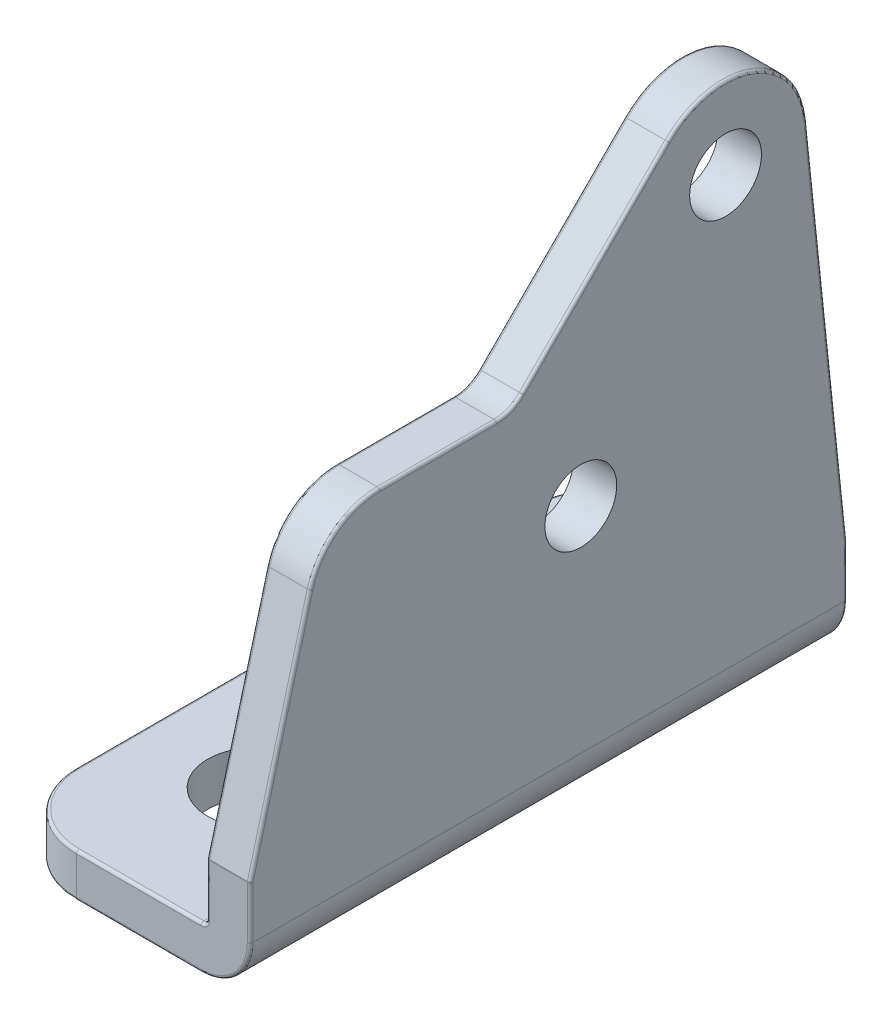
ISO-10303-21;
HEADER;
FILE_DESCRIPTION(('STEP AP214'),'2;1');
FILE_NAME('part.step','',(''),(''),'','','');
FILE_SCHEMA(('AUTOMOTIVE_DESIGN { 1 0 10303 214 1 1 1 1 }'));
ENDSEC;
DATA;
#1=APPLICATION_CONTEXT('core data for automotive mechanical design processes');
#2=APPLICATION_PROTOCOL_DEFINITION('international standard','automotive_design',2000,#1);
#3=PRODUCT_CONTEXT('',#1,'mechanical');
#4=PRODUCT('Part','Part','',(#3));
#5=PRODUCT_RELATED_PRODUCT_CATEGORY('part','',(#4));
#6=PRODUCT_DEFINITION_FORMATION('','',#4);
#7=PRODUCT_DEFINITION_CONTEXT('part definition',#1,'design');
#8=PRODUCT_DEFINITION('design','',#6,#7);
#9=PRODUCT_DEFINITION_SHAPE('','',#8);
#10=(LENGTH_UNIT() NAMED_UNIT(*) SI_UNIT(.MILLI.,.METRE.));
#11=(NAMED_UNIT(*) PLANE_ANGLE_UNIT() SI_UNIT($,.RADIAN.));
#12=(NAMED_UNIT(*) SI_UNIT($,.STERADIAN.) SOLID_ANGLE_UNIT());
#13=UNCERTAINTY_MEASURE_WITH_UNIT(LENGTH_MEASURE(1.E-05),#10,'distance_accuracy_value','');
#14=(GEOMETRIC_REPRESENTATION_CONTEXT(3) GLOBAL_UNCERTAINTY_ASSIGNED_CONTEXT((#13)) GLOBAL_UNIT_ASSIGNED_CONTEXT((#10,
#11,#12)) REPRESENTATION_CONTEXT('',''));
#15=CARTESIAN_POINT('',(0.,0.,0.));
#16=DIRECTION('',(0.,0.,1.));
#17=DIRECTION('',(1.,0.,0.));
#18=AXIS2_PLACEMENT_3D('',#15,#16,#17);
#19=CARTESIAN_POINT('',(-9.52499999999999,-12.573,-22.6187));
#20=DIRECTION('',(0.,1.,0.));
#21=DIRECTION('',(-1.,0.,0.));
#22=AXIS2_PLACEMENT_3D('',#19,#20,#21);
#23=TOROIDAL_SURFACE('',#22,3.048,0.126999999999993);
#24=CARTESIAN_POINT('',(-12.573,-12.573,-22.6187));
#25=DIRECTION('',(0.,0.,-1.));
#26=DIRECTION('',(0.,1.,0.));
#27=AXIS2_PLACEMENT_3D('',#24,#25,#26);
#28=CIRCLE('',#27,0.127);
#29=CARTESIAN_POINT('',(-12.7,-12.573,-22.6187));
#30=VERTEX_POINT('',#29);
#31=CARTESIAN_POINT('',(-12.573,-12.7,-22.6187));
#32=VERTEX_POINT('',#31);
#33=EDGE_CURVE('E215',#30,#32,#28,.F.);
#34=ORIENTED_EDGE('',*,*,#33,.F.);
#35=CARTESIAN_POINT('',(-9.52499999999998,-12.573,-22.6187));
#36=DIRECTION('',(0.,-1.,0.));
#37=DIRECTION('',(1.,0.,0.));
#38=AXIS2_PLACEMENT_3D('',#35,#36,#37);
#39=CIRCLE('',#38,3.175);
#40=CARTESIAN_POINT('',(-9.52499999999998,-12.573,-25.7937));
#41=VERTEX_POINT('',#40);
#42=EDGE_CURVE('E288',#41,#30,#39,.F.);
#43=ORIENTED_EDGE('',*,*,#42,.F.);
#44=CARTESIAN_POINT('',(-9.52499999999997,-12.573,-25.6667));
#45=DIRECTION('',(-1.,0.,0.));
#46=DIRECTION('',(0.,0.,1.));
#47=AXIS2_PLACEMENT_3D('',#44,#45,#46);
#48=CIRCLE('',#47,0.126999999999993);
#49=CARTESIAN_POINT('',(-9.52499999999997,-12.7,-25.6667));
#50=VERTEX_POINT('',#49);
#51=EDGE_CURVE('E221',#41,#50,#48,.T.);
#52=ORIENTED_EDGE('',*,*,#51,.T.);
#53=CARTESIAN_POINT('',(-9.52499999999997,-12.7,-25.6667));
#54=CARTESIAN_POINT('',(-9.55688989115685,-12.6999999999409,-25.6666892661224));
#55=CARTESIAN_POINT('',(-9.58877960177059,-12.699999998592,-25.6661787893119));
#56=CARTESIAN_POINT('',(-9.65252709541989,-12.6999999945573,-25.6641596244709));
#57=CARTESIAN_POINT('',(-9.68438487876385,-12.6999999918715,-25.6626509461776));
#58=CARTESIAN_POINT('',(-9.74803733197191,-12.6999999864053,-25.6586366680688));
#59=CARTESIAN_POINT('',(-9.77983200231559,-12.699999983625,-25.6561310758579));
#60=CARTESIAN_POINT('',(-9.84332711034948,-12.6999999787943,-25.6501254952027));
#61=CARTESIAN_POINT('',(-9.87502754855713,-12.6999999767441,-25.6466255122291));
#62=CARTESIAN_POINT('',(-9.9383031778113,-12.699999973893,-25.6386345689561));
#63=CARTESIAN_POINT('',(-9.96987836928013,-12.6999999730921,-25.634143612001));
#64=CARTESIAN_POINT('',(-10.0328725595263,-12.6999999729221,-25.6241751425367));
#65=CARTESIAN_POINT('',(-10.0642915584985,-12.6999999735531,-25.6186976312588));
#66=CARTESIAN_POINT('',(-10.1269427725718,-12.6999999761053,-25.6067613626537));
#67=CARTESIAN_POINT('',(-10.1581749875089,-12.6999999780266,-25.6003026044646));
#68=CARTESIAN_POINT('',(-10.2204214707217,-12.6999999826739,-25.586410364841));
#69=CARTESIAN_POINT('',(-10.2514357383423,-12.6999999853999,-25.5789768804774));
#70=CARTESIAN_POINT('',(-10.3282203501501,-12.6999999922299,-25.5592965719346));
#71=CARTESIAN_POINT('',(-10.3738420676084,-12.6999999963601,-25.5464653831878));
#72=CARTESIAN_POINT('',(-10.4644409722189,-12.7000000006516,-25.5186944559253));
#73=CARTESIAN_POINT('',(-10.5094181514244,-12.7000000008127,-25.5037546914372));
#74=CARTESIAN_POINT('',(-10.5707031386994,-12.6999999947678,-25.4818013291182));
#75=CARTESIAN_POINT('',(-10.5873343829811,-12.6999999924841,-25.4756797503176));
#76=CARTESIAN_POINT('',(-10.6204877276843,-12.6999999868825,-25.4631470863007));
#77=CARTESIAN_POINT('',(-10.637009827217,-12.6999999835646,-25.4567359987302));
#78=CARTESIAN_POINT('',(-10.6854899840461,-12.6999999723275,-25.4374358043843));
#79=CARTESIAN_POINT('',(-10.7172898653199,-12.6999999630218,-25.4241468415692));
#80=CARTESIAN_POINT('',(-10.7804203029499,-12.6999999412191,-25.3964977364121));
#81=CARTESIAN_POINT('',(-10.8117508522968,-12.699999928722,-25.3821375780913));
#82=CARTESIAN_POINT('',(-10.8739073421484,-12.6999999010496,-25.3523623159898));
#83=CARTESIAN_POINT('',(-10.9047332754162,-12.6999998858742,-25.3369471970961));
#84=CARTESIAN_POINT('',(-10.9658447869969,-12.6999998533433,-25.3050798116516));
#85=CARTESIAN_POINT('',(-10.9961303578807,-12.6999998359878,-25.2886275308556));
#86=CARTESIAN_POINT('',(-11.0561262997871,-12.6999997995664,-25.2547047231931));
#87=CARTESIAN_POINT('',(-11.0858366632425,-12.6999997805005,-25.2372341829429));
#88=CARTESIAN_POINT('',(-11.1446479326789,-12.6999997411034,-25.2012949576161));
#89=CARTESIAN_POINT('',(-11.173748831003,-12.6999997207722,-25.1828262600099));
#90=CARTESIAN_POINT('',(-11.2313076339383,-12.6999996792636,-25.1449119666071));
#91=CARTESIAN_POINT('',(-11.259765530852,-12.6999996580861,-25.1254663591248));
#92=CARTESIAN_POINT('',(-11.3160055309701,-12.6999996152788,-25.0856206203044));
#93=CARTESIAN_POINT('',(-11.3437876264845,-12.6999995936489,-25.0652204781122));
#94=CARTESIAN_POINT('',(-11.3986439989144,-12.6999995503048,-25.023489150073));
#95=CARTESIAN_POINT('',(-11.4257182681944,-12.6999995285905,-25.002157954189));
#96=CARTESIAN_POINT('',(-11.4791277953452,-12.69999948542,-24.9585890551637));
#97=CARTESIAN_POINT('',(-11.5054630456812,-12.6999994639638,-24.9363513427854));
#98=CARTESIAN_POINT('',(-11.5573641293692,-12.6999994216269,-24.8909950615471));
#99=CARTESIAN_POINT('',(-11.5829299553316,-12.6999994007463,-24.867876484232));
#100=CARTESIAN_POINT('',(-11.6332629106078,-12.6999993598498,-24.8207848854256));
#101=CARTESIAN_POINT('',(-11.6580300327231,-12.6999993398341,-24.7968118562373));
#102=CARTESIAN_POINT('',(-11.7032575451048,-12.6999993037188,-24.751523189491));
#103=CARTESIAN_POINT('',(-11.72382778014,-12.6999992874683,-24.7303170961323));
#104=CARTESIAN_POINT('',(-11.7643430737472,-12.6999992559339,-24.6873154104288));
#105=CARTESIAN_POINT('',(-11.784288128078,-12.69999924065,-24.6655198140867));
#106=CARTESIAN_POINT('',(-11.8235360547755,-12.6999992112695,-24.6213576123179));
#107=CARTESIAN_POINT('',(-11.8428389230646,-12.6999991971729,-24.598991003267));
#108=CARTESIAN_POINT('',(-11.8807860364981,-12.6999991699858,-24.5537059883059));
#109=CARTESIAN_POINT('',(-11.8994302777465,-12.6999991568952,-24.530787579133));
#110=CARTESIAN_POINT('',(-11.9411171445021,-12.6999991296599,-24.4779933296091));
#111=CARTESIAN_POINT('',(-11.9639471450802,-12.699999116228,-24.4479491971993));
#112=CARTESIAN_POINT('',(-12.0084746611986,-12.6999990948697,-24.3870337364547));
#113=CARTESIAN_POINT('',(-12.0301721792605,-12.6999990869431,-24.356162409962));
#114=CARTESIAN_POINT('',(-12.0724051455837,-12.6999990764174,-24.2936349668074));
#115=CARTESIAN_POINT('',(-12.0929405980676,-12.6999990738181,-24.261978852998));
#116=CARTESIAN_POINT('',(-12.132821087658,-12.699999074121,-24.1979254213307));
#117=CARTESIAN_POINT('',(-12.1521661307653,-12.6999990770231,-24.1655281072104));
#118=CARTESIAN_POINT('',(-12.1872967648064,-12.6999990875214,-24.1041308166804));
#119=CARTESIAN_POINT('',(-12.2032250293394,-12.6999990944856,-24.0752123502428));
#120=CARTESIAN_POINT('',(-12.2341328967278,-12.6999991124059,-24.0168728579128));
#121=CARTESIAN_POINT('',(-12.2491125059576,-12.699999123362,-23.9874518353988));
#122=CARTESIAN_POINT('',(-12.2781070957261,-12.6999991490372,-23.9281385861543));
#123=CARTESIAN_POINT('',(-12.2921220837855,-12.6999991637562,-23.8982463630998));
#124=CARTESIAN_POINT('',(-12.3191726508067,-12.6999991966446,-23.8380223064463));
#125=CARTESIAN_POINT('',(-12.3322082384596,-12.699999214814,-23.8076904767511));
#126=CARTESIAN_POINT('',(-12.3572862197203,-12.699999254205,-23.7466193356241));
#127=CARTESIAN_POINT('',(-12.3693286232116,-12.6999992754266,-23.7158800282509));
#128=CARTESIAN_POINT('',(-12.3924075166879,-12.6999993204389,-23.6540264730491));
#129=CARTESIAN_POINT('',(-12.4034440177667,-12.6999993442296,-23.6229122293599));
#130=CARTESIAN_POINT('',(-12.4244994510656,-12.6999993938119,-23.5603417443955));
#131=CARTESIAN_POINT('',(-12.4345183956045,-12.6999994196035,-23.5288855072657));
#132=CARTESIAN_POINT('',(-12.4535281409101,-12.6999994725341,-23.4656643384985));
#133=CARTESIAN_POINT('',(-12.4625189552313,-12.6999994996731,-23.4338994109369));
#134=CARTESIAN_POINT('',(-12.4794629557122,-12.6999995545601,-23.3700944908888));
#135=CARTESIAN_POINT('',(-12.4874161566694,-12.6999995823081,-23.3380545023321));
#136=CARTESIAN_POINT('',(-12.5022765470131,-12.6999996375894,-23.2737333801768));
#137=CARTESIAN_POINT('',(-12.5091837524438,-12.6999996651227,-23.241452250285));
#138=CARTESIAN_POINT('',(-12.521944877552,-12.6999997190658,-23.1766830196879));
#139=CARTESIAN_POINT('',(-12.5277988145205,-12.6999997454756,-23.1441949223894));
#140=CARTESIAN_POINT('',(-12.5384472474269,-12.6999997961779,-23.0790461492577));
#141=CARTESIAN_POINT('',(-12.5432417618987,-12.6999998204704,-23.0463854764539));
#142=CARTESIAN_POINT('',(-12.5517663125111,-12.6999998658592,-22.9809261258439));
#143=CARTESIAN_POINT('',(-12.5554963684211,-12.6999998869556,-22.9481274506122));
#144=CARTESIAN_POINT('',(-12.5618881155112,-12.6999999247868,-22.8824268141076));
#145=CARTESIAN_POINT('',(-12.5645498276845,-12.6999999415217,-22.849524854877));
#146=CARTESIAN_POINT('',(-12.568802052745,-12.6999999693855,-22.7836524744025));
#147=CARTESIAN_POINT('',(-12.5703925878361,-12.6999999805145,-22.7506820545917));
#148=CARTESIAN_POINT('',(-12.572501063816,-12.699999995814,-22.6847076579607));
#149=CARTESIAN_POINT('',(-12.5730190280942,-12.6999999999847,-22.651703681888));
#150=CARTESIAN_POINT('',(-12.573,-12.7,-22.6187));
#151=B_SPLINE_CURVE_WITH_KNOTS('',3,(#53,#54,#55,#56,#57,#58,#59,#60,#61,#62,#63,#64,#65,#66,
#67,#68,#69,#70,#71,#72,#73,#74,#75,#76,#77,#78,#79,#80,#81,#82,#83,#84,#85,#86,#87,#88,#89,#90,
#91,#92,#93,#94,#95,#96,#97,#98,#99,#100,#101,#102,#103,#104,#105,#106,#107,#108,#109,#110,#111,
#112,#113,#114,#115,#116,#117,#118,#119,#120,#121,#122,#123,#124,#125,#126,#127,#128,#129,#130,
#131,#132,#133,#134,#135,#136,#137,#138,#139,#140,#141,#142,#143,#144,#145,#146,#147,#148,#149,
#150),.UNSPECIFIED.,.F.,.F.,(4,2,2,2,2,2,2,2,2,2,2,2,2,2,2,2,2,2,2,2,2,2,2,2,2,2,2,2,2,2,2,2,2,
2,2,2,2,2,2,2,2,2,2,2,2,2,2,2,4),(0.,0.0956657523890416,0.191330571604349,0.286994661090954,
0.382658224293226,0.478321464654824,0.573984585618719,0.66964779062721,0.765311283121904,
0.907433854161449,1.04955817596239,1.10272237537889,1.1558870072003,1.25926023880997,
1.36263501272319,1.46601126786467,1.56938894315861,1.67276797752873,1.77614830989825,
1.87952987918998,1.98291262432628,2.08629648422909,2.18968139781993,2.29306730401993,
2.39645414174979,2.48507325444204,2.5736929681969,2.66231324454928,2.75093404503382,
2.86410913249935,2.97728396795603,3.09045839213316,3.2036322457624,3.30266011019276,
3.40168730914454,3.50071373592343,3.59973928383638,3.69876384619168,3.79778731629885,
3.89680958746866,3.99583055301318,4.09485010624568,4.1938681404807,4.29288454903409,
4.39189922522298,4.49091206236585,4.58992295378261,4.68893179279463,4.78793847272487),.UNSPECIFIED.);
#152=EDGE_CURVE('E295',#50,#32,#151,.T.);
#153=ORIENTED_EDGE('',*,*,#152,.T.);
#154=EDGE_LOOP('',(#34,#43,#52,#153));
#155=FACE_BOUND('',#154,.T.);
#156=ADVANCED_FACE('F17',(#155),#23,.T.);
#157=CARTESIAN_POINT('',(-12.573,-12.573,-12.7));
#158=DIRECTION('',(0.,0.,-1.));
#159=DIRECTION('',(0.,1.,0.));
#160=AXIS2_PLACEMENT_3D('',#157,#158,#159);
#161=CYLINDRICAL_SURFACE('',#160,0.127);
#162=CARTESIAN_POINT('',(-12.573,-12.573,-2.78129999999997));
#163=DIRECTION('',(0.,0.,1.));
#164=DIRECTION('',(0.,-1.,0.));
#165=AXIS2_PLACEMENT_3D('',#162,#163,#164);
#166=CIRCLE('',#165,0.127);
#167=CARTESIAN_POINT('',(-12.7,-12.573,-2.78129999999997));
#168=VERTEX_POINT('',#167);
#169=CARTESIAN_POINT('',(-12.573,-12.7,-2.78129999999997));
#170=VERTEX_POINT('',#169);
#171=EDGE_CURVE('E259',#168,#170,#166,.T.);
#172=ORIENTED_EDGE('',*,*,#171,.F.);
#173=DIRECTION('',(0.,0.,1.));
#174=VECTOR('',#173,1.);
#175=CARTESIAN_POINT('',(-12.7,-12.573,-12.7));
#176=LINE('',#175,#174);
#177=EDGE_CURVE('E285',#168,#30,#176,.F.);
#178=ORIENTED_EDGE('',*,*,#177,.T.);
#179=ORIENTED_EDGE('',*,*,#33,.T.);
#180=DIRECTION('',(0.,0.,1.));
#181=VECTOR('',#180,1.);
#182=CARTESIAN_POINT('',(-12.573,-12.7,-12.7));
#183=LINE('',#182,#181);
#184=EDGE_CURVE('E299',#32,#170,#183,.T.);
#185=ORIENTED_EDGE('',*,*,#184,.T.);
#186=EDGE_LOOP('',(#172,#178,#179,#185));
#187=FACE_BOUND('',#186,.T.);
#188=ADVANCED_FACE('F312',(#187),#161,.T.);
#189=CARTESIAN_POINT('',(-9.52499999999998,-12.573,-2.78129999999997));
#190=DIRECTION('',(0.,1.,0.));
#191=DIRECTION('',(-1.,0.,0.));
#192=AXIS2_PLACEMENT_3D('',#189,#190,#191);
#193=TOROIDAL_SURFACE('',#192,3.048,0.127);
#194=CARTESIAN_POINT('',(-9.52499999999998,-12.573,0.266700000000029));
#195=DIRECTION('',(-1.,0.,0.));
#196=DIRECTION('',(0.,0.,1.));
#197=AXIS2_PLACEMENT_3D('',#194,#195,#196);
#198=CIRCLE('',#197,0.127);
#199=CARTESIAN_POINT('',(-9.52499999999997,-12.7,0.266700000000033));
#200=VERTEX_POINT('',#199);
#201=CARTESIAN_POINT('',(-9.52499999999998,-12.573,0.39370000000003));
#202=VERTEX_POINT('',#201);
#203=EDGE_CURVE('E258',#200,#202,#198,.T.);
#204=ORIENTED_EDGE('',*,*,#203,.T.);
#205=CARTESIAN_POINT('',(-9.52499999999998,-12.573,-2.78129999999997));
#206=DIRECTION('',(0.,-1.,0.));
#207=DIRECTION('',(1.,0.,0.));
#208=AXIS2_PLACEMENT_3D('',#205,#206,#207);
#209=CIRCLE('',#208,3.175);
#210=EDGE_CURVE('E278',#168,#202,#209,.F.);
#211=ORIENTED_EDGE('',*,*,#210,.F.);
#212=ORIENTED_EDGE('',*,*,#171,.T.);
#213=CARTESIAN_POINT('',(-12.573,-12.7,-2.78129999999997));
#214=CARTESIAN_POINT('',(-12.5729892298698,-12.6999999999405,-2.74941010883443));
#215=CARTESIAN_POINT('',(-12.5724787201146,-12.6999999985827,-2.71752039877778));
#216=CARTESIAN_POINT('',(-12.5704594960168,-12.6999999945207,-2.65377290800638));
#217=CARTESIAN_POINT('',(-12.568950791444,-12.6999999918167,-2.62191512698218));
#218=CARTESIAN_POINT('',(-12.5649364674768,-12.6999999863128,-2.5582626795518));
#219=CARTESIAN_POINT('',(-12.5624308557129,-12.699999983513,-2.52646801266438));
#220=CARTESIAN_POINT('',(-12.5564252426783,-12.6999999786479,-2.46297291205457));
#221=CARTESIAN_POINT('',(-12.5529252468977,-12.6999999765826,-2.43127247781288));
#222=CARTESIAN_POINT('',(-12.5449342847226,-12.6999999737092,-2.36799685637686));
#223=CARTESIAN_POINT('',(-12.5404433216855,-12.6999999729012,-2.33642166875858));
#224=CARTESIAN_POINT('',(-12.5304748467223,-12.6999999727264,-2.27342748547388));
#225=CARTESIAN_POINT('',(-12.5249973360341,-12.6999999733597,-2.24200848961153));
#226=CARTESIAN_POINT('',(-12.5130610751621,-12.6999999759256,-2.17935728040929));
#227=CARTESIAN_POINT('',(-12.5066023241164,-12.6999999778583,-2.14812506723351));
#228=CARTESIAN_POINT('',(-12.492710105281,-12.6999999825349,-2.08587858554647));
#229=CARTESIAN_POINT('',(-12.4852766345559,-12.6999999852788,-2.05486431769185));
#230=CARTESIAN_POINT('',(-12.4655963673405,-12.6999999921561,-1.97807970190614));
#231=CARTESIAN_POINT('',(-12.4527652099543,-12.6999999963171,-1.93245797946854));
#232=CARTESIAN_POINT('',(-12.4249943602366,-12.7000000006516,-1.84185905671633));
#233=CARTESIAN_POINT('',(-12.4100546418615,-12.7000000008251,-1.79688186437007));
#234=CARTESIAN_POINT('',(-12.3881013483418,-12.6999999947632,-1.73559685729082));
#235=CARTESIAN_POINT('',(-12.3819797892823,-12.6999999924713,-1.71896560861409));
#236=CARTESIAN_POINT('',(-12.3694471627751,-12.699999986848,-1.68581225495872));
#237=CARTESIAN_POINT('',(-12.3630360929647,-12.6999999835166,-1.66929015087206));
#238=CARTESIAN_POINT('',(-12.3437359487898,-12.6999999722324,-1.62080997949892));
#239=CARTESIAN_POINT('',(-12.33044701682,-12.6999999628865,-1.58901008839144));
#240=CARTESIAN_POINT('',(-12.3027979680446,-12.6999999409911,-1.52587963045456));
#241=CARTESIAN_POINT('',(-12.2884378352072,-12.6999999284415,-1.49454907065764));
#242=CARTESIAN_POINT('',(-12.2586626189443,-12.699999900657,-1.43239255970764));
#243=CARTESIAN_POINT('',(-12.2432475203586,-12.6999998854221,-1.40156661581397));
#244=CARTESIAN_POINT('',(-12.2113801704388,-12.6999998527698,-1.34045508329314));
#245=CARTESIAN_POINT('',(-12.1949279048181,-12.6999998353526,-1.3101695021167));
#246=CARTESIAN_POINT('',(-12.1610051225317,-12.69999979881,-1.25017354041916));
#247=CARTESIAN_POINT('',(-12.1435345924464,-12.6999997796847,-1.22046316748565));
#248=CARTESIAN_POINT('',(-12.1075953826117,-12.6999997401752,-1.16165188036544));
#249=CARTESIAN_POINT('',(-12.0891266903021,-12.6999997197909,-1.13255097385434));
#250=CARTESIAN_POINT('',(-12.051212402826,-12.6999996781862,-1.07499215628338));
#251=CARTESIAN_POINT('',(-12.0317667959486,-12.6999996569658,-1.04653425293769));
#252=CARTESIAN_POINT('',(-11.9919210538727,-12.6999996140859,-0.990294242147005));
#253=CARTESIAN_POINT('',(-11.9715209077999,-12.6999995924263,-0.96251214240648));
#254=CARTESIAN_POINT('',(-11.9297895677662,-12.699999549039,-0.907655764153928));
#255=CARTESIAN_POINT('',(-11.9084583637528,-12.6999995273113,-0.880581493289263));
#256=CARTESIAN_POINT('',(-11.8648894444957,-12.6999994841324,-0.827171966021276));
#257=CARTESIAN_POINT('',(-11.8426517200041,-12.6999994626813,-0.800836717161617));
#258=CARTESIAN_POINT('',(-11.7972954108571,-12.6999994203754,-0.748935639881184));
#259=CARTESIAN_POINT('',(-11.7741768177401,-12.6999993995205,-0.723369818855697));
#260=CARTESIAN_POINT('',(-11.7270851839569,-12.699999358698,-0.673036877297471));
#261=CARTESIAN_POINT('',(-11.7031121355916,-12.6999993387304,-0.648269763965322));
#262=CARTESIAN_POINT('',(-11.6578234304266,-12.6999993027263,-0.603042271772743));
#263=CARTESIAN_POINT('',(-11.6366173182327,-12.6999992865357,-0.582472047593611));
#264=CARTESIAN_POINT('',(-11.5936155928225,-12.6999992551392,-0.54195677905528));
#265=CARTESIAN_POINT('',(-11.571819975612,-12.6999992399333,-0.522011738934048));
#266=CARTESIAN_POINT('',(-11.5276577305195,-12.6999992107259,-0.482763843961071));
#267=CARTESIAN_POINT('',(-11.5052910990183,-12.6999991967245,-0.463460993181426));
#268=CARTESIAN_POINT('',(-11.4600060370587,-12.6999991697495,-0.425513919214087));
#269=CARTESIAN_POINT('',(-11.4370876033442,-12.6999991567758,-0.406869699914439));
#270=CARTESIAN_POINT('',(-11.3842933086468,-12.6999991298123,-0.365182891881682));
#271=CARTESIAN_POINT('',(-11.3542491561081,-12.6999991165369,-0.342352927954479));
#272=CARTESIAN_POINT('',(-11.2933336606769,-12.6999990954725,-0.297825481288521));
#273=CARTESIAN_POINT('',(-11.2624623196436,-12.6999990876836,-0.276127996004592));
#274=CARTESIAN_POINT('',(-11.1999348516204,-12.6999990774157,-0.233895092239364));
#275=CARTESIAN_POINT('',(-11.1682787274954,-12.6999990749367,-0.213359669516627));
#276=CARTESIAN_POINT('',(-11.1042252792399,-12.6999990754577,-0.173479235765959));
#277=CARTESIAN_POINT('',(-11.0718279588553,-12.6999990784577,-0.154134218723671));
#278=CARTESIAN_POINT('',(-11.0104306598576,-12.699999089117,-0.119003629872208));
#279=CARTESIAN_POINT('',(-10.9815121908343,-12.6999990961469,-0.103075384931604));
#280=CARTESIAN_POINT('',(-10.923172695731,-12.6999991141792,-0.0721675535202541));
#281=CARTESIAN_POINT('',(-10.8937516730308,-12.6999991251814,-0.0571879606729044));
#282=CARTESIAN_POINT('',(-10.8344384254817,-12.6999991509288,-0.0281934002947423));
#283=CARTESIAN_POINT('',(-10.8045462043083,-12.6999991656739,-0.0141784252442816));
#284=CARTESIAN_POINT('',(-10.7443221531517,-12.6999991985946,0.0128721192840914));
#285=CARTESIAN_POINT('',(-10.7139903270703,-12.6999992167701,0.0259076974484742));
#286=CARTESIAN_POINT('',(-10.6529191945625,-12.6999992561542,0.0509856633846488));
#287=CARTESIAN_POINT('',(-10.6221798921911,-12.6999992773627,0.0630280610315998));
#288=CARTESIAN_POINT('',(-10.5603263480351,-12.6999993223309,0.0861069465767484));
#289=CARTESIAN_POINT('',(-10.5292121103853,-12.6999993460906,0.0971434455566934));
#290=CARTESIAN_POINT('',(-10.4666416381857,-12.6999993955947,0.118198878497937));
#291=CARTESIAN_POINT('',(-10.4351854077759,-12.6999994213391,0.128217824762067));
#292=CARTESIAN_POINT('',(-10.3719642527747,-12.6999994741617,0.147227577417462));
#293=CARTESIAN_POINT('',(-10.340199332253,-12.6999995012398,0.156218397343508));
#294=CARTESIAN_POINT('',(-10.2763944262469,-12.6999995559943,0.173162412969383));
#295=CARTESIAN_POINT('',(-10.2443544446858,-12.6999995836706,0.181115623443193));
#296=CARTESIAN_POINT('',(-10.1800333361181,-12.6999996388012,0.195976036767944));
#297=CARTESIAN_POINT('',(-10.1477522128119,-12.6999996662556,0.202883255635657));
#298=CARTESIAN_POINT('',(-10.0829829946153,-12.6999997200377,0.215644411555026));
#299=CARTESIAN_POINT('',(-10.0504949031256,-12.6999997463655,0.221498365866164));
#300=CARTESIAN_POINT('',(-9.98534614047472,-12.6999997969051,0.232146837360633));
#301=CARTESIAN_POINT('',(-9.95268547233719,-12.699999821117,0.236941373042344));
#302=CARTESIAN_POINT('',(-9.88722612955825,-12.6999998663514,0.245465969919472));
#303=CARTESIAN_POINT('',(-9.8544274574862,-12.699999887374,0.24919605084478));
#304=CARTESIAN_POINT('',(-9.78872682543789,-12.69999992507,0.25558785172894));
#305=CARTESIAN_POINT('',(-9.75582486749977,-12.6999999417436,0.258249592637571));
#306=CARTESIAN_POINT('',(-9.68995248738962,-12.6999999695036,0.262501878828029));
#307=CARTESIAN_POINT('',(-9.65698206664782,-12.6999999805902,0.264092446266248));
#308=CARTESIAN_POINT('',(-9.59100766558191,-12.6999999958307,0.266200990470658));
#309=CARTESIAN_POINT('',(-9.55800368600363,-12.6999999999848,0.266718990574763));
#310=CARTESIAN_POINT('',(-9.52499999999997,-12.7,0.266700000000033));
#311=B_SPLINE_CURVE_WITH_KNOTS('',3,(#213,#214,#215,#216,#217,#218,#219,#220,#221,#222,#223,
#224,#225,#226,#227,#228,#229,#230,#231,#232,#233,#234,#235,#236,#237,#238,#239,#240,#241,#242,
#243,#244,#245,#246,#247,#248,#249,#250,#251,#252,#253,#254,#255,#256,#257,#258,#259,#260,#261,
#262,#263,#264,#265,#266,#267,#268,#269,#270,#271,#272,#273,#274,#275,#276,#277,#278,#279,#280,
#281,#282,#283,#284,#285,#286,#287,#288,#289,#290,#291,#292,#293,#294,#295,#296,#297,#298,#299,
#300,#301,#302,#303,#304,#305,#306,#307,#308,#309,#310),.UNSPECIFIED.,.F.,.F.,(4,2,2,2,2,2,2,2,
2,2,2,2,2,2,2,2,2,2,2,2,2,2,2,2,2,2,2,2,2,2,2,2,2,2,2,2,2,2,2,2,2,2,2,2,2,2,2,2,4),(0.,
0.095665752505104,0.19133056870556,0.286994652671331,0.382658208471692,0.478321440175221,
0.573984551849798,0.669647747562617,0.765311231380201,0.90743379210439,1.04955810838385,
1.10272229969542,1.15588692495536,1.25926014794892,1.3626349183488,1.46601117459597,
1.56938885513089,1.67276789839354,1.77614824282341,1.87952982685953,1.98291258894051,
2.08629646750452,2.1896814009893,2.2930673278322,2.39645418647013,2.48507331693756,
2.57369304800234,2.6623133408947,2.75093415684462,2.86410922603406,2.97728404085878,
3.09045844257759,3.20363227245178,3.30266011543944,3.40168729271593,3.50071369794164,
3.59973922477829,3.69876376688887,3.79778721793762,3.89680947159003,3.99583042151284,
4.09484996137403,4.19386798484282,4.29288438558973,4.39189905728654,4.49091189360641,
4.58992278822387,4.68893163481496,4.78793832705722),.UNSPECIFIED.);
#312=EDGE_CURVE('E300',#170,#200,#311,.T.);
#313=ORIENTED_EDGE('',*,*,#312,.T.);
#314=EDGE_LOOP('',(#204,#211,#212,#313));
#315=FACE_BOUND('',#314,.T.);
#316=ADVANCED_FACE('F314',(#315),#193,.T.);
#317=CARTESIAN_POINT('',(-2.03199999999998,-8.23883771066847,-25.6667));
#318=DIRECTION('',(0.0697599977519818,0.771707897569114,0.632139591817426));
#319=DIRECTION('',(0.997522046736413,-0.0597615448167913,-0.0371257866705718));
#320=AXIS2_PLACEMENT_3D('',#317,#318,#319);
#321=SPHERICAL_SURFACE('',#320,0.126999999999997);
#322=CARTESIAN_POINT('',(-2.03199999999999,-8.23883771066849,-25.6667));
#323=DIRECTION('',(0.,-0.994521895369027,-0.104528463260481));
#324=DIRECTION('',(0.,0.104528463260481,-0.994521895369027));
#325=AXIS2_PLACEMENT_3D('',#322,#323,#324);
#326=CIRCLE('',#325,0.127000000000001);
#327=CARTESIAN_POINT('',(-2.03199999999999,-8.22556259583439,-25.7930042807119));
#328=VERTEX_POINT('',#327);
#329=CARTESIAN_POINT('',(-1.90499999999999,-8.23883771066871,-25.6667000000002));
#330=VERTEX_POINT('',#329);
#331=EDGE_CURVE('E21',#328,#330,#326,.T.);
#332=ORIENTED_EDGE('',*,*,#331,.T.);
#333=CARTESIAN_POINT('',(-2.03199999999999,-8.23883771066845,-25.6667));
#334=DIRECTION('',(0.,-1.,0.));
#335=DIRECTION('',(1.,0.,0.));
#336=AXIS2_PLACEMENT_3D('',#333,#334,#335);
#337=CIRCLE('',#336,0.127);
#338=CARTESIAN_POINT('',(-2.03199999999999,-8.23883771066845,-25.7937));
#339=VERTEX_POINT('',#338);
#340=EDGE_CURVE('E227',#330,#339,#337,.F.);
#341=ORIENTED_EDGE('',*,*,#340,.T.);
#342=CARTESIAN_POINT('',(-2.03199999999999,-8.23883771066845,-25.6667));
#343=DIRECTION('',(-1.,0.,0.));
#344=DIRECTION('',(0.,-1.,0.));
#345=AXIS2_PLACEMENT_3D('',#342,#343,#344);
#346=CIRCLE('',#345,0.127);
#347=EDGE_CURVE('E256',#328,#339,#346,.T.);
#348=ORIENTED_EDGE('',*,*,#347,.F.);
#349=EDGE_LOOP('',(#332,#341,#348));
#350=FACE_BOUND('',#349,.T.);
#351=ADVANCED_FACE('F255',(#350),#321,.T.);
#352=CARTESIAN_POINT('',(-9.52499999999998,-11.7475,-22.6187));
#353=DIRECTION('',(0.,-1.,0.));
#354=DIRECTION('',(1.,0.,0.));
#355=AXIS2_PLACEMENT_3D('',#352,#353,#354);
#356=CYLINDRICAL_SURFACE('',#355,3.175);
#357=ORIENTED_EDGE('',*,*,#42,.T.);
#358=DIRECTION('',(0.,1.,0.));
#359=VECTOR('',#358,1.);
#360=CARTESIAN_POINT('',(-12.7,-11.7475,-22.6187));
#361=LINE('',#360,#359);
#362=CARTESIAN_POINT('',(-12.7,-10.922,-22.6187));
#363=VERTEX_POINT('',#362);
#364=EDGE_CURVE('E287',#30,#363,#361,.T.);
#365=ORIENTED_EDGE('',*,*,#364,.T.);
#366=CARTESIAN_POINT('',(-9.52499999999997,-10.922,-22.6187));
#367=DIRECTION('',(0.,1.,0.));
#368=DIRECTION('',(-1.,0.,0.));
#369=AXIS2_PLACEMENT_3D('',#366,#367,#368);
#370=CIRCLE('',#369,3.17500000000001);
#371=CARTESIAN_POINT('',(-9.52499999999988,-10.922,-25.7937));
#372=VERTEX_POINT('',#371);
#373=EDGE_CURVE('E539',#372,#363,#370,.T.);
#374=ORIENTED_EDGE('',*,*,#373,.F.);
#375=DIRECTION('',(0.,-1.,0.));
#376=VECTOR('',#375,1.);
#377=CARTESIAN_POINT('',(-9.52499999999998,-11.7475,-25.7937));
#378=LINE('',#377,#376);
#379=EDGE_CURVE('E237',#372,#41,#378,.T.);
#380=ORIENTED_EDGE('',*,*,#379,.T.);
#381=EDGE_LOOP('',(#357,#365,#374,#380));
#382=FACE_BOUND('',#381,.T.);
#383=ADVANCED_FACE('F320',(#382),#356,.T.);
#384=CARTESIAN_POINT('',(-12.7,-11.7475,-12.7));
#385=DIRECTION('',(1.,0.,0.));
#386=DIRECTION('',(0.,1.,0.));
#387=AXIS2_PLACEMENT_3D('',#384,#385,#386);
#388=PLANE('',#387);
#389=DIRECTION('',(0.,0.,1.));
#390=VECTOR('',#389,1.);
#391=CARTESIAN_POINT('',(-12.7,-10.922,-12.7));
#392=LINE('',#391,#390);
#393=CARTESIAN_POINT('',(-12.7,-10.922,-2.78129999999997));
#394=VERTEX_POINT('',#393);
#395=EDGE_CURVE('E530',#363,#394,#392,.T.);
#396=ORIENTED_EDGE('',*,*,#395,.F.);
#397=ORIENTED_EDGE('',*,*,#364,.F.);
#398=ORIENTED_EDGE('',*,*,#177,.F.);
#399=DIRECTION('',(0.,-1.,0.));
#400=VECTOR('',#399,1.);
#401=CARTESIAN_POINT('',(-12.7,-11.7475,-2.78129999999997));
#402=LINE('',#401,#400);
#403=EDGE_CURVE('E282',#394,#168,#402,.T.);
#404=ORIENTED_EDGE('',*,*,#403,.F.);
#405=EDGE_LOOP('',(#396,#397,#398,#404));
#406=FACE_BOUND('',#405,.T.);
#407=ADVANCED_FACE('F1002',(#406),#388,.F.);
#408=CARTESIAN_POINT('',(-9.52499999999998,-11.7475,-2.78129999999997));
#409=DIRECTION('',(0.,-1.,0.));
#410=DIRECTION('',(1.,0.,0.));
#411=AXIS2_PLACEMENT_3D('',#408,#409,#410);
#412=CYLINDRICAL_SURFACE('',#411,3.175);
#413=ORIENTED_EDGE('',*,*,#210,.T.);
#414=DIRECTION('',(0.,-1.,0.));
#415=VECTOR('',#414,1.);
#416=CARTESIAN_POINT('',(-9.52499999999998,-11.7475,0.393700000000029));
#417=LINE('',#416,#415);
#418=CARTESIAN_POINT('',(-9.52499999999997,-10.922,0.39370000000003));
#419=VERTEX_POINT('',#418);
#420=EDGE_CURVE('E281',#202,#419,#417,.F.);
#421=ORIENTED_EDGE('',*,*,#420,.T.);
#422=CARTESIAN_POINT('',(-9.52499999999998,-10.922,-2.78129999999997));
#423=DIRECTION('',(0.,1.,0.));
#424=DIRECTION('',(-1.,0.,0.));
#425=AXIS2_PLACEMENT_3D('',#422,#423,#424);
#426=CIRCLE('',#425,3.175);
#427=EDGE_CURVE('E492',#394,#419,#426,.T.);
#428=ORIENTED_EDGE('',*,*,#427,.F.);
#429=ORIENTED_EDGE('',*,*,#403,.T.);
#430=EDGE_LOOP('',(#413,#421,#428,#429));
#431=FACE_BOUND('',#430,.T.);
#432=ADVANCED_FACE('F325',(#431),#412,.T.);
#433=CARTESIAN_POINT('',(-2.03199999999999,-8.24631986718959,0.266700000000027));
#434=DIRECTION('',(0.0697599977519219,0.771707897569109,0.632139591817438));
#435=DIRECTION('',(-0.106400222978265,-0.624312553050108,0.773894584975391));
#436=AXIS2_PLACEMENT_3D('',#433,#434,#435);
#437=SPHERICAL_SURFACE('',#436,0.126999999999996);
#438=CARTESIAN_POINT('',(-2.03199999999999,-8.24631986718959,0.266700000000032));
#439=DIRECTION('',(0.,-1.,0.));
#440=DIRECTION('',(1.,0.,0.));
#441=AXIS2_PLACEMENT_3D('',#438,#439,#440);
#442=CIRCLE('',#441,0.127);
#443=CARTESIAN_POINT('',(-1.90499999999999,-8.24631986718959,0.266700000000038));
#444=VERTEX_POINT('',#443);
#445=CARTESIAN_POINT('',(-2.03199999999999,-8.24631986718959,0.393700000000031));
#446=VERTEX_POINT('',#445);
#447=EDGE_CURVE('E477',#444,#446,#442,.T.);
#448=ORIENTED_EDGE('',*,*,#447,.F.);
#449=CARTESIAN_POINT('',(-2.03199999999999,-8.2463198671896,0.266700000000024));
#450=DIRECTION('',(0.,0.965925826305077,-0.258819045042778));
#451=DIRECTION('',(0.,0.258819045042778,0.965925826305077));
#452=AXIS2_PLACEMENT_3D('',#449,#450,#451);
#453=CIRCLE('',#452,0.127);
#454=CARTESIAN_POINT('',(-2.03199999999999,-8.21344984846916,0.389372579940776));
#455=VERTEX_POINT('',#454);
#456=EDGE_CURVE('E473',#455,#444,#453,.T.);
#457=ORIENTED_EDGE('',*,*,#456,.F.);
#458=CARTESIAN_POINT('',(-2.03199999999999,-8.24631986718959,0.266700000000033));
#459=DIRECTION('',(1.,0.,0.));
#460=DIRECTION('',(0.,1.,0.));
#461=AXIS2_PLACEMENT_3D('',#458,#459,#460);
#462=CIRCLE('',#461,0.127);
#463=EDGE_CURVE('E481',#446,#455,#462,.F.);
#464=ORIENTED_EDGE('',*,*,#463,.F.);
#465=EDGE_LOOP('',(#448,#457,#464));
#466=FACE_BOUND('',#465,.T.);
#467=ADVANCED_FACE('F321',(#466),#437,.T.);
#468=CARTESIAN_POINT('',(5.62269340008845,-12.7,-12.7));
#469=DIRECTION('',(0.,1.,0.));
#470=DIRECTION('',(0.,0.,1.));
#471=AXIS2_PLACEMENT_3D('',#468,#469,#470);
#472=PLANE('',#471);
#473=CARTESIAN_POINT('',(-7.95019999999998,-12.7,-19.4437));
#474=DIRECTION('',(0.,1.,0.));
#475=DIRECTION('',(-1.,0.,0.));
#476=AXIS2_PLACEMENT_3D('',#473,#474,#475);
#477=CIRCLE('',#476,2.1717);
#478=CARTESIAN_POINT('',(-10.1219,-12.7,-19.4437));
#479=VERTEX_POINT('',#478);
#480=EDGE_CURVE('E485',#479,#479,#477,.T.);
#481=ORIENTED_EDGE('',*,*,#480,.T.);
#482=EDGE_LOOP('',(#481));
#483=FACE_BOUND('',#482,.T.);
#484=CARTESIAN_POINT('',(-7.95019999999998,-12.7,-5.95629999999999));
#485=DIRECTION('',(0.,1.,0.));
#486=DIRECTION('',(-1.,0.,0.));
#487=AXIS2_PLACEMENT_3D('',#484,#485,#486);
#488=CIRCLE('',#487,2.1717);
#489=CARTESIAN_POINT('',(-10.1219,-12.7,-5.95629999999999));
#490=VERTEX_POINT('',#489);
#491=EDGE_CURVE('E489',#490,#490,#488,.T.);
#492=ORIENTED_EDGE('',*,*,#491,.T.);
#493=EDGE_LOOP('',(#492));
#494=FACE_BOUND('',#493,.T.);
#495=ORIENTED_EDGE('',*,*,#184,.F.);
#496=ORIENTED_EDGE('',*,*,#152,.F.);
#497=DIRECTION('',(1.,0.,0.));
#498=VECTOR('',#497,1.);
#499=CARTESIAN_POINT('',(5.62269340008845,-12.7,-25.6667));
#500=LINE('',#499,#498);
#501=CARTESIAN_POINT('',(-4.06399999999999,-12.7,-25.6667));
#502=VERTEX_POINT('',#501);
#503=EDGE_CURVE('E497',#502,#50,#500,.F.);
#504=ORIENTED_EDGE('',*,*,#503,.F.);
#505=DIRECTION('',(0.,0.,1.));
#506=VECTOR('',#505,1.);
#507=CARTESIAN_POINT('',(-4.06399999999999,-12.7,-12.7));
#508=LINE('',#507,#506);
#509=CARTESIAN_POINT('',(-4.06399999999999,-12.7,0.266700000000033));
#510=VERTEX_POINT('',#509);
#511=EDGE_CURVE('E507',#510,#502,#508,.F.);
#512=ORIENTED_EDGE('',*,*,#511,.F.);
#513=DIRECTION('',(-1.,0.,0.));
#514=VECTOR('',#513,1.);
#515=CARTESIAN_POINT('',(5.62269340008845,-12.7,0.266700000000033));
#516=LINE('',#515,#514);
#517=EDGE_CURVE('E488',#200,#510,#516,.F.);
#518=ORIENTED_EDGE('',*,*,#517,.F.);
#519=ORIENTED_EDGE('',*,*,#312,.F.);
#520=EDGE_LOOP('',(#495,#496,#504,#512,#518,#519));
#521=FACE_BOUND('',#520,.T.);
#522=ADVANCED_FACE('F324',(#483,#494,#521),#472,.F.);
#523=CARTESIAN_POINT('',(-4.064,-10.541,-25.6667));
#524=DIRECTION('',(0.,0.,1.));
#525=DIRECTION('',(1.,0.,0.));
#526=AXIS2_PLACEMENT_3D('',#523,#524,#525);
#527=TOROIDAL_SURFACE('',#526,2.032,0.127);
#528=CARTESIAN_POINT('',(-4.06399999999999,-10.541,-25.6667));
#529=DIRECTION('',(0.,0.,1.));
#530=DIRECTION('',(0.,-1.,0.));
#531=AXIS2_PLACEMENT_3D('',#528,#529,#530);
#532=CIRCLE('',#531,2.159);
#533=CARTESIAN_POINT('',(-1.90499999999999,-10.541,-25.6667));
#534=VERTEX_POINT('',#533);
#535=EDGE_CURVE('E621',#502,#534,#532,.T.);
#536=ORIENTED_EDGE('',*,*,#535,.F.);
#537=CARTESIAN_POINT('',(-4.06399999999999,-12.573,-25.6667));
#538=DIRECTION('',(1.,0.,0.));
#539=DIRECTION('',(0.,1.,0.));
#540=AXIS2_PLACEMENT_3D('',#537,#538,#539);
#541=CIRCLE('',#540,0.127);
#542=CARTESIAN_POINT('',(-4.06399999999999,-12.573,-25.7937));
#543=VERTEX_POINT('',#542);
#544=EDGE_CURVE('E493',#543,#502,#541,.F.);
#545=ORIENTED_EDGE('',*,*,#544,.F.);
#546=CARTESIAN_POINT('',(-4.06399999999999,-12.573,-25.7937));
#547=CARTESIAN_POINT('',(-4.04275026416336,-12.5729892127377,-25.7936999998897));
#548=CARTESIAN_POINT('',(-4.0215007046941,-12.5726463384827,-25.7936999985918));
#549=CARTESIAN_POINT('',(-3.97902301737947,-12.571297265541,-25.7936999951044));
#550=CARTESIAN_POINT('',(-3.95779488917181,-12.5702910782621,-25.7936999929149));
#551=CARTESIAN_POINT('',(-3.91538068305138,-12.5676162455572,-25.7936999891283));
#552=CARTESIAN_POINT('',(-3.89419460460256,-12.5659476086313,-25.793699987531));
#553=CARTESIAN_POINT('',(-3.85188506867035,-12.5619495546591,-25.7936999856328));
#554=CARTESIAN_POINT('',(-3.83076161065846,-12.5596201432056,-25.7936999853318));
#555=CARTESIAN_POINT('',(-3.78859783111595,-12.5543028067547,-25.793699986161));
#556=CARTESIAN_POINT('',(-3.76755750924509,-12.5513148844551,-25.7936999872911));
#557=CARTESIAN_POINT('',(-3.72558041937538,-12.5446834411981,-25.7936999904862));
#558=CARTESIAN_POINT('',(-3.70464365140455,-12.5410399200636,-25.7936999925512));
#559=CARTESIAN_POINT('',(-3.66289405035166,-12.5331008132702,-25.7936999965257));
#560=CARTESIAN_POINT('',(-3.64208121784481,-12.5288052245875,-25.7936999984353));
#561=CARTESIAN_POINT('',(-3.60059951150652,-12.5195661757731,-25.7937000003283));
#562=CARTESIAN_POINT('',(-3.57993063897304,-12.514622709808,-25.7937000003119));
#563=CARTESIAN_POINT('',(-3.54287473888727,-12.5051455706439,-25.7936999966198));
#564=CARTESIAN_POINT('',(-3.52645801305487,-12.5007276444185,-25.7936999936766));
#565=CARTESIAN_POINT('',(-3.49373980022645,-12.4914835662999,-25.7936999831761));
#566=CARTESIAN_POINT('',(-3.47743831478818,-12.4866574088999,-25.7936999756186));
#567=CARTESIAN_POINT('',(-3.43509017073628,-12.4735393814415,-25.7936999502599));
#568=CARTESIAN_POINT('',(-3.4091429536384,-12.4649240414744,-25.7936999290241));
#569=CARTESIAN_POINT('',(-3.35761872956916,-12.4466487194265,-25.7936998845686));
#570=CARTESIAN_POINT('',(-3.33204173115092,-12.4369887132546,-25.7936998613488));
#571=CARTESIAN_POINT('',(-3.28552824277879,-12.4183368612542,-25.7936998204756));
#572=CARTESIAN_POINT('',(-3.26452868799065,-12.4095019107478,-25.7936998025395));
#573=CARTESIAN_POINT('',(-3.22283935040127,-12.3911281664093,-25.7936997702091));
#574=CARTESIAN_POINT('',(-3.20214957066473,-12.3815893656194,-25.7936997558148));
#575=CARTESIAN_POINT('',(-3.16110362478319,-12.3618189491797,-25.7936997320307));
#576=CARTESIAN_POINT('',(-3.14074746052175,-12.3515873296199,-25.793699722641));
#577=CARTESIAN_POINT('',(-3.10039197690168,-12.3304429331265,-25.7936997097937));
#578=CARTESIAN_POINT('',(-3.08039265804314,-12.3195301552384,-25.7936997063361));
#579=CARTESIAN_POINT('',(-3.04077374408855,-12.2970359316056,-25.7936997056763));
#580=CARTESIAN_POINT('',(-3.02115414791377,-12.2854544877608,-25.7936997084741));
#581=CARTESIAN_POINT('',(-2.98231711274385,-12.2616361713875,-25.7936997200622));
#582=CARTESIAN_POINT('',(-2.96309967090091,-12.2493993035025,-25.7936997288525));
#583=CARTESIAN_POINT('',(-2.92508888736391,-12.2242841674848,-25.7936997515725));
#584=CARTESIAN_POINT('',(-2.90629554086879,-12.2114059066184,-25.7936997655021));
#585=CARTESIAN_POINT('',(-2.86915451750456,-12.1850226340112,-25.7936997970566));
#586=CARTESIAN_POINT('',(-2.85080683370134,-12.1715176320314,-25.7936998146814));
#587=CARTESIAN_POINT('',(-2.81457775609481,-12.1438966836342,-25.7936998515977));
#588=CARTESIAN_POINT('',(-2.79669635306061,-12.1297807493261,-25.7936998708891));
#589=CARTESIAN_POINT('',(-2.76142154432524,-12.1009528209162,-25.7936999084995));
#590=CARTESIAN_POINT('',(-2.7440281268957,-12.0862408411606,-25.7936999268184));
#591=CARTESIAN_POINT('',(-2.70974436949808,-12.0562424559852,-25.7936999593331));
#592=CARTESIAN_POINT('',(-2.69285401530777,-12.0409560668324,-25.7936999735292));
#593=CARTESIAN_POINT('',(-2.65961351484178,-12.0098085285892,-25.793699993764));
#594=CARTESIAN_POINT('',(-2.64326335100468,-11.9939473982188,-25.793699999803));
#595=CARTESIAN_POINT('',(-2.6067100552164,-11.9573893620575,-25.7937000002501));
#596=CARTESIAN_POINT('',(-2.58665745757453,-11.9365422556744,-25.7936999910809));
#597=CARTESIAN_POINT('',(-2.53291810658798,-11.8782012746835,-25.7936999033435));
#598=CARTESIAN_POINT('',(-2.50016009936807,-11.8398376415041,-25.7936997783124));
#599=CARTESIAN_POINT('',(-2.46025239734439,-11.7894287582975,-25.7936995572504));
#600=CARTESIAN_POINT('',(-2.45173504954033,-11.7784407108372,-25.7936995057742));
#601=CARTESIAN_POINT('',(-2.41546966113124,-11.7306320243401,-25.7936993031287));
#602=CARTESIAN_POINT('',(-2.38886868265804,-11.6929208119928,-25.7936991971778));
#603=CARTESIAN_POINT('',(-2.35346115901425,-11.6388245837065,-25.7936992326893));
#604=CARTESIAN_POINT('',(-2.34352213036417,-11.6231653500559,-25.7936992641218));
#605=CARTESIAN_POINT('',(-2.32096097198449,-11.586508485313,-25.7936993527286));
#606=CARTESIAN_POINT('',(-2.30850118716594,-11.565410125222,-25.7936994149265));
#607=CARTESIAN_POINT('',(-2.28538545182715,-11.5246055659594,-25.7936995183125));
#608=CARTESIAN_POINT('',(-2.27466640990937,-11.5049349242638,-25.7936995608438));
#609=CARTESIAN_POINT('',(-2.24843389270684,-11.4548401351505,-25.793699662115));
#610=CARTESIAN_POINT('',(-2.23335440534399,-11.4241869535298,-25.7936997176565));
#611=CARTESIAN_POINT('',(-2.20744964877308,-11.3679978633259,-25.7936998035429));
#612=CARTESIAN_POINT('',(-2.19635776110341,-11.3425842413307,-25.7936998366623));
#613=CARTESIAN_POINT('',(-2.17767267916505,-11.2972644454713,-25.7936998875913));
#614=CARTESIAN_POINT('',(-2.1698643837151,-11.2774468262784,-25.7936999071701));
#615=CARTESIAN_POINT('',(-2.15713320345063,-11.2435908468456,-25.7936999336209));
#616=CARTESIAN_POINT('',(-2.15205044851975,-11.2296124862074,-25.7936999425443));
#617=CARTESIAN_POINT('',(-2.14362979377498,-11.2056259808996,-25.7936999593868));
#618=CARTESIAN_POINT('',(-2.14021419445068,-11.1956449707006,-25.7936999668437));
#619=CARTESIAN_POINT('',(-2.1291609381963,-11.162599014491,-25.7936999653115));
#620=CARTESIAN_POINT('',(-2.12182148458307,-11.139432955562,-25.7936999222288));
#621=CARTESIAN_POINT('',(-2.10801146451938,-11.0928424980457,-25.7936998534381));
#622=CARTESIAN_POINT('',(-2.10154091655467,-11.0694180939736,-25.7936998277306));
#623=CARTESIAN_POINT('',(-2.09019952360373,-11.0252944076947,-25.793699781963));
#624=CARTESIAN_POINT('',(-2.08522981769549,-11.0046204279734,-25.7936997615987));
#625=CARTESIAN_POINT('',(-2.07594851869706,-10.9631250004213,-25.7936997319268));
#626=CARTESIAN_POINT('',(-2.07163692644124,-10.9423035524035,-25.7936997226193));
#627=CARTESIAN_POINT('',(-2.06367429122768,-10.900534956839,-25.7936997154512));
#628=CARTESIAN_POINT('',(-2.06002324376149,-10.8795878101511,-25.7936997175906));
#629=CARTESIAN_POINT('',(-2.05338587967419,-10.8375887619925,-25.7936997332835));
#630=CARTESIAN_POINT('',(-2.05039955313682,-10.8165368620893,-25.7936997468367));
#631=CARTESIAN_POINT('',(-2.04509448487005,-10.7743496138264,-25.7936997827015));
#632=CARTESIAN_POINT('',(-2.04277572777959,-10.7532142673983,-25.7936998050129));
#633=CARTESIAN_POINT('',(-2.03880812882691,-10.7108814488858,-25.7936998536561));
#634=CARTESIAN_POINT('',(-2.03715926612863,-10.6896839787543,-25.7936998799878));
#635=CARTESIAN_POINT('',(-2.0345331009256,-10.6472483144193,-25.7936999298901));
#636=CARTESIAN_POINT('',(-2.03355577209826,-10.6260101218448,-25.7936999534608));
#637=CARTESIAN_POINT('',(-2.03227346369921,-10.583514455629,-25.7936999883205));
#638=CARTESIAN_POINT('',(-2.03196845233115,-10.562256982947,-25.7936999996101));
#639=CARTESIAN_POINT('',(-2.03199999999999,-10.541,-25.7937));
#640=B_SPLINE_CURVE_WITH_KNOTS('',3,(#546,#547,#548,#549,#550,#551,#552,#553,#554,#555,#556,
#557,#558,#559,#560,#561,#562,#563,#564,#565,#566,#567,#568,#569,#570,#571,#572,#573,#574,#575,
#576,#577,#578,#579,#580,#581,#582,#583,#584,#585,#586,#587,#588,#589,#590,#591,#592,#593,#594,
#595,#596,#597,#598,#599,#600,#601,#602,#603,#604,#605,#606,#607,#608,#609,#610,#611,#612,#613,
#614,#615,#616,#617,#618,#619,#620,#621,#622,#623,#624,#625,#626,#627,#628,#629,#630,#631,#632,
#633,#634,#635,#636,#637,#638,#639),.UNSPECIFIED.,.F.,.F.,(4,2,2,2,2,2,2,2,2,2,2,2,2,2,2,2,2,2,
2,2,2,2,2,2,2,2,2,2,2,2,2,2,2,2,2,2,2,2,2,2,2,2,2,2,2,2,4),(0.,0.063746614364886,
0.127492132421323,0.191236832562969,0.254980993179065,0.318724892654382,0.382468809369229,
0.446213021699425,0.509957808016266,0.56095498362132,0.611952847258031,0.693949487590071,
0.775948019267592,0.844282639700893,0.912617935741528,0.980953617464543,1.04928939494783,
1.1176249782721,1.18596007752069,1.25429440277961,1.32262766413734,1.39095957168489,
1.45928983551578,1.52761816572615,1.59594427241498,1.68270343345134,1.83386506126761,
1.87557317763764,2.01387630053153,2.06951391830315,2.14300357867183,2.21019818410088,
2.31263487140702,2.39579863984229,2.45968934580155,2.5043068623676,2.53595391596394,
2.60884052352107,2.68172868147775,2.74550730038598,2.80928600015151,2.87306426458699,
2.93684157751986,3.00061742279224,3.06439128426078,3.12816264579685,3.19193099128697),.UNSPECIFIED.);
#641=CARTESIAN_POINT('',(-2.03199999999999,-10.541,-25.7937));
#642=VERTEX_POINT('',#641);
#643=EDGE_CURVE('E335',#543,#642,#640,.T.);
#644=ORIENTED_EDGE('',*,*,#643,.T.);
#645=CARTESIAN_POINT('',(-2.03199999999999,-10.541,-25.6667));
#646=DIRECTION('',(0.,-1.,0.));
#647=DIRECTION('',(1.,0.,0.));
#648=AXIS2_PLACEMENT_3D('',#645,#646,#647);
#649=CIRCLE('',#648,0.127);
#650=EDGE_CURVE('E659',#534,#642,#649,.F.);
#651=ORIENTED_EDGE('',*,*,#650,.F.);
#652=EDGE_LOOP('',(#536,#545,#644,#651));
#653=FACE_BOUND('',#652,.T.);
#654=ADVANCED_FACE('F327',(#653),#527,.T.);
#655=CARTESIAN_POINT('',(1.38259670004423,-8.23883771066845,-25.6667));
#656=DIRECTION('',(-1.,0.,0.));
#657=DIRECTION('',(0.,-1.,0.));
#658=AXIS2_PLACEMENT_3D('',#655,#656,#657);
#659=CYLINDRICAL_SURFACE('',#658,0.127);
#660=ORIENTED_EDGE('',*,*,#347,.T.);
#661=DIRECTION('',(1.,0.,0.));
#662=VECTOR('',#661,1.);
#663=CARTESIAN_POINT('',(5.62269340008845,-8.23883771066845,-25.7937));
#664=LINE('',#663,#662);
#665=CARTESIAN_POINT('',(-3.68299999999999,-8.23883771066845,-25.7937));
#666=VERTEX_POINT('',#665);
#667=EDGE_CURVE('E668',#339,#666,#664,.F.);
#668=ORIENTED_EDGE('',*,*,#667,.T.);
#669=CARTESIAN_POINT('',(-3.68299999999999,-8.23883771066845,-25.6667));
#670=DIRECTION('',(-1.,0.,0.));
#671=DIRECTION('',(0.,-1.,0.));
#672=AXIS2_PLACEMENT_3D('',#669,#670,#671);
#673=CIRCLE('',#672,0.127);
#674=CARTESIAN_POINT('',(-3.68299999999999,-8.22556259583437,-25.7930042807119));
#675=VERTEX_POINT('',#674);
#676=EDGE_CURVE('E338',#675,#666,#673,.T.);
#677=ORIENTED_EDGE('',*,*,#676,.F.);
#678=DIRECTION('',(1.,0.,0.));
#679=VECTOR('',#678,1.);
#680=CARTESIAN_POINT('',(-2.85749999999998,-8.22556259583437,-25.7930042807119));
#681=LINE('',#680,#679);
#682=EDGE_CURVE('E472',#675,#328,#681,.T.);
#683=ORIENTED_EDGE('',*,*,#682,.T.);
#684=EDGE_LOOP('',(#660,#668,#677,#683));
#685=FACE_BOUND('',#684,.T.);
#686=ADVANCED_FACE('F331',(#685),#659,.T.);
#687=CARTESIAN_POINT('',(5.62269340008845,-12.573,-25.6667));
#688=DIRECTION('',(1.,0.,0.));
#689=DIRECTION('',(0.,1.,0.));
#690=AXIS2_PLACEMENT_3D('',#687,#688,#689);
#691=CYLINDRICAL_SURFACE('',#690,0.127);
#692=ORIENTED_EDGE('',*,*,#51,.F.);
#693=DIRECTION('',(1.,0.,0.));
#694=VECTOR('',#693,1.);
#695=CARTESIAN_POINT('',(5.62269340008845,-12.573,-25.7937));
#696=LINE('',#695,#694);
#697=EDGE_CURVE('E678',#41,#543,#696,.T.);
#698=ORIENTED_EDGE('',*,*,#697,.T.);
#699=ORIENTED_EDGE('',*,*,#544,.T.);
#700=ORIENTED_EDGE('',*,*,#503,.T.);
#701=EDGE_LOOP('',(#692,#698,#699,#700));
#702=FACE_BOUND('',#701,.T.);
#703=ADVANCED_FACE('F992',(#702),#691,.T.);
#704=CARTESIAN_POINT('',(5.62269340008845,-10.922,-25.6667));
#705=DIRECTION('',(-1.,0.,0.));
#706=DIRECTION('',(0.,-1.,0.));
#707=AXIS2_PLACEMENT_3D('',#704,#705,#706);
#708=CYLINDRICAL_SURFACE('',#707,0.127);
#709=CARTESIAN_POINT('',(-9.52499999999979,-10.922,-25.6667));
#710=DIRECTION('',(-1.,0.,0.));
#711=DIRECTION('',(0.,0.,1.));
#712=AXIS2_PLACEMENT_3D('',#709,#710,#711);
#713=CIRCLE('',#712,0.127000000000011);
#714=CARTESIAN_POINT('',(-9.52499999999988,-10.795,-25.6667));
#715=VERTEX_POINT('',#714);
#716=EDGE_CURVE('E542',#715,#372,#713,.T.);
#717=ORIENTED_EDGE('',*,*,#716,.F.);
#718=DIRECTION('',(1.,0.,0.));
#719=VECTOR('',#718,1.);
#720=CARTESIAN_POINT('',(5.62269340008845,-10.795,-25.6667));
#721=LINE('',#720,#719);
#722=CARTESIAN_POINT('',(-4.06399999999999,-10.795,-25.6667));
#723=VERTEX_POINT('',#722);
#724=EDGE_CURVE('E467',#723,#715,#721,.F.);
#725=ORIENTED_EDGE('',*,*,#724,.F.);
#726=CARTESIAN_POINT('',(-4.06399999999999,-10.922,-25.6667));
#727=DIRECTION('',(-1.,0.,0.));
#728=DIRECTION('',(0.,-1.,0.));
#729=AXIS2_PLACEMENT_3D('',#726,#727,#728);
#730=CIRCLE('',#729,0.127);
#731=CARTESIAN_POINT('',(-4.06399999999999,-10.922,-25.7937));
#732=VERTEX_POINT('',#731);
#733=EDGE_CURVE('E550',#723,#732,#730,.T.);
#734=ORIENTED_EDGE('',*,*,#733,.T.);
#735=DIRECTION('',(1.,0.,0.));
#736=VECTOR('',#735,1.);
#737=CARTESIAN_POINT('',(5.62269340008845,-10.922,-25.7937));
#738=LINE('',#737,#736);
#739=EDGE_CURVE('E670',#732,#372,#738,.F.);
#740=ORIENTED_EDGE('',*,*,#739,.T.);
#741=EDGE_LOOP('',(#717,#725,#734,#740));
#742=FACE_BOUND('',#741,.T.);
#743=ADVANCED_FACE('F989',(#742),#708,.T.);
#744=CARTESIAN_POINT('',(-9.52499999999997,-10.922,-22.6187));
#745=DIRECTION('',(0.,-1.,0.));
#746=DIRECTION('',(1.,0.,0.));
#747=AXIS2_PLACEMENT_3D('',#744,#745,#746);
#748=TOROIDAL_SURFACE('',#747,3.04800000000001,0.127000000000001);
#749=CARTESIAN_POINT('',(-12.573,-10.922,-22.6187));
#750=DIRECTION('',(0.,0.,1.));
#751=DIRECTION('',(0.,-1.,0.));
#752=AXIS2_PLACEMENT_3D('',#749,#750,#751);
#753=CIRCLE('',#752,0.127);
#754=CARTESIAN_POINT('',(-12.573,-10.795,-22.6187));
#755=VERTEX_POINT('',#754);
#756=EDGE_CURVE('E533',#755,#363,#753,.T.);
#757=ORIENTED_EDGE('',*,*,#756,.F.);
#758=CARTESIAN_POINT('',(-9.52499999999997,-10.795,-22.6187));
#759=DIRECTION('',(0.,-1.,0.));
#760=DIRECTION('',(1.,0.,0.));
#761=AXIS2_PLACEMENT_3D('',#758,#759,#760);
#762=CIRCLE('',#761,3.04800000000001);
#763=EDGE_CURVE('E464',#715,#755,#762,.F.);
#764=ORIENTED_EDGE('',*,*,#763,.F.);
#765=ORIENTED_EDGE('',*,*,#716,.T.);
#766=ORIENTED_EDGE('',*,*,#373,.T.);
#767=EDGE_LOOP('',(#757,#764,#765,#766));
#768=FACE_BOUND('',#767,.T.);
#769=ADVANCED_FACE('F333',(#768),#748,.T.);
#770=CARTESIAN_POINT('',(-12.573,-10.922,-12.7));
#771=DIRECTION('',(0.,0.,1.));
#772=DIRECTION('',(0.,-1.,0.));
#773=AXIS2_PLACEMENT_3D('',#770,#771,#772);
#774=CYLINDRICAL_SURFACE('',#773,0.127);
#775=CARTESIAN_POINT('',(-12.573,-10.922,-2.78129999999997));
#776=DIRECTION('',(0.,0.,1.));
#777=DIRECTION('',(1.,0.,0.));
#778=AXIS2_PLACEMENT_3D('',#775,#776,#777);
#779=CIRCLE('',#778,0.127);
#780=CARTESIAN_POINT('',(-12.573,-10.795,-2.78129999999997));
#781=VERTEX_POINT('',#780);
#782=EDGE_CURVE('E516',#781,#394,#779,.T.);
#783=ORIENTED_EDGE('',*,*,#782,.F.);
#784=DIRECTION('',(0.,0.,1.));
#785=VECTOR('',#784,1.);
#786=CARTESIAN_POINT('',(-12.573,-10.795,-12.7));
#787=LINE('',#786,#785);
#788=EDGE_CURVE('E463',#755,#781,#787,.T.);
#789=ORIENTED_EDGE('',*,*,#788,.F.);
#790=ORIENTED_EDGE('',*,*,#756,.T.);
#791=ORIENTED_EDGE('',*,*,#395,.T.);
#792=EDGE_LOOP('',(#783,#789,#790,#791));
#793=FACE_BOUND('',#792,.T.);
#794=ADVANCED_FACE('F985',(#793),#774,.T.);
#795=CARTESIAN_POINT('',(-9.52499999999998,-10.922,-2.78129999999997));
#796=DIRECTION('',(0.,-1.,0.));
#797=DIRECTION('',(1.,0.,0.));
#798=AXIS2_PLACEMENT_3D('',#795,#796,#797);
#799=TOROIDAL_SURFACE('',#798,3.048,0.127);
#800=CARTESIAN_POINT('',(-9.52499999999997,-10.922,0.266700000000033));
#801=DIRECTION('',(1.,0.,0.));
#802=DIRECTION('',(0.,1.,0.));
#803=AXIS2_PLACEMENT_3D('',#800,#801,#802);
#804=CIRCLE('',#803,0.127);
#805=CARTESIAN_POINT('',(-9.52499999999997,-10.795,0.266700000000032));
#806=VERTEX_POINT('',#805);
#807=EDGE_CURVE('E484',#806,#419,#804,.T.);
#808=ORIENTED_EDGE('',*,*,#807,.F.);
#809=CARTESIAN_POINT('',(-9.52499999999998,-10.795,-2.78129999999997));
#810=DIRECTION('',(0.,-1.,0.));
#811=DIRECTION('',(1.,0.,0.));
#812=AXIS2_PLACEMENT_3D('',#809,#810,#811);
#813=CIRCLE('',#812,3.048);
#814=EDGE_CURVE('E460',#781,#806,#813,.F.);
#815=ORIENTED_EDGE('',*,*,#814,.F.);
#816=ORIENTED_EDGE('',*,*,#782,.T.);
#817=ORIENTED_EDGE('',*,*,#427,.T.);
#818=EDGE_LOOP('',(#808,#815,#816,#817));
#819=FACE_BOUND('',#818,.T.);
#820=ADVANCED_FACE('F364',(#819),#799,.T.);
#821=CARTESIAN_POINT('',(-7.95019999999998,-11.7475,-5.95629999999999));
#822=DIRECTION('',(0.,1.,0.));
#823=DIRECTION('',(-1.,0.,0.));
#824=AXIS2_PLACEMENT_3D('',#821,#822,#823);
#825=CYLINDRICAL_SURFACE('',#824,2.1717);
#826=ORIENTED_EDGE('',*,*,#491,.F.);
#827=EDGE_LOOP('',(#826));
#828=FACE_BOUND('',#827,.T.);
#829=CARTESIAN_POINT('',(-7.95019999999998,-10.795,-5.95629999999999));
#830=DIRECTION('',(0.,1.,0.));
#831=DIRECTION('',(-1.,0.,0.));
#832=AXIS2_PLACEMENT_3D('',#829,#830,#831);
#833=CIRCLE('',#832,2.1717);
#834=CARTESIAN_POINT('',(-10.1219,-10.795,-5.95629999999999));
#835=VERTEX_POINT('',#834);
#836=EDGE_CURVE('E457',#835,#835,#833,.F.);
#837=ORIENTED_EDGE('',*,*,#836,.F.);
#838=EDGE_LOOP('',(#837));
#839=FACE_BOUND('',#838,.T.);
#840=ADVANCED_FACE('F980',(#828,#839),#825,.F.);
#841=CARTESIAN_POINT('',(-7.95019999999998,-11.7475,-19.4437));
#842=DIRECTION('',(0.,1.,0.));
#843=DIRECTION('',(-1.,0.,0.));
#844=AXIS2_PLACEMENT_3D('',#841,#842,#843);
#845=CYLINDRICAL_SURFACE('',#844,2.1717);
#846=ORIENTED_EDGE('',*,*,#480,.F.);
#847=EDGE_LOOP('',(#846));
#848=FACE_BOUND('',#847,.T.);
#849=CARTESIAN_POINT('',(-7.95019999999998,-10.795,-19.4437));
#850=DIRECTION('',(0.,1.,0.));
#851=DIRECTION('',(-1.,0.,0.));
#852=AXIS2_PLACEMENT_3D('',#849,#850,#851);
#853=CIRCLE('',#852,2.1717);
#854=CARTESIAN_POINT('',(-10.1219,-10.795,-19.4437));
#855=VERTEX_POINT('',#854);
#856=EDGE_CURVE('E454',#855,#855,#853,.F.);
#857=ORIENTED_EDGE('',*,*,#856,.F.);
#858=EDGE_LOOP('',(#857));
#859=FACE_BOUND('',#858,.T.);
#860=ADVANCED_FACE('F363',(#848,#859),#845,.F.);
#861=CARTESIAN_POINT('',(-4.06399999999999,-10.541,0.266700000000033));
#862=DIRECTION('',(0.,0.,-1.));
#863=DIRECTION('',(0.,1.,0.));
#864=AXIS2_PLACEMENT_3D('',#861,#862,#863);
#865=TOROIDAL_SURFACE('',#864,2.032,0.127);
#866=CARTESIAN_POINT('',(-2.03199999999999,-10.541,0.393700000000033));
#867=CARTESIAN_POINT('',(-2.03201078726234,-10.5622497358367,0.393699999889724));
#868=CARTESIAN_POINT('',(-2.03235366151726,-10.583499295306,0.393699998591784));
#869=CARTESIAN_POINT('',(-2.033702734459,-10.6259769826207,0.3936999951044));
#870=CARTESIAN_POINT('',(-2.03470892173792,-10.6472051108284,0.393699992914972));
#871=CARTESIAN_POINT('',(-2.03738375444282,-10.689619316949,0.393699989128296));
#872=CARTESIAN_POINT('',(-2.03905239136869,-10.7108053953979,0.39369998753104));
#873=CARTESIAN_POINT('',(-2.04305044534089,-10.7531149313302,0.393699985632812));
#874=CARTESIAN_POINT('',(-2.04537985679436,-10.7742383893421,0.393699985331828));
#875=CARTESIAN_POINT('',(-2.05069719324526,-10.8164021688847,0.393699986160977));
#876=CARTESIAN_POINT('',(-2.05368511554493,-10.8374424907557,0.393699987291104));
#877=CARTESIAN_POINT('',(-2.06031655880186,-10.8794195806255,0.39369999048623));
#878=CARTESIAN_POINT('',(-2.06396007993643,-10.9003563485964,0.393699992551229));
#879=CARTESIAN_POINT('',(-2.07189918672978,-10.9421059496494,0.393699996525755));
#880=CARTESIAN_POINT('',(-2.07619477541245,-10.9629187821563,0.39369999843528));
#881=CARTESIAN_POINT('',(-2.08543382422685,-11.0044004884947,0.39370000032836));
#882=CARTESIAN_POINT('',(-2.090377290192,-11.0250693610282,0.393700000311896));
#883=CARTESIAN_POINT('',(-2.09985442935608,-11.0621252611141,0.393699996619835));
#884=CARTESIAN_POINT('',(-2.10427235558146,-11.0785419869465,0.393699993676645));
#885=CARTESIAN_POINT('',(-2.11351643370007,-11.111260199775,0.393699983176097));
#886=CARTESIAN_POINT('',(-2.11834259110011,-11.1275616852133,0.393699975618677));
#887=CARTESIAN_POINT('',(-2.13146061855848,-11.1699098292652,0.393699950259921));
#888=CARTESIAN_POINT('',(-2.14007595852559,-11.1958570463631,0.393699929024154));
#889=CARTESIAN_POINT('',(-2.15835128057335,-11.2473812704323,0.39369988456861));
#890=CARTESIAN_POINT('',(-2.16801128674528,-11.2729582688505,0.393699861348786));
#891=CARTESIAN_POINT('',(-2.18666313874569,-11.3194717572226,0.393699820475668));
#892=CARTESIAN_POINT('',(-2.19549808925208,-11.3404713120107,0.393699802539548));
#893=CARTESIAN_POINT('',(-2.21387183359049,-11.3821606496,0.393699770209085));
#894=CARTESIAN_POINT('',(-2.22341063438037,-11.4028504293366,0.393699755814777));
#895=CARTESIAN_POINT('',(-2.24318105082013,-11.4438963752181,0.393699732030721));
#896=CARTESIAN_POINT('',(-2.25341267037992,-11.4642525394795,0.393699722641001));
#897=CARTESIAN_POINT('',(-2.27455706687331,-11.5046080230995,0.393699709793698));
#898=CARTESIAN_POINT('',(-2.28546984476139,-11.524607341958,0.393699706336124));
#899=CARTESIAN_POINT('',(-2.30796406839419,-11.5642262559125,0.393699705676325));
#900=CARTESIAN_POINT('',(-2.31954551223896,-11.5838458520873,0.393699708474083));
#901=CARTESIAN_POINT('',(-2.34336382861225,-11.6226828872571,0.393699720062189));
#902=CARTESIAN_POINT('',(-2.35560069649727,-11.6419003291,0.393699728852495));
#903=CARTESIAN_POINT('',(-2.38071583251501,-11.679911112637,0.393699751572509));
#904=CARTESIAN_POINT('',(-2.39359409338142,-11.698704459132,0.393699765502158));
#905=CARTESIAN_POINT('',(-2.41997736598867,-11.7358454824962,0.393699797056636));
#906=CARTESIAN_POINT('',(-2.43348236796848,-11.7541931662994,0.393699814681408));
#907=CARTESIAN_POINT('',(-2.46110331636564,-11.7904222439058,0.393699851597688));
#908=CARTESIAN_POINT('',(-2.47521925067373,-11.80830364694,0.393699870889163));
#909=CARTESIAN_POINT('',(-2.50404717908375,-11.8435784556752,0.393699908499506));
#910=CARTESIAN_POINT('',(-2.51875915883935,-11.8609718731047,0.393699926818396));
#911=CARTESIAN_POINT('',(-2.54875754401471,-11.8952556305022,0.393699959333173));
#912=CARTESIAN_POINT('',(-2.56404393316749,-11.9121459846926,0.393699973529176));
#913=CARTESIAN_POINT('',(-2.59519147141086,-11.9453864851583,0.393699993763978));
#914=CARTESIAN_POINT('',(-2.61105260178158,-11.961736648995,0.393699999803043));
#915=CARTESIAN_POINT('',(-2.64761063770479,-11.9982899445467,0.393700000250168));
#916=CARTESIAN_POINT('',(-2.66845774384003,-12.0183425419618,0.393699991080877));
#917=CARTESIAN_POINT('',(-2.7267987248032,-12.0720818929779,0.393699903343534));
#918=CARTESIAN_POINT('',(-2.76516235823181,-12.1048399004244,0.393699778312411));
#919=CARTESIAN_POINT('',(-2.81557124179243,-12.1447476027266,0.393699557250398));
#920=CARTESIAN_POINT('',(-2.8265592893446,-12.1532649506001,0.39369950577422));
#921=CARTESIAN_POINT('',(-2.87436797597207,-12.1895303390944,0.393699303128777));
#922=CARTESIAN_POINT('',(-2.91207918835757,-12.2161313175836,0.393699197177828));
#923=CARTESIAN_POINT('',(-2.96617541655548,-12.251538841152,0.393699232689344));
#924=CARTESIAN_POINT('',(-2.98183465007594,-12.261477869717,0.39369926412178));
#925=CARTESIAN_POINT('',(-3.0184915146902,-12.2840390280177,0.393699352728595));
#926=CARTESIAN_POINT('',(-3.03958987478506,-12.2964988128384,0.393699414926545));
#927=CARTESIAN_POINT('',(-3.08039443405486,-12.3196145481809,0.393699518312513));
#928=CARTESIAN_POINT('',(-3.10006507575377,-12.3303335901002,0.393699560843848));
#929=CARTESIAN_POINT('',(-3.15015986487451,-12.3565661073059,0.39369966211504));
#930=CARTESIAN_POINT('',(-3.18081304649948,-12.3716455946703,0.393699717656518));
#931=CARTESIAN_POINT('',(-3.23700213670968,-12.3975503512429,0.393699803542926));
#932=CARTESIAN_POINT('',(-3.26241575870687,-12.4086422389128,0.393699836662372));
#933=CARTESIAN_POINT('',(-3.30773555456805,-12.4273273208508,0.39369988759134));
#934=CARTESIAN_POINT('',(-3.32755317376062,-12.4351356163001,0.393699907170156));
#935=CARTESIAN_POINT('',(-3.36140915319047,-12.4478667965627,0.393699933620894));
#936=CARTESIAN_POINT('',(-3.37538751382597,-12.4529495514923,0.393699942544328));
#937=CARTESIAN_POINT('',(-3.39937401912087,-12.4613702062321,0.393699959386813));
#938=CARTESIAN_POINT('',(-3.40935502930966,-12.4647858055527,0.393699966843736));
#939=CARTESIAN_POINT('',(-3.442400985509,-12.4758390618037,0.393699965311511));
#940=CARTESIAN_POINT('',(-3.46556704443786,-12.4831785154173,0.393699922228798));
#941=CARTESIAN_POINT('',(-3.51215750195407,-12.4969885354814,0.393699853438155));
#942=CARTESIAN_POINT('',(-3.53558190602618,-12.5034590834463,0.393699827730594));
#943=CARTESIAN_POINT('',(-3.57970559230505,-12.5148004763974,0.393699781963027));
#944=CARTESIAN_POINT('',(-3.60037957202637,-12.5197701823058,0.393699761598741));
#945=CARTESIAN_POINT('',(-3.64187499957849,-12.5290514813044,0.393699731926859));
#946=CARTESIAN_POINT('',(-3.66269644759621,-12.5333630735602,0.393699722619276));
#947=CARTESIAN_POINT('',(-3.70446504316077,-12.5413257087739,0.39369971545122));
#948=CARTESIAN_POINT('',(-3.72541218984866,-12.5449767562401,0.393699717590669));
#949=CARTESIAN_POINT('',(-3.7674112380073,-12.5516141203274,0.393699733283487));
#950=CARTESIAN_POINT('',(-3.78846313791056,-12.5546004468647,0.393699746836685));
#951=CARTESIAN_POINT('',(-3.83065038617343,-12.5599055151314,0.393699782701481));
#952=CARTESIAN_POINT('',(-3.85178573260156,-12.5622242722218,0.393699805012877));
#953=CARTESIAN_POINT('',(-3.89411855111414,-12.5661918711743,0.393699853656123));
#954=CARTESIAN_POINT('',(-3.91531602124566,-12.5678407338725,0.393699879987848));
#955=CARTESIAN_POINT('',(-3.95775168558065,-12.5704668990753,0.39369992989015));
#956=CARTESIAN_POINT('',(-3.97898987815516,-12.5714442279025,0.393699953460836));
#957=CARTESIAN_POINT('',(-4.02148554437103,-12.5727265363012,0.393699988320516));
#958=CARTESIAN_POINT('',(-4.04274301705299,-12.573031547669,0.393699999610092));
#959=CARTESIAN_POINT('',(-4.06399999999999,-12.573,0.393700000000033));
#960=B_SPLINE_CURVE_WITH_KNOTS('',3,(#866,#867,#868,#869,#870,#871,#872,#873,#874,#875,#876,
#877,#878,#879,#880,#881,#882,#883,#884,#885,#886,#887,#888,#889,#890,#891,#892,#893,#894,#895,
#896,#897,#898,#899,#900,#901,#902,#903,#904,#905,#906,#907,#908,#909,#910,#911,#912,#913,#914,
#915,#916,#917,#918,#919,#920,#921,#922,#923,#924,#925,#926,#927,#928,#929,#930,#931,#932,#933,
#934,#935,#936,#937,#938,#939,#940,#941,#942,#943,#944,#945,#946,#947,#948,#949,#950,#951,#952,
#953,#954,#955,#956,#957,#958,#959),.UNSPECIFIED.,.F.,.F.,(4,2,2,2,2,2,2,2,2,2,2,2,2,2,2,2,2,2,
2,2,2,2,2,2,2,2,2,2,2,2,2,2,2,2,2,2,2,2,2,2,2,2,2,2,2,2,4),(0.,0.0637466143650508,
0.127492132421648,0.191236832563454,0.254980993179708,0.318724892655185,0.382468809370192,
0.446213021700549,0.509957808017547,0.560954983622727,0.611952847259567,0.693949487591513,
0.775948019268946,0.844282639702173,0.912617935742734,0.980953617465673,1.04928939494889,
1.11762497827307,1.18596007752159,1.25429440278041,1.32262766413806,1.39095957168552,
1.45928983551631,1.52761816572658,1.5959442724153,1.68270343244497,1.83386506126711,
1.87557317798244,2.01387630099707,2.06951391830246,2.1430035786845,2.2101981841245,
2.31263487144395,2.39579863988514,2.4596893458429,2.50430686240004,2.53595391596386,
2.60884052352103,2.68172868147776,2.74550730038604,2.80928600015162,2.87306426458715,
2.93684157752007,3.00061742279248,3.06439128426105,3.12816264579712,3.19193099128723),.UNSPECIFIED.);
#961=CARTESIAN_POINT('',(-2.03199999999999,-10.541,0.393700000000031));
#962=VERTEX_POINT('',#961);
#963=CARTESIAN_POINT('',(-4.06399999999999,-12.573,0.393700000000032));
#964=VERTEX_POINT('',#963);
#965=EDGE_CURVE('E339',#962,#964,#960,.T.);
#966=ORIENTED_EDGE('',*,*,#965,.T.);
#967=CARTESIAN_POINT('',(-4.06399999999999,-12.573,0.266700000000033));
#968=DIRECTION('',(-1.,0.,0.));
#969=DIRECTION('',(0.,-1.,0.));
#970=AXIS2_PLACEMENT_3D('',#967,#968,#969);
#971=CIRCLE('',#970,0.127);
#972=EDGE_CURVE('E188',#510,#964,#971,.T.);
#973=ORIENTED_EDGE('',*,*,#972,.F.);
#974=CARTESIAN_POINT('',(-4.06399999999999,-10.541,0.266700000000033));
#975=DIRECTION('',(0.,0.,1.));
#976=DIRECTION('',(0.,-1.,0.));
#977=AXIS2_PLACEMENT_3D('',#974,#975,#976);
#978=CIRCLE('',#977,2.159);
#979=CARTESIAN_POINT('',(-1.90499999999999,-10.541,0.266700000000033));
#980=VERTEX_POINT('',#979);
#981=EDGE_CURVE('E511',#980,#510,#978,.F.);
#982=ORIENTED_EDGE('',*,*,#981,.F.);
#983=CARTESIAN_POINT('',(-2.03199999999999,-10.541,0.266700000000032));
#984=DIRECTION('',(0.,-1.,0.));
#985=DIRECTION('',(1.,0.,0.));
#986=AXIS2_PLACEMENT_3D('',#983,#984,#985);
#987=CIRCLE('',#986,0.127);
#988=EDGE_CURVE('E480',#962,#980,#987,.F.);
#989=ORIENTED_EDGE('',*,*,#988,.F.);
#990=EDGE_LOOP('',(#966,#973,#982,#989));
#991=FACE_BOUND('',#990,.T.);
#992=ADVANCED_FACE('F354',(#991),#865,.T.);
#993=CARTESIAN_POINT('',(5.62269340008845,-12.573,0.266700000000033));
#994=DIRECTION('',(-1.,0.,0.));
#995=DIRECTION('',(0.,-1.,0.));
#996=AXIS2_PLACEMENT_3D('',#993,#994,#995);
#997=CYLINDRICAL_SURFACE('',#996,0.127);
#998=ORIENTED_EDGE('',*,*,#972,.T.);
#999=DIRECTION('',(1.,0.,0.));
#1000=VECTOR('',#999,1.);
#1001=CARTESIAN_POINT('',(5.62269340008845,-12.573,0.39370000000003));
#1002=LINE('',#1001,#1000);
#1003=EDGE_CURVE('E348',#964,#202,#1002,.F.);
#1004=ORIENTED_EDGE('',*,*,#1003,.T.);
#1005=ORIENTED_EDGE('',*,*,#203,.F.);
#1006=ORIENTED_EDGE('',*,*,#517,.T.);
#1007=EDGE_LOOP('',(#998,#1004,#1005,#1006));
#1008=FACE_BOUND('',#1007,.T.);
#1009=ADVANCED_FACE('F362',(#1008),#997,.T.);
#1010=CARTESIAN_POINT('',(5.62269340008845,-10.922,0.266700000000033));
#1011=DIRECTION('',(1.,0.,0.));
#1012=DIRECTION('',(0.,1.,0.));
#1013=AXIS2_PLACEMENT_3D('',#1010,#1011,#1012);
#1014=CYLINDRICAL_SURFACE('',#1013,0.127);
#1015=CARTESIAN_POINT('',(-4.06399999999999,-10.922,0.266700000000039));
#1016=DIRECTION('',(1.,0.,0.));
#1017=DIRECTION('',(0.,1.,0.));
#1018=AXIS2_PLACEMENT_3D('',#1015,#1016,#1017);
#1019=CIRCLE('',#1018,0.126999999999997);
#1020=CARTESIAN_POINT('',(-4.06399999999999,-10.795,0.266700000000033));
#1021=VERTEX_POINT('',#1020);
#1022=CARTESIAN_POINT('',(-4.06399999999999,-10.922,0.393700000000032));
#1023=VERTEX_POINT('',#1022);
#1024=EDGE_CURVE('E450',#1021,#1023,#1019,.T.);
#1025=ORIENTED_EDGE('',*,*,#1024,.F.);
#1026=DIRECTION('',(1.,0.,0.));
#1027=VECTOR('',#1026,1.);
#1028=CARTESIAN_POINT('',(5.62269340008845,-10.795,0.266700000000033));
#1029=LINE('',#1028,#1027);
#1030=EDGE_CURVE('E682',#806,#1021,#1029,.T.);
#1031=ORIENTED_EDGE('',*,*,#1030,.F.);
#1032=ORIENTED_EDGE('',*,*,#807,.T.);
#1033=DIRECTION('',(1.,0.,0.));
#1034=VECTOR('',#1033,1.);
#1035=CARTESIAN_POINT('',(5.62269340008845,-10.922,0.39370000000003));
#1036=LINE('',#1035,#1034);
#1037=EDGE_CURVE('E446',#419,#1023,#1036,.T.);
#1038=ORIENTED_EDGE('',*,*,#1037,.T.);
#1039=EDGE_LOOP('',(#1025,#1031,#1032,#1038));
#1040=FACE_BOUND('',#1039,.T.);
#1041=ADVANCED_FACE('F970',(#1040),#1014,.T.);
#1042=CARTESIAN_POINT('',(1.38259670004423,-8.24631986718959,0.266700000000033));
#1043=DIRECTION('',(1.,0.,0.));
#1044=DIRECTION('',(0.,1.,0.));
#1045=AXIS2_PLACEMENT_3D('',#1042,#1043,#1044);
#1046=CYLINDRICAL_SURFACE('',#1045,0.127);
#1047=ORIENTED_EDGE('',*,*,#463,.T.);
#1048=DIRECTION('',(1.,0.,0.));
#1049=VECTOR('',#1048,1.);
#1050=CARTESIAN_POINT('',(-2.85749999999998,-8.21344984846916,0.389372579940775));
#1051=LINE('',#1050,#1049);
#1052=CARTESIAN_POINT('',(-3.68299999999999,-8.21344984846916,0.389372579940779));
#1053=VERTEX_POINT('',#1052);
#1054=EDGE_CURVE('E583',#455,#1053,#1051,.F.);
#1055=ORIENTED_EDGE('',*,*,#1054,.T.);
#1056=CARTESIAN_POINT('',(-3.68299999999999,-8.24631986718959,0.266700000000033));
#1057=DIRECTION('',(1.,0.,0.));
#1058=DIRECTION('',(0.,1.,0.));
#1059=AXIS2_PLACEMENT_3D('',#1056,#1057,#1058);
#1060=CIRCLE('',#1059,0.127);
#1061=CARTESIAN_POINT('',(-3.68299999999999,-8.24631986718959,0.393700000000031));
#1062=VERTEX_POINT('',#1061);
#1063=EDGE_CURVE('E442',#1062,#1053,#1060,.F.);
#1064=ORIENTED_EDGE('',*,*,#1063,.F.);
#1065=DIRECTION('',(1.,0.,0.));
#1066=VECTOR('',#1065,1.);
#1067=CARTESIAN_POINT('',(5.62269340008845,-8.24631986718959,0.393700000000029));
#1068=LINE('',#1067,#1066);
#1069=EDGE_CURVE('E449',#1062,#446,#1068,.T.);
#1070=ORIENTED_EDGE('',*,*,#1069,.T.);
#1071=EDGE_LOOP('',(#1047,#1055,#1064,#1070));
#1072=FACE_BOUND('',#1071,.T.);
#1073=ADVANCED_FACE('F966',(#1072),#1046,.T.);
#1074=CARTESIAN_POINT('',(-2.03199999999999,-11.7475,0.266700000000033));
#1075=DIRECTION('',(0.,-1.,0.));
#1076=DIRECTION('',(1.,0.,0.));
#1077=AXIS2_PLACEMENT_3D('',#1074,#1075,#1076);
#1078=CYLINDRICAL_SURFACE('',#1077,0.127);
#1079=ORIENTED_EDGE('',*,*,#447,.T.);
#1080=DIRECTION('',(0.,1.,0.));
#1081=VECTOR('',#1080,1.);
#1082=CARTESIAN_POINT('',(-2.03199999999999,-11.7475,0.39370000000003));
#1083=LINE('',#1082,#1081);
#1084=EDGE_CURVE('E349',#446,#962,#1083,.F.);
#1085=ORIENTED_EDGE('',*,*,#1084,.T.);
#1086=ORIENTED_EDGE('',*,*,#988,.T.);
#1087=DIRECTION('',(0.,-1.,0.));
#1088=VECTOR('',#1087,1.);
#1089=CARTESIAN_POINT('',(-1.90499999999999,-11.7475,0.266700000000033));
#1090=LINE('',#1089,#1088);
#1091=EDGE_CURVE('E628',#980,#444,#1090,.F.);
#1092=ORIENTED_EDGE('',*,*,#1091,.T.);
#1093=EDGE_LOOP('',(#1079,#1085,#1086,#1092));
#1094=FACE_BOUND('',#1093,.T.);
#1095=ADVANCED_FACE('F962',(#1094),#1078,.T.);
#1096=CARTESIAN_POINT('',(-2.03199999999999,-3.82940661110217,-0.91680833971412));
#1097=DIRECTION('',(0.,0.965925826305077,-0.258819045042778));
#1098=DIRECTION('',(0.,0.258819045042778,0.965925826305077));
#1099=AXIS2_PLACEMENT_3D('',#1096,#1097,#1098);
#1100=CYLINDRICAL_SURFACE('',#1099,0.127);
#1101=ORIENTED_EDGE('',*,*,#456,.T.);
#1102=DIRECTION('',(0.,0.965925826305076,-0.258819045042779));
#1103=VECTOR('',#1102,1.);
#1104=CARTESIAN_POINT('',(-1.90499999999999,-8.24631986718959,0.266700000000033));
#1105=LINE('',#1104,#1103);
#1106=CARTESIAN_POINT('',(-1.90499999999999,1.54747384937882,-2.35753911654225));
#1107=VERTEX_POINT('',#1106);
#1108=EDGE_CURVE('E631',#444,#1107,#1105,.T.);
#1109=ORIENTED_EDGE('',*,*,#1108,.T.);
#1110=CARTESIAN_POINT('',(-2.03199999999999,1.54747384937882,-2.35753911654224));
#1111=DIRECTION('',(0.,0.965925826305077,-0.258819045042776));
#1112=DIRECTION('',(0.,0.258819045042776,0.965925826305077));
#1113=AXIS2_PLACEMENT_3D('',#1110,#1111,#1112);
#1114=CIRCLE('',#1113,0.127);
#1115=CARTESIAN_POINT('',(-2.03199999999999,1.58034386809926,-2.2348665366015));
#1116=VERTEX_POINT('',#1115);
#1117=EDGE_CURVE('E476',#1116,#1107,#1114,.T.);
#1118=ORIENTED_EDGE('',*,*,#1117,.F.);
#1119=DIRECTION('',(0.,0.965925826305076,-0.258819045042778));
#1120=VECTOR('',#1119,1.);
#1121=CARTESIAN_POINT('',(-2.03199999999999,0.64534720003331,-1.98433493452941));
#1122=LINE('',#1121,#1120);
#1123=EDGE_CURVE('E445',#1116,#455,#1122,.F.);
#1124=ORIENTED_EDGE('',*,*,#1123,.T.);
#1125=EDGE_LOOP('',(#1101,#1109,#1118,#1124));
#1126=FACE_BOUND('',#1125,.T.);
#1127=ADVANCED_FACE('F370',(#1126),#1100,.T.);
#1128=CARTESIAN_POINT('',(-2.03199999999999,0.75859340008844,-5.30168103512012));
#1129=DIRECTION('',(-1.,0.,0.));
#1130=DIRECTION('',(0.,-1.,0.));
#1131=AXIS2_PLACEMENT_3D('',#1128,#1129,#1130);
#1132=TOROIDAL_SURFACE('',#1131,3.048,0.127);
#1133=ORIENTED_EDGE('',*,*,#1117,.T.);
#1134=CARTESIAN_POINT('',(-1.90499999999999,1.54747384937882,-2.35753911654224));
#1135=CARTESIAN_POINT('',(-1.90500000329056,1.58650342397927,-2.36800963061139));
#1136=CARTESIAN_POINT('',(-1.90500000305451,1.62532538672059,-2.37925304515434));
#1137=CARTESIAN_POINT('',(-1.90500000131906,1.70249324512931,-2.40326254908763));
#1138=CARTESIAN_POINT('',(-1.90499999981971,1.74083916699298,-2.4160285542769));
#1139=CARTESIAN_POINT('',(-1.90500000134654,1.81699676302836,-2.44306068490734));
#1140=CARTESIAN_POINT('',(-1.90500000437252,1.85480846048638,-2.45732674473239));
#1141=CARTESIAN_POINT('',(-1.90500000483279,1.92983311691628,-2.48735185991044));
#1142=CARTESIAN_POINT('',(-1.90500000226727,1.96704609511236,-2.50311086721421));
#1143=CARTESIAN_POINT('',(-1.90500008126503,2.02502742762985,-2.52898368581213));
#1144=CARTESIAN_POINT('',(-1.90500012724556,2.04600867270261,-2.53862247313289));
#1145=CARTESIAN_POINT('',(-1.90500012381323,2.07036270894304,-2.55019747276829));
#1146=CARTESIAN_POINT('',(-1.90500012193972,2.07386120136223,-2.55186963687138));
#1147=CARTESIAN_POINT('',(-1.9050001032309,2.10721342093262,-2.56788996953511));
#1148=CARTESIAN_POINT('',(-1.90500008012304,2.13683528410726,-2.58272367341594));
#1149=CARTESIAN_POINT('',(-1.90500003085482,2.21517045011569,-2.62356486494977));
#1150=CARTESIAN_POINT('',(-1.90500001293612,2.26344133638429,-2.65042677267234));
#1151=CARTESIAN_POINT('',(-1.90499999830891,2.35148770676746,-2.70258388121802));
#1152=CARTESIAN_POINT('',(-1.90499999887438,2.3914705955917,-2.72753078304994));
#1153=CARTESIAN_POINT('',(-1.90500000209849,2.47128959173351,-2.77988935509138));
#1154=CARTESIAN_POINT('',(-1.90500000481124,2.51109478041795,-2.80734828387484));
#1155=CARTESIAN_POINT('',(-1.90500005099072,2.57983345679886,-2.85720989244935));
#1156=CARTESIAN_POINT('',(-1.90500008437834,2.60905514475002,-2.87921672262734));
#1157=CARTESIAN_POINT('',(-1.90500015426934,2.67148280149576,-2.9280335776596));
#1158=CARTESIAN_POINT('',(-1.90500019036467,2.70454117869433,-2.95503286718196));
#1159=CARTESIAN_POINT('',(-1.90500024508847,2.7694871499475,-3.01040341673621));
#1160=CARTESIAN_POINT('',(-1.90500026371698,2.80137474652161,-3.03877467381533));
#1161=CARTESIAN_POINT('',(-1.90500027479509,2.86392231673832,-3.09683915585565));
#1162=CARTESIAN_POINT('',(-1.90500026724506,2.89458230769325,-3.12653236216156));
#1163=CARTESIAN_POINT('',(-1.90500022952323,2.95461642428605,-3.18718944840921));
#1164=CARTESIAN_POINT('',(-1.90500019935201,2.98399058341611,-3.21815329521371));
#1165=CARTESIAN_POINT('',(-1.90500012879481,3.04141224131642,-3.28128598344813));
#1166=CARTESIAN_POINT('',(-1.90500008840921,3.06945979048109,-3.3134547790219));
#1167=CARTESIAN_POINT('',(-1.9050000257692,3.12413310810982,-3.37897666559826));
#1168=CARTESIAN_POINT('',(-1.90500000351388,3.15075894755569,-3.41232969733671));
#1169=CARTESIAN_POINT('',(-1.90499999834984,3.18893261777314,-3.46207074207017));
#1170=CARTESIAN_POINT('',(-1.90500000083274,3.20098742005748,-3.47807410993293));
#1171=CARTESIAN_POINT('',(-1.90500001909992,3.24579817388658,-3.53880958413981));
#1172=CARTESIAN_POINT('',(-1.90500005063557,3.27749347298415,-3.58433695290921));
#1173=CARTESIAN_POINT('',(-1.90500013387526,3.32018897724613,-3.64936191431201));
#1174=CARTESIAN_POINT('',(-1.90500016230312,3.33224883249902,-3.66817485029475));
#1175=CARTESIAN_POINT('',(-1.90500023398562,3.36097841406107,-3.71410308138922));
#1176=CARTESIAN_POINT('',(-1.90500027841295,3.37743270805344,-3.74135381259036));
#1177=CARTESIAN_POINT('',(-1.90500035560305,3.41475957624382,-3.80544748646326));
#1178=CARTESIAN_POINT('',(-1.9050003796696,3.43529692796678,-3.8424864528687));
#1179=CARTESIAN_POINT('',(-1.90500036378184,3.46578051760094,-3.90031555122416));
#1180=CARTESIAN_POINT('',(-1.9050003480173,3.47628574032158,-3.92081318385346));
#1181=CARTESIAN_POINT('',(-1.90500030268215,3.50140952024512,-3.97124309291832));
#1182=CARTESIAN_POINT('',(-1.90500027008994,3.51577143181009,-4.00130332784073));
#1183=CARTESIAN_POINT('',(-1.90500018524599,3.55689374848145,-4.09112720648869));
#1184=CARTESIAN_POINT('',(-1.9050001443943,3.58223716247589,-4.1515481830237));
#1185=CARTESIAN_POINT('',(-1.90500008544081,3.62285828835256,-4.25787408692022));
#1186=CARTESIAN_POINT('',(-1.90500006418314,3.63903440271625,-4.30343928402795));
#1187=CARTESIAN_POINT('',(-1.90500003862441,3.66385559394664,-4.37900215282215));
#1188=CARTESIAN_POINT('',(-1.90500003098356,3.67313728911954,-4.40879114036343));
#1189=CARTESIAN_POINT('',(-1.90500002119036,3.68610745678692,-4.45278145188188));
#1190=CARTESIAN_POINT('',(-1.90500001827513,3.69015357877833,-4.46687827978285));
#1191=CARTESIAN_POINT('',(-1.90500002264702,3.70342870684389,-4.51434562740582));
#1192=CARTESIAN_POINT('',(-1.90500004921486,3.71221837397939,-4.54784061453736));
#1193=CARTESIAN_POINT('',(-1.90500009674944,3.72999406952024,-4.62072271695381));
#1194=CARTESIAN_POINT('',(-1.90500011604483,3.73876869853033,-4.66016149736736));
#1195=CARTESIAN_POINT('',(-1.90500014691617,3.75474071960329,-4.73935665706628));
#1196=CARTESIAN_POINT('',(-1.90500015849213,3.76193811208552,-4.77911303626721));
#1197=CARTESIAN_POINT('',(-1.90500016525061,3.77473592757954,-4.85888181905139));
#1198=CARTESIAN_POINT('',(-1.9050001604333,3.78033636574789,-4.89889422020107));
#1199=CARTESIAN_POINT('',(-1.90500013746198,3.7899335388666,-4.97911006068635));
#1200=CARTESIAN_POINT('',(-1.90500011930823,3.79393030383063,-5.01931349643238));
#1201=CARTESIAN_POINT('',(-1.90500007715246,3.80031306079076,-5.09984691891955));
#1202=CARTESIAN_POINT('',(-1.90500005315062,3.80269909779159,-5.14017690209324));
#1203=CARTESIAN_POINT('',(-1.90500001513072,3.80585732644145,-5.22089850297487));
#1204=CARTESIAN_POINT('',(-1.9050000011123,3.80662957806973,-5.2612901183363));
#1205=CARTESIAN_POINT('',(-1.90499999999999,3.80659340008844,-5.30168103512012));
#1206=B_SPLINE_CURVE_WITH_KNOTS('',3,(#1134,#1135,#1136,#1137,#1138,#1139,#1140,#1141,#1142,
#1143,#1144,#1145,#1146,#1147,#1148,#1149,#1150,#1151,#1152,#1153,#1154,#1155,#1156,#1157,#1158,
#1159,#1160,#1161,#1162,#1163,#1164,#1165,#1166,#1167,#1168,#1169,#1170,#1171,#1172,#1173,#1174,
#1175,#1176,#1177,#1178,#1179,#1180,#1181,#1182,#1183,#1184,#1185,#1186,#1187,#1188,#1189,#1190,
#1191,#1192,#1193,#1194,#1195,#1196,#1197,#1198,#1199,#1200,#1201,#1202,#1203,#1204,#1205),
.UNSPECIFIED.,.F.,.F.,(4,2,2,2,2,2,2,2,2,2,2,2,2,2,2,2,2,2,2,2,2,2,2,2,2,2,2,2,2,2,2,2,2,2,2,4),
(0.,0.121220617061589,0.242434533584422,0.36364315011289,0.484847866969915,0.554109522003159,
0.565742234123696,0.665110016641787,0.830746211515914,0.972082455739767,1.11709813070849,
1.22682090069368,1.35482936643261,1.48283755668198,1.61084394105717,1.73884698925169,
1.86684517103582,1.99483695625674,2.05494275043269,2.22125824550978,2.28829472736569,
2.38377787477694,2.51079093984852,2.57988435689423,2.67981361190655,2.87622262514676,
3.02122525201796,3.11481420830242,3.15881137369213,3.26267756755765,3.38385361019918,
3.50502962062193,3.62620448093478,3.74737707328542,3.86854627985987,3.9897109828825),.UNSPECIFIED.);
#1207=CARTESIAN_POINT('',(-1.90499999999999,3.80659340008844,-5.30168103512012));
#1208=VERTEX_POINT('',#1207);
#1209=EDGE_CURVE('E350',#1107,#1208,#1206,.T.);
#1210=ORIENTED_EDGE('',*,*,#1209,.T.);
#1211=CARTESIAN_POINT('',(-2.03199999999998,3.80659340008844,-5.30168103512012));
#1212=DIRECTION('',(0.,0.,-1.));
#1213=DIRECTION('',(0.,1.,0.));
#1214=AXIS2_PLACEMENT_3D('',#1211,#1212,#1213);
#1215=CIRCLE('',#1214,0.127);
#1216=CARTESIAN_POINT('',(-2.03199999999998,3.93359340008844,-5.30168103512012));
#1217=VERTEX_POINT('',#1216);
#1218=EDGE_CURVE('E636',#1217,#1208,#1215,.T.);
#1219=ORIENTED_EDGE('',*,*,#1218,.F.);
#1220=CARTESIAN_POINT('',(-2.03199999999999,0.75859340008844,-5.30168103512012));
#1221=DIRECTION('',(1.,0.,0.));
#1222=DIRECTION('',(0.,1.,0.));
#1223=AXIS2_PLACEMENT_3D('',#1220,#1221,#1222);
#1224=CIRCLE('',#1223,3.175);
#1225=EDGE_CURVE('E586',#1116,#1217,#1224,.F.);
#1226=ORIENTED_EDGE('',*,*,#1225,.F.);
#1227=EDGE_LOOP('',(#1133,#1210,#1219,#1226));
#1228=FACE_BOUND('',#1227,.T.);
#1229=ADVANCED_FACE('F365',(#1228),#1132,.T.);
#1230=CARTESIAN_POINT('',(-2.03199999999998,3.80659340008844,-12.7));
#1231=DIRECTION('',(0.,0.,-1.));
#1232=DIRECTION('',(0.,1.,0.));
#1233=AXIS2_PLACEMENT_3D('',#1230,#1231,#1232);
#1234=CYLINDRICAL_SURFACE('',#1233,0.127);
#1235=ORIENTED_EDGE('',*,*,#1218,.T.);
#1236=DIRECTION('',(0.,0.,1.));
#1237=VECTOR('',#1236,1.);
#1238=CARTESIAN_POINT('',(-1.90499999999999,3.80659340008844,-12.7));
#1239=LINE('',#1238,#1237);
#1240=CARTESIAN_POINT('',(-1.90499999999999,3.80659340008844,-10.4158649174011));
#1241=VERTEX_POINT('',#1240);
#1242=EDGE_CURVE('E385',#1208,#1241,#1239,.F.);
#1243=ORIENTED_EDGE('',*,*,#1242,.T.);
#1244=CARTESIAN_POINT('',(-2.03199999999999,3.80659340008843,-10.4158649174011));
#1245=DIRECTION('',(0.,0.,-1.));
#1246=DIRECTION('',(-1.,0.,0.));
#1247=AXIS2_PLACEMENT_3D('',#1244,#1245,#1246);
#1248=CIRCLE('',#1247,0.127000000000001);
#1249=CARTESIAN_POINT('',(-2.03199999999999,3.93359340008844,-10.4158649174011));
#1250=VERTEX_POINT('',#1249);
#1251=EDGE_CURVE('E641',#1250,#1241,#1248,.T.);
#1252=ORIENTED_EDGE('',*,*,#1251,.F.);
#1253=DIRECTION('',(0.,0.,1.));
#1254=VECTOR('',#1253,1.);
#1255=CARTESIAN_POINT('',(-2.03199999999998,3.93359340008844,-12.7));
#1256=LINE('',#1255,#1254);
#1257=EDGE_CURVE('E589',#1250,#1217,#1256,.T.);
#1258=ORIENTED_EDGE('',*,*,#1257,.T.);
#1259=EDGE_LOOP('',(#1235,#1243,#1252,#1258));
#1260=FACE_BOUND('',#1259,.T.);
#1261=ADVANCED_FACE('F369',(#1260),#1234,.T.);
#1262=CARTESIAN_POINT('',(-2.032,5.52109340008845,-10.4158649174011));
#1263=DIRECTION('',(1.,0.,0.));
#1264=DIRECTION('',(0.,1.,0.));
#1265=AXIS2_PLACEMENT_3D('',#1262,#1263,#1264);
#1266=TOROIDAL_SURFACE('',#1265,1.71450000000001,0.127000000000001);
#1267=ORIENTED_EDGE('',*,*,#1251,.T.);
#1268=CARTESIAN_POINT('',(-1.90499999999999,3.80659340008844,-10.4158649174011));
#1269=CARTESIAN_POINT('',(-1.90500000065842,3.80660473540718,-10.4345768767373));
#1270=CARTESIAN_POINT('',(-1.90500000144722,3.80691834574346,-10.4532886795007));
#1271=CARTESIAN_POINT('',(-1.90500000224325,3.80814955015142,-10.4906912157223));
#1272=CARTESIAN_POINT('',(-1.90500000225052,3.8090671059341,-10.5093819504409));
#1273=CARTESIAN_POINT('',(-1.90500000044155,3.81150557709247,-10.546723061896));
#1274=CARTESIAN_POINT('',(-1.90499999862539,3.81302646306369,-10.5653734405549));
#1275=CARTESIAN_POINT('',(-1.90500000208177,3.8166684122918,-10.6026150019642));
#1276=CARTESIAN_POINT('',(-1.90500000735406,3.81878945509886,-10.6212061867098));
#1277=CARTESIAN_POINT('',(-1.90500002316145,3.82363512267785,-10.6583089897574));
#1278=CARTESIAN_POINT('',(-1.90500003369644,3.82635973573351,-10.6768206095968));
#1279=CARTESIAN_POINT('',(-1.90500012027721,3.83238856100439,-10.7137499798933));
#1280=CARTESIAN_POINT('',(-1.90500019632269,3.83569277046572,-10.732167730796));
#1281=CARTESIAN_POINT('',(-1.90500024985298,3.84129766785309,-10.7604916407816));
#1282=CARTESIAN_POINT('',(-1.90500025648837,3.84336755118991,-10.7704438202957));
#1283=CARTESIAN_POINT('',(-1.90500025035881,3.84948821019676,-10.7985592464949));
#1284=CARTESIAN_POINT('',(-1.90500021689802,3.85375610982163,-10.8166754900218));
#1285=CARTESIAN_POINT('',(-1.90500013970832,3.86495317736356,-10.8609445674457));
#1286=CARTESIAN_POINT('',(-1.90500009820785,3.8722112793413,-10.8870147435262));
#1287=CARTESIAN_POINT('',(-1.90500003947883,3.88721175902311,-10.9363418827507));
#1288=CARTESIAN_POINT('',(-1.90500002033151,3.89484404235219,-10.9596324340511));
#1289=CARTESIAN_POINT('',(-1.90500000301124,3.90919605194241,-11.0004711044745));
#1290=CARTESIAN_POINT('',(-1.90500000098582,3.91571297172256,-11.0180906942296));
#1291=CARTESIAN_POINT('',(-1.90499999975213,3.92723928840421,-11.0477794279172));
#1292=CARTESIAN_POINT('',(-1.90499999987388,3.93210356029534,-11.0599051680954));
#1293=CARTESIAN_POINT('',(-1.9050000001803,3.94424919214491,-11.0892354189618));
#1294=CARTESIAN_POINT('',(-1.90500000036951,3.95167064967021,-11.1063822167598));
#1295=CARTESIAN_POINT('',(-1.90500000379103,3.96706996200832,-11.1404236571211));
#1296=CARTESIAN_POINT('',(-1.90500000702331,3.97504780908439,-11.1573183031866));
#1297=CARTESIAN_POINT('',(-1.90500001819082,3.99154750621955,-11.1908396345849));
#1298=CARTESIAN_POINT('',(-1.90500002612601,4.00006935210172,-11.2074663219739));
#1299=CARTESIAN_POINT('',(-1.90500005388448,4.01764808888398,-11.2404345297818));
#1300=CARTESIAN_POINT('',(-1.90500007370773,4.02670497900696,-11.2567760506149));
#1301=CARTESIAN_POINT('',(-1.90500011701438,4.04534821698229,-11.289153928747));
#1302=CARTESIAN_POINT('',(-1.90500014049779,4.05493456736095,-11.3051902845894));
#1303=CARTESIAN_POINT('',(-1.90500024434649,4.07461089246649,-11.336952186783));
#1304=CARTESIAN_POINT('',(-1.90500032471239,4.08470087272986,-11.3526777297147));
#1305=CARTESIAN_POINT('',(-1.90500035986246,4.10062291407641,-11.3765483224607));
#1306=CARTESIAN_POINT('',(-1.90500035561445,4.10625828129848,-11.3848250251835));
#1307=CARTESIAN_POINT('',(-1.90500032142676,4.12258971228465,-11.4083483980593));
#1308=CARTESIAN_POINT('',(-1.9050002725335,4.13346991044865,-11.4234675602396));
#1309=CARTESIAN_POINT('',(-1.90500016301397,4.1608630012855,-11.4602471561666));
#1310=CARTESIAN_POINT('',(-1.90500010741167,4.17765474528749,-11.4817006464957));
#1311=CARTESIAN_POINT('',(-1.90500003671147,4.20986541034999,-11.5208945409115));
#1312=CARTESIAN_POINT('',(-1.90500001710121,4.22515636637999,-11.5387403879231));
#1313=CARTESIAN_POINT('',(-1.90500000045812,4.25334146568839,-11.5703144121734));
#1314=CARTESIAN_POINT('',(-1.90499999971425,4.26610835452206,-11.5841563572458));
#1315=CARTESIAN_POINT('',(-1.90500000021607,4.28885991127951,-11.6080449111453));
#1316=CARTESIAN_POINT('',(-1.90500000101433,4.2987498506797,-11.6181818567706));
#1317=CARTESIAN_POINT('',(-1.90499999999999,4.30875882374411,-11.6281994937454));
#1318=B_SPLINE_CURVE_WITH_KNOTS('',3,(#1268,#1269,#1270,#1271,#1272,#1273,#1274,#1275,#1276,
#1277,#1278,#1279,#1280,#1281,#1282,#1283,#1284,#1285,#1286,#1287,#1288,#1289,#1290,#1291,#1292,
#1293,#1294,#1295,#1296,#1297,#1298,#1299,#1300,#1301,#1302,#1303,#1304,#1305,#1306,#1307,#1308,
#1309,#1310,#1311,#1312,#1313,#1314,#1315,#1316,#1317),.UNSPECIFIED.,.F.,.F.,(4,2,2,2,2,2,2,2,2,
2,2,2,2,2,2,2,2,2,2,2,2,2,2,2,4),(0.,0.0561335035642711,0.112263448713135,0.168390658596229,
0.224515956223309,0.280640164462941,0.336764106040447,0.367257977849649,0.423084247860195,
0.50423719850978,0.577742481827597,0.634090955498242,0.673283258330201,0.729324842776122,
0.785365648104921,0.841406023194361,0.897446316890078,0.953486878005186,1.00952805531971,
1.03956573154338,1.09543676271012,1.17713461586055,1.24761768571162,1.30409982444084,
1.34658227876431),.UNSPECIFIED.);
#1319=CARTESIAN_POINT('',(-1.90499999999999,4.30875882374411,-11.6281994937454));
#1320=VERTEX_POINT('',#1319);
#1321=EDGE_CURVE('E381',#1241,#1320,#1318,.T.);
#1322=ORIENTED_EDGE('',*,*,#1321,.T.);
#1323=CARTESIAN_POINT('',(-2.03199999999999,4.30875882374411,-11.6281994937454));
#1324=DIRECTION('',(0.,0.707106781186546,-0.707106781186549));
#1325=DIRECTION('',(0.,0.707106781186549,0.707106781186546));
#1326=AXIS2_PLACEMENT_3D('',#1323,#1324,#1325);
#1327=CIRCLE('',#1326,0.127);
#1328=CARTESIAN_POINT('',(-2.03199999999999,4.3985613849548,-11.5383969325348));
#1329=VERTEX_POINT('',#1328);
#1330=EDGE_CURVE('E646',#1329,#1320,#1327,.T.);
#1331=ORIENTED_EDGE('',*,*,#1330,.F.);
#1332=CARTESIAN_POINT('',(-2.03199999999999,5.52109340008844,-10.4158649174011));
#1333=DIRECTION('',(1.,0.,0.));
#1334=DIRECTION('',(0.,1.,0.));
#1335=AXIS2_PLACEMENT_3D('',#1332,#1333,#1334);
#1336=CIRCLE('',#1335,1.5875);
#1337=EDGE_CURVE('E598',#1329,#1250,#1336,.F.);
#1338=ORIENTED_EDGE('',*,*,#1337,.T.);
#1339=EDGE_LOOP('',(#1267,#1322,#1331,#1338));
#1340=FACE_BOUND('',#1339,.T.);
#1341=ADVANCED_FACE('F372',(#1340),#1266,.T.);
#1342=CARTESIAN_POINT('',(-2.03199999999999,-0.803071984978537,-6.51636868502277));
#1343=DIRECTION('',(0.,0.707106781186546,-0.707106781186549));
#1344=DIRECTION('',(0.,0.707106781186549,0.707106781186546));
#1345=AXIS2_PLACEMENT_3D('',#1342,#1343,#1344);
#1346=CYLINDRICAL_SURFACE('',#1345,0.127);
#1347=ORIENTED_EDGE('',*,*,#1330,.T.);
#1348=DIRECTION('',(0.,0.707106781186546,-0.707106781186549));
#1349=VECTOR('',#1348,1.);
#1350=CARTESIAN_POINT('',(-1.90499999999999,4.30875882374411,-11.6281994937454));
#1351=LINE('',#1350,#1349);
#1352=CARTESIAN_POINT('',(-1.90499999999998,10.6976296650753,-18.0170703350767));
#1353=VERTEX_POINT('',#1352);
#1354=EDGE_CURVE('E384',#1320,#1353,#1351,.T.);
#1355=ORIENTED_EDGE('',*,*,#1354,.T.);
#1356=CARTESIAN_POINT('',(-2.03199999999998,10.6976296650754,-18.0170703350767));
#1357=DIRECTION('',(0.,0.707106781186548,-0.707106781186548));
#1358=DIRECTION('',(0.,0.707106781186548,0.707106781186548));
#1359=AXIS2_PLACEMENT_3D('',#1356,#1357,#1358);
#1360=CIRCLE('',#1359,0.126999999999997);
#1361=CARTESIAN_POINT('',(-2.03199999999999,10.787432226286,-17.927267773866));
#1362=VERTEX_POINT('',#1361);
#1363=EDGE_CURVE('E651',#1362,#1353,#1360,.T.);
#1364=ORIENTED_EDGE('',*,*,#1363,.F.);
#1365=DIRECTION('',(0.,0.707106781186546,-0.707106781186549));
#1366=VECTOR('',#1365,1.);
#1367=CARTESIAN_POINT('',(-2.03199999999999,1.66712892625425,-8.80696447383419));
#1368=LINE('',#1367,#1366);
#1369=EDGE_CURVE('E604',#1362,#1329,#1368,.F.);
#1370=ORIENTED_EDGE('',*,*,#1369,.T.);
#1371=EDGE_LOOP('',(#1347,#1355,#1364,#1370));
#1372=FACE_BOUND('',#1371,.T.);
#1373=ADVANCED_FACE('F376',(#1372),#1346,.T.);
#1374=CARTESIAN_POINT('',(-2.03199999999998,8.25500000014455,-20.4597000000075));
#1375=DIRECTION('',(-1.,0.,0.));
#1376=DIRECTION('',(0.,-1.,0.));
#1377=AXIS2_PLACEMENT_3D('',#1374,#1375,#1376);
#1378=TOROIDAL_SURFACE('',#1377,3.4544,0.126999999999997);
#1379=ORIENTED_EDGE('',*,*,#1363,.T.);
#1380=CARTESIAN_POINT('',(-1.90499999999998,10.6976296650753,-18.0170703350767));
#1381=CARTESIAN_POINT('',(-1.90500000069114,10.7369746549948,-18.0564376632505));
#1382=CARTESIAN_POINT('',(-1.90500000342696,10.7753692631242,-18.0967549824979));
#1383=CARTESIAN_POINT('',(-1.90500000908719,10.8501716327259,-18.1791918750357));
#1384=CARTESIAN_POINT('',(-1.90500001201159,10.8865794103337,-18.2213114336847));
#1385=CARTESIAN_POINT('',(-1.90500001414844,10.9573226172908,-18.307255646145));
#1386=CARTESIAN_POINT('',(-1.90500001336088,10.9916580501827,-18.3510802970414));
#1387=CARTESIAN_POINT('',(-1.90500000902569,11.0581783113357,-18.440335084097));
#1388=CARTESIAN_POINT('',(-1.90500000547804,11.0903631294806,-18.4857652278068));
#1389=CARTESIAN_POINT('',(-1.90500000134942,11.1391888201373,-18.5583293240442));
#1390=CARTESIAN_POINT('',(-1.90500000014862,11.1565803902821,-18.5849610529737));
#1391=CARTESIAN_POINT('',(-1.90499999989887,11.18819562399,-18.6348637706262));
#1392=CARTESIAN_POINT('',(-1.90500000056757,11.2025174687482,-18.6580726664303));
#1393=CARTESIAN_POINT('',(-1.90500000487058,11.2493322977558,-18.7359901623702));
#1394=CARTESIAN_POINT('',(-1.90500001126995,11.2805966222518,-18.7914445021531));
#1395=CARTESIAN_POINT('',(-1.90500002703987,11.3400103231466,-18.9039939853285));
#1396=CARTESIAN_POINT('',(-1.90500003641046,11.3681596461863,-18.9610891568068));
#1397=CARTESIAN_POINT('',(-1.90500005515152,11.4212595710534,-19.076750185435));
#1398=CARTESIAN_POINT('',(-1.90500006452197,11.446210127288,-19.1353160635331));
#1399=CARTESIAN_POINT('',(-1.90500008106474,11.492835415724,-19.2537383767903));
#1400=CARTESIAN_POINT('',(-1.90500008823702,11.5145101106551,-19.3135948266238));
#1401=CARTESIAN_POINT('',(-1.90500009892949,11.5545171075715,-19.4344138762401));
#1402=CARTESIAN_POINT('',(-1.90500010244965,11.5728493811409,-19.4953764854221));
#1403=CARTESIAN_POINT('',(-1.90500010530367,11.6061164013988,-19.61822678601));
#1404=CARTESIAN_POINT('',(-1.90500010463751,11.6210511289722,-19.6801144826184));
#1405=CARTESIAN_POINT('',(-1.90500010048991,11.6399245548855,-19.7690385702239));
#1406=CARTESIAN_POINT('',(-1.90500009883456,11.6452703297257,-19.7957834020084));
#1407=CARTESIAN_POINT('',(-1.90500009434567,11.6577409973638,-19.8622624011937));
#1408=CARTESIAN_POINT('',(-1.90500009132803,11.6644879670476,-19.9020685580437));
#1409=CARTESIAN_POINT('',(-1.90500008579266,11.6758264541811,-19.9769023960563));
#1410=CARTESIAN_POINT('',(-1.90500008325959,11.6805819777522,-20.0119054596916));
#1411=CARTESIAN_POINT('',(-1.90500007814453,11.689017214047,-20.0820413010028));
#1412=CARTESIAN_POINT('',(-1.90500007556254,11.6926969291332,-20.1171740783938));
#1413=CARTESIAN_POINT('',(-1.90500007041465,11.6989770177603,-20.1875357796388));
#1414=CARTESIAN_POINT('',(-1.90500006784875,11.7015773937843,-20.2227647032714));
#1415=CARTESIAN_POINT('',(-1.90500006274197,11.7056963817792,-20.2932856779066));
#1416=CARTESIAN_POINT('',(-1.90500006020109,11.7072149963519,-20.3285777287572));
#1417=CARTESIAN_POINT('',(-1.9050000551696,11.7091690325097,-20.3991917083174));
#1418=CARTESIAN_POINT('',(-1.905000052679,11.7096044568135,-20.4345136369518));
#1419=CARTESIAN_POINT('',(-1.90500004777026,11.7093917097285,-20.5051541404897));
#1420=CARTESIAN_POINT('',(-1.90500004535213,11.7087435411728,-20.5404727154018));
#1421=CARTESIAN_POINT('',(-1.90500004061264,11.7063642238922,-20.611073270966));
#1422=CARTESIAN_POINT('',(-1.90500003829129,11.7046330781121,-20.6463552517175));
#1423=CARTESIAN_POINT('',(-1.90500003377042,11.7000894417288,-20.7168494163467));
#1424=CARTESIAN_POINT('',(-1.90500003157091,11.6972769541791,-20.7520616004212));
#1425=CARTESIAN_POINT('',(-1.90500002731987,11.6905732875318,-20.8223830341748));
#1426=CARTESIAN_POINT('',(-1.90500002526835,11.6866821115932,-20.8574922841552));
#1427=CARTESIAN_POINT('',(-1.90500002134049,11.677824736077,-20.9275748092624));
#1428=CARTESIAN_POINT('',(-1.90500001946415,11.6728585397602,-20.9625480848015));
#1429=CARTESIAN_POINT('',(-1.90500001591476,11.66185580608,-21.0323257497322));
#1430=CARTESIAN_POINT('',(-1.9050000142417,11.6558192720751,-21.0671301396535));
#1431=CARTESIAN_POINT('',(-1.90500001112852,11.6426815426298,-21.1365372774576));
#1432=CARTESIAN_POINT('',(-1.90500000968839,11.6355803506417,-21.1711400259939));
#1433=CARTESIAN_POINT('',(-1.90500000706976,11.6203200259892,-21.2401113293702));
#1434=CARTESIAN_POINT('',(-1.90500000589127,11.6121608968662,-21.2744798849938));
#1435=CARTESIAN_POINT('',(-1.905000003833,11.5947922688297,-21.3429504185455));
#1436=CARTESIAN_POINT('',(-1.90500000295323,11.5855827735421,-21.3770523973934));
#1437=CARTESIAN_POINT('',(-1.90500000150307,11.5661225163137,-21.4449578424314));
#1438=CARTESIAN_POINT('',(-1.90500000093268,11.5558717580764,-21.4787613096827));
#1439=CARTESIAN_POINT('',(-1.90500000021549,11.5343370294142,-21.546037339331));
#1440=CARTESIAN_POINT('',(-1.90500000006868,11.5230530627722,-21.5795099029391));
#1441=CARTESIAN_POINT('',(-1.90499999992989,11.4992307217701,-21.6467661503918));
#1442=CARTESIAN_POINT('',(-1.90499999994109,11.4866716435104,-21.6805425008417));
#1443=CARTESIAN_POINT('',(-1.90500000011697,11.4605148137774,-21.7476865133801));
#1444=CARTESIAN_POINT('',(-1.90500000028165,11.4469171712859,-21.7810542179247));
#1445=CARTESIAN_POINT('',(-1.90500000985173,11.4186954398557,-21.8473487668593));
#1446=CARTESIAN_POINT('',(-1.90500001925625,11.4040714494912,-21.8802756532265));
#1447=CARTESIAN_POINT('',(-1.9050000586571,11.3738095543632,-21.9456573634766));
#1448=CARTESIAN_POINT('',(-1.90500008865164,11.3581717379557,-21.9781122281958));
#1449=CARTESIAN_POINT('',(-1.90500018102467,11.3328188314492,-22.0287193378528));
#1450=CARTESIAN_POINT('',(-1.90500022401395,11.323437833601,-22.0470399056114));
#1451=CARTESIAN_POINT('',(-1.90500037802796,11.2900348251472,-22.1108384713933));
#1452=CARTESIAN_POINT('',(-1.90500049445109,11.2651427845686,-22.1558637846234));
#1453=CARTESIAN_POINT('',(-1.90500054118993,11.2029906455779,-22.2624849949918));
#1454=CARTESIAN_POINT('',(-1.90500037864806,11.1647603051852,-22.3235198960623));
#1455=CARTESIAN_POINT('',(-1.90500011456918,11.1016313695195,-22.4173411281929));
#1456=CARTESIAN_POINT('',(-1.90500001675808,11.0780450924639,-22.4510185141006));
#1457=CARTESIAN_POINT('',(-1.90499999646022,11.0471393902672,-22.493662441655));
#1458=CARTESIAN_POINT('',(-1.90499999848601,11.0403141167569,-22.5029904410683));
#1459=CARTESIAN_POINT('',(-1.90500001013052,10.9891527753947,-22.5722037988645));
#1460=CARTESIAN_POINT('',(-1.90500000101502,10.9429697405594,-22.6307570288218));
#1461=CARTESIAN_POINT('',(-1.90500003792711,10.8733420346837,-22.713364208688));
#1462=CARTESIAN_POINT('',(-1.90500005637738,10.851365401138,-22.7386763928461));
#1463=CARTESIAN_POINT('',(-1.90500010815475,10.7949134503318,-22.801812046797));
#1464=CARTESIAN_POINT('',(-1.9050001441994,10.759951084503,-22.8392040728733));
#1465=CARTESIAN_POINT('',(-1.90500017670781,10.700466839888,-22.9000253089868));
#1466=CARTESIAN_POINT('',(-1.90500018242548,10.6764046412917,-22.923907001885));
#1467=CARTESIAN_POINT('',(-1.90500017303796,10.6287206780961,-22.9698437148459));
#1468=CARTESIAN_POINT('',(-1.90500015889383,10.6051309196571,-22.9919319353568));
#1469=CARTESIAN_POINT('',(-1.90500012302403,10.5500125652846,-23.0421026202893));
#1470=CARTESIAN_POINT('',(-1.90500010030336,10.5182669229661,-23.0699471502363));
#1471=CARTESIAN_POINT('',(-1.90500006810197,10.4561406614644,-23.1224627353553));
#1472=CARTESIAN_POINT('',(-1.90500005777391,10.4258301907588,-23.1472169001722));
#1473=CARTESIAN_POINT('',(-1.90500004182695,10.3668130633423,-23.1937697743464));
#1474=CARTESIAN_POINT('',(-1.90500003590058,10.3381687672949,-23.2156475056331));
#1475=CARTESIAN_POINT('',(-1.90500002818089,10.2826977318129,-23.256661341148));
#1476=CARTESIAN_POINT('',(-1.9050000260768,10.2559257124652,-23.2758716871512));
#1477=CARTESIAN_POINT('',(-1.90500002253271,10.1824097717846,-23.3270510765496));
#1478=CARTESIAN_POINT('',(-1.9050000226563,10.1351379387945,-23.3582692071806));
#1479=CARTESIAN_POINT('',(-1.90500003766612,10.0697760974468,-23.3991834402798));
#1480=CARTESIAN_POINT('',(-1.90500004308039,10.0523162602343,-23.409899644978));
#1481=CARTESIAN_POINT('',(-1.9050000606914,10.0045888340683,-23.4386125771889));
#1482=CARTESIAN_POINT('',(-1.90500007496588,9.97413734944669,-23.4563049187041));
#1483=CARTESIAN_POINT('',(-1.90500010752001,9.88966825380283,-23.5036590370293));
#1484=CARTESIAN_POINT('',(-1.90500012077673,9.83510170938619,-23.5323481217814));
#1485=CARTESIAN_POINT('',(-1.9050001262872,9.7245098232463,-23.5867520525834));
#1486=CARTESIAN_POINT('',(-1.9050001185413,9.66848450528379,-23.6124669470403));
#1487=CARTESIAN_POINT('',(-1.90500008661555,9.55513316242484,-23.6608497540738));
#1488=CARTESIAN_POINT('',(-1.90500006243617,9.49780717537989,-23.6835177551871));
#1489=CARTESIAN_POINT('',(-1.90500002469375,9.39856323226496,-23.7197063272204));
#1490=CARTESIAN_POINT('',(-1.90500001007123,9.35692235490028,-23.7339900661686));
#1491=CARTESIAN_POINT('',(-1.90500000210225,9.3033281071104,-23.7512353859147));
#1492=CARTESIAN_POINT('',(-1.90500000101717,9.29161005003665,-23.7549369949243));
#1493=CARTESIAN_POINT('',(-1.90499999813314,9.23491022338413,-23.7725187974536));
#1494=CARTESIAN_POINT('',(-1.90500000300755,9.18966171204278,-23.785551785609));
#1495=CARTESIAN_POINT('',(-1.90500001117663,9.09256149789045,-23.8113934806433));
#1496=CARTESIAN_POINT('',(-1.90500001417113,9.04063931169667,-23.8239368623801));
#1497=CARTESIAN_POINT('',(-1.90500001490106,8.93008919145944,-23.8479552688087));
#1498=CARTESIAN_POINT('',(-1.90500001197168,8.87139532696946,-23.8591278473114));
#1499=CARTESIAN_POINT('',(-1.90500000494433,8.74726573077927,-23.8794472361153));
#1500=CARTESIAN_POINT('',(-1.90500000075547,8.68177422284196,-23.8882542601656));
#1501=CARTESIAN_POINT('',(-1.90499999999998,8.61608312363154,-23.8951764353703));
#1502=B_SPLINE_CURVE_WITH_KNOTS('',3,(#1380,#1381,#1382,#1383,#1384,#1385,#1386,#1387,#1388,
#1389,#1390,#1391,#1392,#1393,#1394,#1395,#1396,#1397,#1398,#1399,#1400,#1401,#1402,#1403,#1404,
#1405,#1406,#1407,#1408,#1409,#1410,#1411,#1412,#1413,#1414,#1415,#1416,#1417,#1418,#1419,#1420,
#1421,#1422,#1423,#1424,#1425,#1426,#1427,#1428,#1429,#1430,#1431,#1432,#1433,#1434,#1435,#1436,
#1437,#1438,#1439,#1440,#1441,#1442,#1443,#1444,#1445,#1446,#1447,#1448,#1449,#1450,#1451,#1452,
#1453,#1454,#1455,#1456,#1457,#1458,#1459,#1460,#1461,#1462,#1463,#1464,#1465,#1466,#1467,#1468,
#1469,#1470,#1471,#1472,#1473,#1474,#1475,#1476,#1477,#1478,#1479,#1480,#1481,#1482,#1483,#1484,
#1485,#1486,#1487,#1488,#1489,#1490,#1491,#1492,#1493,#1494,#1495,#1496,#1497,#1498,#1499,#1500,
#1501),.UNSPECIFIED.,.F.,.F.,(4,2,2,2,2,2,2,2,2,2,2,2,2,2,2,2,2,2,2,2,2,2,2,2,2,2,2,2,2,2,2,2,2,
2,2,2,2,2,2,2,2,2,2,2,2,2,2,2,2,2,2,2,2,2,2,2,2,2,2,2,4),(0.,0.166958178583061,
0.333915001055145,0.500871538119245,0.667828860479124,0.763240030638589,0.845050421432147,
1.03592412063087,1.22680108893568,1.41768077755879,1.60856263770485,1.79944612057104,
1.990330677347,2.07214705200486,2.19324097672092,2.29919919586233,2.40515718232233,
2.51111492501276,2.61707241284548,2.72302963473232,2.82898657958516,2.93494323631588,
3.04089959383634,3.14685564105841,3.252811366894,3.35876676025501,3.46472181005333,
3.57067650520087,3.67663083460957,3.78258478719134,3.88853835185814,3.99662809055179,
4.10470650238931,4.21277454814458,4.32083318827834,4.38257879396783,4.53687069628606,
4.75276158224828,4.87608312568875,4.91075861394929,5.13428302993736,5.23483899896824,
5.38835219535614,5.49004404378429,5.58698140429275,5.71363203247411,5.83101309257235,
5.93912494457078,6.03796787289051,6.2078350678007,6.26929176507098,6.37492994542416,
6.55978099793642,6.74462904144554,6.92947171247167,7.06150537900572,7.09837161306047,
7.23959249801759,7.39978445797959,7.57894761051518,7.77708247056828),.UNSPECIFIED.);
#1503=CARTESIAN_POINT('',(-1.90499999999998,8.61608312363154,-23.8951764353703));
#1504=VERTEX_POINT('',#1503);
#1505=EDGE_CURVE('E253',#1353,#1504,#1502,.T.);
#1506=ORIENTED_EDGE('',*,*,#1505,.T.);
#1507=CARTESIAN_POINT('',(-2.03199999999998,8.61608312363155,-23.8951764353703));
#1508=DIRECTION('',(0.,-0.994521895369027,-0.104528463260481));
#1509=DIRECTION('',(0.,0.104528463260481,-0.994521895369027));
#1510=AXIS2_PLACEMENT_3D('',#1507,#1508,#1509);
#1511=CIRCLE('',#1510,0.127000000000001);
#1512=CARTESIAN_POINT('',(-2.03199999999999,8.62935823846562,-24.0214807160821));
#1513=VERTEX_POINT('',#1512);
#1514=EDGE_CURVE('E252',#1513,#1504,#1511,.T.);
#1515=ORIENTED_EDGE('',*,*,#1514,.F.);
#1516=CARTESIAN_POINT('',(-2.03199999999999,8.25500000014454,-20.4597000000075));
#1517=DIRECTION('',(1.,0.,0.));
#1518=DIRECTION('',(0.,1.,0.));
#1519=AXIS2_PLACEMENT_3D('',#1516,#1517,#1518);
#1520=CIRCLE('',#1519,3.5814);
#1521=EDGE_CURVE('E610',#1362,#1513,#1520,.F.);
#1522=ORIENTED_EDGE('',*,*,#1521,.F.);
#1523=EDGE_LOOP('',(#1379,#1506,#1515,#1522));
#1524=FACE_BOUND('',#1523,.T.);
#1525=ADVANCED_FACE('F378',(#1524),#1378,.T.);
#1526=CARTESIAN_POINT('',(-2.03199999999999,-5.65242010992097,-25.3948565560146));
#1527=DIRECTION('',(0.,-0.994521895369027,-0.104528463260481));
#1528=DIRECTION('',(0.,0.104528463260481,-0.994521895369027));
#1529=AXIS2_PLACEMENT_3D('',#1526,#1527,#1528);
#1530=CYLINDRICAL_SURFACE('',#1529,0.127000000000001);
#1531=ORIENTED_EDGE('',*,*,#1514,.T.);
#1532=DIRECTION('',(0.,-0.994521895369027,-0.104528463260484));
#1533=VECTOR('',#1532,1.);
#1534=CARTESIAN_POINT('',(-1.90499999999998,8.61608312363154,-23.8951764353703));
#1535=LINE('',#1534,#1533);
#1536=EDGE_CURVE('E244',#1504,#330,#1535,.T.);
#1537=ORIENTED_EDGE('',*,*,#1536,.T.);
#1538=ORIENTED_EDGE('',*,*,#331,.F.);
#1539=DIRECTION('',(0.,-0.994521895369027,-0.104528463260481));
#1540=VECTOR('',#1539,1.);
#1541=CARTESIAN_POINT('',(-2.03199999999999,-0.930365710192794,-25.0262481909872));
#1542=LINE('',#1541,#1540);
#1543=EDGE_CURVE('E510',#328,#1513,#1542,.F.);
#1544=ORIENTED_EDGE('',*,*,#1543,.T.);
#1545=EDGE_LOOP('',(#1531,#1537,#1538,#1544));
#1546=FACE_BOUND('',#1545,.T.);
#1547=ADVANCED_FACE('F250',(#1546),#1530,.T.);
#1548=CARTESIAN_POINT('',(-2.03199999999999,-11.7475,-25.6667));
#1549=DIRECTION('',(0.,-1.,0.));
#1550=DIRECTION('',(1.,0.,0.));
#1551=AXIS2_PLACEMENT_3D('',#1548,#1549,#1550);
#1552=CYLINDRICAL_SURFACE('',#1551,0.127);
#1553=ORIENTED_EDGE('',*,*,#340,.F.);
#1554=DIRECTION('',(0.,-1.,0.));
#1555=VECTOR('',#1554,1.);
#1556=CARTESIAN_POINT('',(-1.90499999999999,-11.7475,-25.6667));
#1557=LINE('',#1556,#1555);
#1558=EDGE_CURVE('E231',#330,#534,#1557,.T.);
#1559=ORIENTED_EDGE('',*,*,#1558,.T.);
#1560=ORIENTED_EDGE('',*,*,#650,.T.);
#1561=DIRECTION('',(0.,-1.,0.));
#1562=VECTOR('',#1561,1.);
#1563=CARTESIAN_POINT('',(-2.03199999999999,-11.7475,-25.7937));
#1564=LINE('',#1563,#1562);
#1565=EDGE_CURVE('E234',#642,#339,#1564,.F.);
#1566=ORIENTED_EDGE('',*,*,#1565,.T.);
#1567=EDGE_LOOP('',(#1553,#1559,#1560,#1566));
#1568=FACE_BOUND('',#1567,.T.);
#1569=ADVANCED_FACE('F229',(#1568),#1552,.T.);
#1570=CARTESIAN_POINT('',(-4.06399999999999,-10.541,-12.7));
#1571=DIRECTION('',(0.,0.,1.));
#1572=DIRECTION('',(0.,-1.,0.));
#1573=AXIS2_PLACEMENT_3D('',#1570,#1571,#1572);
#1574=CYLINDRICAL_SURFACE('',#1573,2.159);
#1575=ORIENTED_EDGE('',*,*,#981,.T.);
#1576=ORIENTED_EDGE('',*,*,#511,.T.);
#1577=ORIENTED_EDGE('',*,*,#535,.T.);
#1578=DIRECTION('',(0.,0.,1.));
#1579=VECTOR('',#1578,1.);
#1580=CARTESIAN_POINT('',(-1.90499999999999,-10.541,-12.7));
#1581=LINE('',#1580,#1579);
#1582=EDGE_CURVE('E247',#534,#980,#1581,.T.);
#1583=ORIENTED_EDGE('',*,*,#1582,.T.);
#1584=EDGE_LOOP('',(#1575,#1576,#1577,#1583));
#1585=FACE_BOUND('',#1584,.T.);
#1586=ADVANCED_FACE('F945',(#1585),#1574,.T.);
#1587=CARTESIAN_POINT('',(-2.85749999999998,-0.930365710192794,-25.0262481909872));
#1588=DIRECTION('',(0.,-0.104528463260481,0.994521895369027));
#1589=DIRECTION('',(0.,-0.994521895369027,-0.104528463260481));
#1590=AXIS2_PLACEMENT_3D('',#1587,#1588,#1589);
#1591=PLANE('',#1590);
#1592=DIRECTION('',(0.,0.994521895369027,0.104528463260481));
#1593=VECTOR('',#1592,1.);
#1594=CARTESIAN_POINT('',(-3.68299999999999,-0.930365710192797,-25.0262481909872));
#1595=LINE('',#1594,#1593);
#1596=CARTESIAN_POINT('',(-3.68299999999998,8.62935823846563,-24.0214807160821));
#1597=VERTEX_POINT('',#1596);
#1598=EDGE_CURVE('E440',#1597,#675,#1595,.F.);
#1599=ORIENTED_EDGE('',*,*,#1598,.F.);
#1600=DIRECTION('',(1.,0.,0.));
#1601=VECTOR('',#1600,1.);
#1602=CARTESIAN_POINT('',(-2.85749999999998,8.62935823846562,-24.0214807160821));
#1603=LINE('',#1602,#1601);
#1604=EDGE_CURVE('E613',#1513,#1597,#1603,.F.);
#1605=ORIENTED_EDGE('',*,*,#1604,.F.);
#1606=ORIENTED_EDGE('',*,*,#1543,.F.);
#1607=ORIENTED_EDGE('',*,*,#682,.F.);
#1608=EDGE_LOOP('',(#1599,#1605,#1606,#1607));
#1609=FACE_BOUND('',#1608,.T.);
#1610=ADVANCED_FACE('F937',(#1609),#1591,.F.);
#1611=CARTESIAN_POINT('',(-3.68299999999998,-8.23883771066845,-25.6667));
#1612=DIRECTION('',(0.0697599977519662,0.771707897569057,0.632139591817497));
#1613=DIRECTION('',(-0.381023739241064,0.606250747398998,-0.698055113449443));
#1614=AXIS2_PLACEMENT_3D('',#1611,#1612,#1613);
#1615=SPHERICAL_SURFACE('',#1614,0.12700000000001);
#1616=CARTESIAN_POINT('',(-3.68299999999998,-8.23883771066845,-25.6667));
#1617=DIRECTION('',(0.921929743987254,0.192163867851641,-0.336331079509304));
#1618=DIRECTION('',(-0.342718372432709,0.,-0.939438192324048));
#1619=AXIS2_PLACEMENT_3D('',#1616,#1617,#1618);
#1620=CIRCLE('',#1619,0.12700000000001);
#1621=CARTESIAN_POINT('',(-3.72652523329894,-8.23883771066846,-25.7860086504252));
#1622=VERTEX_POINT('',#1621);
#1623=CARTESIAN_POINT('',(-3.72858887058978,-8.22644738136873,-25.7845861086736));
#1624=VERTEX_POINT('',#1623);
#1625=EDGE_CURVE('E470',#1622,#1624,#1620,.T.);
#1626=ORIENTED_EDGE('',*,*,#1625,.F.);
#1627=CARTESIAN_POINT('',(-3.68299999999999,-8.23883771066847,-25.6667));
#1628=DIRECTION('',(0.,-1.,0.));
#1629=DIRECTION('',(1.,0.,0.));
#1630=AXIS2_PLACEMENT_3D('',#1627,#1628,#1629);
#1631=CIRCLE('',#1630,0.127);
#1632=CARTESIAN_POINT('',(-3.80999999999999,-8.23883771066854,-25.6667));
#1633=VERTEX_POINT('',#1632);
#1634=EDGE_CURVE('E431',#1633,#1622,#1631,.T.);
#1635=ORIENTED_EDGE('',*,*,#1634,.F.);
#1636=CARTESIAN_POINT('',(-3.68299999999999,-8.23883771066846,-25.6667));
#1637=DIRECTION('',(0.,0.994521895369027,0.104528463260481));
#1638=DIRECTION('',(0.,-0.104528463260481,0.994521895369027));
#1639=AXIS2_PLACEMENT_3D('',#1636,#1637,#1638);
#1640=CIRCLE('',#1639,0.127000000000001);
#1641=EDGE_CURVE('E435',#1624,#1633,#1640,.T.);
#1642=ORIENTED_EDGE('',*,*,#1641,.F.);
#1643=EDGE_LOOP('',(#1626,#1635,#1642));
#1644=FACE_BOUND('',#1643,.T.);
#1645=ADVANCED_FACE('F935',(#1644),#1615,.T.);
#1646=CARTESIAN_POINT('',(-3.68135795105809,-8.22388125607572,-25.792805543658));
#1647=CARTESIAN_POINT('',(-3.69757179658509,-8.22238773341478,-25.7928395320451));
#1648=CARTESIAN_POINT('',(-3.71359119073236,-8.22322673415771,-25.790047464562));
#1649=CARTESIAN_POINT('',(-3.72860253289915,-8.22635564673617,-25.7845711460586));
#1650=CARTESIAN_POINT('',(-3.681838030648,-8.22910730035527,-25.7934316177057));
#1651=CARTESIAN_POINT('',(-3.69762357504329,-8.22765323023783,-25.7934647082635));
#1652=CARTESIAN_POINT('',(-3.71321980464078,-8.22847006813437,-25.7907463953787));
#1653=CARTESIAN_POINT('',(-3.72783461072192,-8.23151632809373,-25.7854147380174));
#1654=CARTESIAN_POINT('',(-3.68232143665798,-8.23436198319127,-25.7937292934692));
#1655=CARTESIAN_POINT('',(-3.69763744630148,-8.23295116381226,-25.7937613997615));
#1656=CARTESIAN_POINT('',(-3.71276977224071,-8.23374370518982,-25.7911239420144));
#1657=CARTESIAN_POINT('',(-3.72694986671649,-8.23669935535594,-25.7859508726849));
#1658=CARTESIAN_POINT('',(-3.68280628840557,-8.2396248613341,-25.7936974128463));
#1659=CARTESIAN_POINT('',(-3.69761335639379,-8.23826092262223,-25.7937284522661));
#1660=CARTESIAN_POINT('',(-3.71224284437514,-8.23902712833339,-25.7911786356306));
#1661=CARTESIAN_POINT('',(-3.72595174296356,-8.2418845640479,-25.7861774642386));
#1662=CARTESIAN_POINT('',(-3.68282463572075,-8.23982401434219,-25.793696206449));
#1663=CARTESIAN_POINT('',(-3.6976124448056,-8.23846184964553,-25.7937272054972));
#1664=CARTESIAN_POINT('',(-3.7122229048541,-8.23922705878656,-25.7911807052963));
#1665=CARTESIAN_POINT('',(-3.72591397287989,-8.24208077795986,-25.7861860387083));
#1666=CARTESIAN_POINT('',(-3.68284298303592,-8.24002316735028,-25.7936950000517));
#1667=CARTESIAN_POINT('',(-3.6976115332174,-8.23866277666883,-25.7937259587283));
#1668=CARTESIAN_POINT('',(-3.71220296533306,-8.23942698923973,-25.791182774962));
#1669=CARTESIAN_POINT('',(-3.72587620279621,-8.24227699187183,-25.7861946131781));
#1670=CARTESIAN_POINT('',(-3.6828613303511,-8.24022232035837,-25.7936937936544));
#1671=CARTESIAN_POINT('',(-3.69761062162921,-8.23886370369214,-25.7937247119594));
#1672=CARTESIAN_POINT('',(-3.71218302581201,-8.23962691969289,-25.7911848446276));
#1673=CARTESIAN_POINT('',(-3.72583843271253,-8.24247320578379,-25.7862031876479));
#1674=(BOUNDED_SURFACE() B_SPLINE_SURFACE(3,3,((#1646,#1647,#1648,#1649),(#1650,#1651,#1652,
#1653),(#1654,#1655,#1656,#1657),(#1658,#1659,#1660,#1661),(#1662,#1663,#1664,#1665),(#1666,
#1667,#1668,#1669),(#1670,#1671,#1672,#1673)),.UNSPECIFIED.,.F.,.F.,
.F.) B_SPLINE_SURFACE_WITH_KNOTS((4,3,4),(4,4),(0.,1.,1.03789021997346),(0.,1.),
.UNSPECIFIED.) GEOMETRIC_REPRESENTATION_ITEM() RATIONAL_B_SPLINE_SURFACE(((1.,0.983070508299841,
0.983070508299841,1.),(0.99870317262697,0.981795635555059,0.981795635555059,0.99870317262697),
(0.99870317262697,0.981795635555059,0.981795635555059,0.99870317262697),(1.,0.983070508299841,
0.983070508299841,1.),(1.,0.983070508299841,0.983070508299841,1.),(1.,0.983070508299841,
0.983070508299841,1.),(1.,0.983070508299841,0.983070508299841,1.))) REPRESENTATION_ITEM('') SURFACE());
#1675=CARTESIAN_POINT('',(-3.68299999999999,-8.23883771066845,-25.6667));
#1676=DIRECTION('',(0.,-1.,0.));
#1677=DIRECTION('',(1.,0.,0.));
#1678=AXIS2_PLACEMENT_3D('',#1675,#1676,#1677);
#1679=CIRCLE('',#1678,0.127);
#1680=EDGE_CURVE('E427',#1622,#666,#1679,.T.);
#1681=CARTESIAN_POINT('',(-3.68299999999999,-8.23883771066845,-25.6667));
#1682=DIRECTION('',(0.,0.994521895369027,0.104528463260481));
#1683=DIRECTION('',(0.,-0.104528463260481,0.994521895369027));
#1684=AXIS2_PLACEMENT_3D('',#1681,#1682,#1683);
#1685=CIRCLE('',#1684,0.127000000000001);
#1686=EDGE_CURVE('E438',#675,#1624,#1685,.T.);
#1687=ORIENTED_EDGE('',*,*,#676,.T.);
#1688=ORIENTED_EDGE('',*,*,#1680,.F.);
#1689=ORIENTED_EDGE('',*,*,#1625,.T.);
#1690=ORIENTED_EDGE('',*,*,#1686,.F.);
#1691=EDGE_LOOP('',(#1687,#1688,#1689,#1690));
#1692=FACE_BOUND('',#1691,.T.);
#1693=ADVANCED_FACE('F929',(#1692),#1674,.T.);
#1694=CARTESIAN_POINT('',(5.62269340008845,-11.7475,-25.7937));
#1695=DIRECTION('',(0.,0.,1.));
#1696=DIRECTION('',(0.,-1.,0.));
#1697=AXIS2_PLACEMENT_3D('',#1694,#1695,#1696);
#1698=PLANE('',#1697);
#1699=ORIENTED_EDGE('',*,*,#379,.F.);
#1700=ORIENTED_EDGE('',*,*,#739,.F.);
#1701=CARTESIAN_POINT('',(-4.06399999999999,-10.541,-25.7937));
#1702=DIRECTION('',(0.,0.,-1.));
#1703=DIRECTION('',(-1.,0.,0.));
#1704=AXIS2_PLACEMENT_3D('',#1701,#1702,#1703);
#1705=CIRCLE('',#1704,0.380999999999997);
#1706=CARTESIAN_POINT('',(-3.68299999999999,-10.541,-25.7937));
#1707=VERTEX_POINT('',#1706);
#1708=EDGE_CURVE('E451',#1707,#732,#1705,.T.);
#1709=ORIENTED_EDGE('',*,*,#1708,.F.);
#1710=DIRECTION('',(0.,-1.,0.));
#1711=VECTOR('',#1710,1.);
#1712=CARTESIAN_POINT('',(-3.68299999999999,-6.98670329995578,-25.7937));
#1713=LINE('',#1712,#1711);
#1714=EDGE_CURVE('E430',#666,#1707,#1713,.T.);
#1715=ORIENTED_EDGE('',*,*,#1714,.F.);
#1716=ORIENTED_EDGE('',*,*,#667,.F.);
#1717=ORIENTED_EDGE('',*,*,#1565,.F.);
#1718=ORIENTED_EDGE('',*,*,#643,.F.);
#1719=ORIENTED_EDGE('',*,*,#697,.F.);
#1720=EDGE_LOOP('',(#1699,#1700,#1709,#1715,#1716,#1717,#1718,#1719));
#1721=FACE_BOUND('',#1720,.T.);
#1722=ADVANCED_FACE('F925',(#1721),#1698,.F.);
#1723=CARTESIAN_POINT('',(5.62269340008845,-10.795,-12.7));
#1724=DIRECTION('',(0.,1.,0.));
#1725=DIRECTION('',(0.,0.,1.));
#1726=AXIS2_PLACEMENT_3D('',#1723,#1724,#1725);
#1727=PLANE('',#1726);
#1728=ORIENTED_EDGE('',*,*,#856,.T.);
#1729=EDGE_LOOP('',(#1728));
#1730=FACE_BOUND('',#1729,.T.);
#1731=ORIENTED_EDGE('',*,*,#836,.T.);
#1732=EDGE_LOOP('',(#1731));
#1733=FACE_BOUND('',#1732,.T.);
#1734=ORIENTED_EDGE('',*,*,#788,.T.);
#1735=ORIENTED_EDGE('',*,*,#814,.T.);
#1736=ORIENTED_EDGE('',*,*,#1030,.T.);
#1737=DIRECTION('',(0.,0.,-1.));
#1738=VECTOR('',#1737,1.);
#1739=CARTESIAN_POINT('',(-4.06399999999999,-10.795,0.266700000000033));
#1740=LINE('',#1739,#1738);
#1741=EDGE_CURVE('E673',#1021,#723,#1740,.T.);
#1742=ORIENTED_EDGE('',*,*,#1741,.T.);
#1743=ORIENTED_EDGE('',*,*,#724,.T.);
#1744=ORIENTED_EDGE('',*,*,#763,.T.);
#1745=EDGE_LOOP('',(#1734,#1735,#1736,#1742,#1743,#1744));
#1746=FACE_BOUND('',#1745,.T.);
#1747=ADVANCED_FACE('F921',(#1730,#1733,#1746),#1727,.T.);
#1748=CARTESIAN_POINT('',(-4.06399999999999,-10.541,-25.6667));
#1749=DIRECTION('',(0.,0.,-1.));
#1750=DIRECTION('',(-1.,0.,0.));
#1751=AXIS2_PLACEMENT_3D('',#1748,#1749,#1750);
#1752=TOROIDAL_SURFACE('',#1751,0.380999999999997,0.126999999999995);
#1753=ORIENTED_EDGE('',*,*,#1708,.T.);
#1754=ORIENTED_EDGE('',*,*,#733,.F.);
#1755=CARTESIAN_POINT('',(-4.06399999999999,-10.541,-25.6667));
#1756=DIRECTION('',(0.,0.,-1.));
#1757=DIRECTION('',(0.,1.,0.));
#1758=AXIS2_PLACEMENT_3D('',#1755,#1756,#1757);
#1759=CIRCLE('',#1758,0.254000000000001);
#1760=CARTESIAN_POINT('',(-3.80999999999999,-10.541,-25.6667));
#1761=VERTEX_POINT('',#1760);
#1762=EDGE_CURVE('E697',#723,#1761,#1759,.F.);
#1763=ORIENTED_EDGE('',*,*,#1762,.T.);
#1764=CARTESIAN_POINT('',(-3.68299999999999,-10.541,-25.6667));
#1765=DIRECTION('',(0.,-1.,0.));
#1766=DIRECTION('',(1.,0.,0.));
#1767=AXIS2_PLACEMENT_3D('',#1764,#1765,#1766);
#1768=CIRCLE('',#1767,0.127);
#1769=EDGE_CURVE('E434',#1707,#1761,#1768,.F.);
#1770=ORIENTED_EDGE('',*,*,#1769,.F.);
#1771=EDGE_LOOP('',(#1753,#1754,#1763,#1770));
#1772=FACE_BOUND('',#1771,.T.);
#1773=ADVANCED_FACE('F924',(#1772),#1752,.T.);
#1774=CARTESIAN_POINT('',(-4.06399999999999,-10.541,0.266700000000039));
#1775=DIRECTION('',(0.,0.,1.));
#1776=DIRECTION('',(0.,-1.,0.));
#1777=AXIS2_PLACEMENT_3D('',#1774,#1775,#1776);
#1778=TOROIDAL_SURFACE('',#1777,0.380999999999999,0.126999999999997);
#1779=CARTESIAN_POINT('',(-4.06399999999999,-10.541,0.266700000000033));
#1780=DIRECTION('',(0.,0.,-1.));
#1781=DIRECTION('',(0.,1.,0.));
#1782=AXIS2_PLACEMENT_3D('',#1779,#1780,#1781);
#1783=CIRCLE('',#1782,0.254000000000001);
#1784=CARTESIAN_POINT('',(-3.80999999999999,-10.541,0.266700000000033));
#1785=VERTEX_POINT('',#1784);
#1786=EDGE_CURVE('E426',#1785,#1021,#1783,.T.);
#1787=ORIENTED_EDGE('',*,*,#1786,.T.);
#1788=ORIENTED_EDGE('',*,*,#1024,.T.);
#1789=CARTESIAN_POINT('',(-4.06399999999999,-10.541,0.39370000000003));
#1790=DIRECTION('',(0.,0.,1.));
#1791=DIRECTION('',(0.,-1.,0.));
#1792=AXIS2_PLACEMENT_3D('',#1789,#1790,#1791);
#1793=CIRCLE('',#1792,0.380999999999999);
#1794=CARTESIAN_POINT('',(-3.68299999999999,-10.541,0.393700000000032));
#1795=VERTEX_POINT('',#1794);
#1796=EDGE_CURVE('E447',#1023,#1795,#1793,.T.);
#1797=ORIENTED_EDGE('',*,*,#1796,.T.);
#1798=CARTESIAN_POINT('',(-3.68299999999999,-10.541,0.266700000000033));
#1799=DIRECTION('',(0.,1.,0.));
#1800=DIRECTION('',(-1.,0.,0.));
#1801=AXIS2_PLACEMENT_3D('',#1798,#1799,#1800);
#1802=CIRCLE('',#1801,0.127);
#1803=EDGE_CURVE('E425',#1785,#1795,#1802,.T.);
#1804=ORIENTED_EDGE('',*,*,#1803,.F.);
#1805=EDGE_LOOP('',(#1787,#1788,#1797,#1804));
#1806=FACE_BOUND('',#1805,.T.);
#1807=ADVANCED_FACE('F919',(#1806),#1778,.T.);
#1808=CARTESIAN_POINT('',(5.62269340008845,-11.7475,0.39370000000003));
#1809=DIRECTION('',(0.,0.,-1.));
#1810=DIRECTION('',(0.,1.,0.));
#1811=AXIS2_PLACEMENT_3D('',#1808,#1809,#1810);
#1812=PLANE('',#1811);
#1813=ORIENTED_EDGE('',*,*,#420,.F.);
#1814=ORIENTED_EDGE('',*,*,#1003,.F.);
#1815=ORIENTED_EDGE('',*,*,#965,.F.);
#1816=ORIENTED_EDGE('',*,*,#1084,.F.);
#1817=ORIENTED_EDGE('',*,*,#1069,.F.);
#1818=DIRECTION('',(0.,1.,0.));
#1819=VECTOR('',#1818,1.);
#1820=CARTESIAN_POINT('',(-3.68299999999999,-6.98670329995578,0.393700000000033));
#1821=LINE('',#1820,#1819);
#1822=EDGE_CURVE('E421',#1795,#1062,#1821,.T.);
#1823=ORIENTED_EDGE('',*,*,#1822,.F.);
#1824=ORIENTED_EDGE('',*,*,#1796,.F.);
#1825=ORIENTED_EDGE('',*,*,#1037,.F.);
#1826=EDGE_LOOP('',(#1813,#1814,#1815,#1816,#1817,#1823,#1824,#1825));
#1827=FACE_BOUND('',#1826,.T.);
#1828=ADVANCED_FACE('F916',(#1827),#1812,.F.);
#1829=CARTESIAN_POINT('',(-3.68299999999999,-8.2463198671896,0.266700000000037));
#1830=DIRECTION('',(0.0697599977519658,0.771707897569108,0.632139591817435));
#1831=DIRECTION('',(-0.997522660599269,0.059718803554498,0.0371780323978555));
#1832=AXIS2_PLACEMENT_3D('',#1829,#1830,#1831);
#1833=SPHERICAL_SURFACE('',#1832,0.127);
#1834=CARTESIAN_POINT('',(-3.68299999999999,-8.2463198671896,0.266700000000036));
#1835=DIRECTION('',(0.,-0.965925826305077,0.258819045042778));
#1836=DIRECTION('',(0.,-0.258819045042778,-0.965925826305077));
#1837=AXIS2_PLACEMENT_3D('',#1834,#1835,#1836);
#1838=CIRCLE('',#1837,0.127);
#1839=CARTESIAN_POINT('',(-3.80999999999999,-8.24631986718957,0.266700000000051));
#1840=VERTEX_POINT('',#1839);
#1841=EDGE_CURVE('E417',#1840,#1053,#1838,.F.);
#1842=ORIENTED_EDGE('',*,*,#1841,.F.);
#1843=CARTESIAN_POINT('',(-3.68299999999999,-8.24631986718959,0.266700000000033));
#1844=DIRECTION('',(0.,1.,0.));
#1845=DIRECTION('',(-1.,0.,0.));
#1846=AXIS2_PLACEMENT_3D('',#1843,#1844,#1845);
#1847=CIRCLE('',#1846,0.127);
#1848=EDGE_CURVE('E422',#1062,#1840,#1847,.F.);
#1849=ORIENTED_EDGE('',*,*,#1848,.F.);
#1850=ORIENTED_EDGE('',*,*,#1063,.T.);
#1851=EDGE_LOOP('',(#1842,#1849,#1850));
#1852=FACE_BOUND('',#1851,.T.);
#1853=ADVANCED_FACE('F914',(#1852),#1833,.T.);
#1854=CARTESIAN_POINT('',(-2.85749999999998,0.64534720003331,-1.98433493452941));
#1855=DIRECTION('',(0.,-0.258819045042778,-0.965925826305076));
#1856=DIRECTION('',(0.,0.965925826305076,-0.258819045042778));
#1857=AXIS2_PLACEMENT_3D('',#1854,#1855,#1856);
#1858=PLANE('',#1857);
#1859=DIRECTION('',(0.,-0.965925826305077,0.258819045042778));
#1860=VECTOR('',#1859,1.);
#1861=CARTESIAN_POINT('',(-3.68299999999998,0.645347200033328,-1.98433493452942));
#1862=LINE('',#1861,#1860);
#1863=CARTESIAN_POINT('',(-3.68299999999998,1.58034386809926,-2.2348665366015));
#1864=VERTEX_POINT('',#1863);
#1865=EDGE_CURVE('E420',#1053,#1864,#1862,.F.);
#1866=ORIENTED_EDGE('',*,*,#1865,.F.);
#1867=ORIENTED_EDGE('',*,*,#1054,.F.);
#1868=ORIENTED_EDGE('',*,*,#1123,.F.);
#1869=DIRECTION('',(1.,0.,0.));
#1870=VECTOR('',#1869,1.);
#1871=CARTESIAN_POINT('',(-2.85749999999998,1.58034386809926,-2.2348665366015));
#1872=LINE('',#1871,#1870);
#1873=EDGE_CURVE('E590',#1864,#1116,#1872,.T.);
#1874=ORIENTED_EDGE('',*,*,#1873,.F.);
#1875=EDGE_LOOP('',(#1866,#1867,#1868,#1874));
#1876=FACE_BOUND('',#1875,.T.);
#1877=ADVANCED_FACE('F910',(#1876),#1858,.F.);
#1878=CARTESIAN_POINT('',(-2.85749999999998,0.75859340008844,-5.30168103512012));
#1879=DIRECTION('',(1.,0.,0.));
#1880=DIRECTION('',(0.,1.,0.));
#1881=AXIS2_PLACEMENT_3D('',#1878,#1879,#1880);
#1882=CYLINDRICAL_SURFACE('',#1881,3.175);
#1883=ORIENTED_EDGE('',*,*,#1225,.T.);
#1884=DIRECTION('',(1.,0.,0.));
#1885=VECTOR('',#1884,1.);
#1886=CARTESIAN_POINT('',(-2.85749999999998,3.93359340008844,-5.30168103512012));
#1887=LINE('',#1886,#1885);
#1888=CARTESIAN_POINT('',(-3.68299999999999,3.93359340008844,-5.30168103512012));
#1889=VERTEX_POINT('',#1888);
#1890=EDGE_CURVE('E595',#1217,#1889,#1887,.F.);
#1891=ORIENTED_EDGE('',*,*,#1890,.T.);
#1892=CARTESIAN_POINT('',(-3.68299999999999,0.75859340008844,-5.30168103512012));
#1893=DIRECTION('',(-1.,0.,0.));
#1894=DIRECTION('',(0.,-1.,0.));
#1895=AXIS2_PLACEMENT_3D('',#1892,#1893,#1894);
#1896=CIRCLE('',#1895,3.175);
#1897=EDGE_CURVE('E727',#1864,#1889,#1896,.T.);
#1898=ORIENTED_EDGE('',*,*,#1897,.F.);
#1899=ORIENTED_EDGE('',*,*,#1873,.T.);
#1900=EDGE_LOOP('',(#1883,#1891,#1898,#1899));
#1901=FACE_BOUND('',#1900,.T.);
#1902=ADVANCED_FACE('F906',(#1901),#1882,.T.);
#1903=CARTESIAN_POINT('',(-2.85749999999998,3.93359340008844,-12.7));
#1904=DIRECTION('',(0.,-1.,0.));
#1905=DIRECTION('',(1.,0.,0.));
#1906=AXIS2_PLACEMENT_3D('',#1903,#1904,#1905);
#1907=PLANE('',#1906);
#1908=DIRECTION('',(0.,0.,1.));
#1909=VECTOR('',#1908,1.);
#1910=CARTESIAN_POINT('',(-3.68299999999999,3.93359340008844,-12.7));
#1911=LINE('',#1910,#1909);
#1912=CARTESIAN_POINT('',(-3.68299999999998,3.93359340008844,-10.4158649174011));
#1913=VERTEX_POINT('',#1912);
#1914=EDGE_CURVE('E737',#1889,#1913,#1911,.F.);
#1915=ORIENTED_EDGE('',*,*,#1914,.F.);
#1916=ORIENTED_EDGE('',*,*,#1890,.F.);
#1917=ORIENTED_EDGE('',*,*,#1257,.F.);
#1918=DIRECTION('',(1.,0.,0.));
#1919=VECTOR('',#1918,1.);
#1920=CARTESIAN_POINT('',(-3.68299999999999,3.93359340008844,-10.4158649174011));
#1921=LINE('',#1920,#1919);
#1922=EDGE_CURVE('E601',#1250,#1913,#1921,.F.);
#1923=ORIENTED_EDGE('',*,*,#1922,.T.);
#1924=EDGE_LOOP('',(#1915,#1916,#1917,#1923));
#1925=FACE_BOUND('',#1924,.T.);
#1926=ADVANCED_FACE('F902',(#1925),#1907,.F.);
#1927=CARTESIAN_POINT('',(-3.68299999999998,5.52109340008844,-10.4158649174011));
#1928=DIRECTION('',(1.,0.,0.));
#1929=DIRECTION('',(0.,1.,0.));
#1930=AXIS2_PLACEMENT_3D('',#1927,#1928,#1929);
#1931=CYLINDRICAL_SURFACE('',#1930,1.5875);
#1932=ORIENTED_EDGE('',*,*,#1922,.F.);
#1933=ORIENTED_EDGE('',*,*,#1337,.F.);
#1934=DIRECTION('',(1.,0.,0.));
#1935=VECTOR('',#1934,1.);
#1936=CARTESIAN_POINT('',(-2.85749999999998,4.3985613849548,-11.5383969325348));
#1937=LINE('',#1936,#1935);
#1938=CARTESIAN_POINT('',(-3.68299999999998,4.3985613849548,-11.5383969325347));
#1939=VERTEX_POINT('',#1938);
#1940=EDGE_CURVE('E607',#1329,#1939,#1937,.F.);
#1941=ORIENTED_EDGE('',*,*,#1940,.T.);
#1942=CARTESIAN_POINT('',(-3.68299999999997,5.52109340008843,-10.4158649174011));
#1943=DIRECTION('',(1.,0.,0.));
#1944=DIRECTION('',(0.,1.,0.));
#1945=AXIS2_PLACEMENT_3D('',#1942,#1943,#1944);
#1946=CIRCLE('',#1945,1.5875);
#1947=EDGE_CURVE('E747',#1913,#1939,#1946,.T.);
#1948=ORIENTED_EDGE('',*,*,#1947,.F.);
#1949=EDGE_LOOP('',(#1932,#1933,#1941,#1948));
#1950=FACE_BOUND('',#1949,.T.);
#1951=ADVANCED_FACE('F898',(#1950),#1931,.F.);
#1952=CARTESIAN_POINT('',(-2.85749999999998,1.66712892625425,-8.80696447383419));
#1953=DIRECTION('',(0.,-0.707106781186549,-0.707106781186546));
#1954=DIRECTION('',(0.,0.707106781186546,-0.707106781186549));
#1955=AXIS2_PLACEMENT_3D('',#1952,#1953,#1954);
#1956=PLANE('',#1955);
#1957=DIRECTION('',(0.,-0.707106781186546,0.707106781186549));
#1958=VECTOR('',#1957,1.);
#1959=CARTESIAN_POINT('',(-3.68299999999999,1.66712892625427,-8.80696447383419));
#1960=LINE('',#1959,#1958);
#1961=CARTESIAN_POINT('',(-3.68299999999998,10.7874322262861,-17.927267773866));
#1962=VERTEX_POINT('',#1961);
#1963=EDGE_CURVE('E773',#1939,#1962,#1960,.F.);
#1964=ORIENTED_EDGE('',*,*,#1963,.F.);
#1965=ORIENTED_EDGE('',*,*,#1940,.F.);
#1966=ORIENTED_EDGE('',*,*,#1369,.F.);
#1967=DIRECTION('',(1.,0.,0.));
#1968=VECTOR('',#1967,1.);
#1969=CARTESIAN_POINT('',(-2.85749999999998,10.7874322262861,-17.927267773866));
#1970=LINE('',#1969,#1968);
#1971=EDGE_CURVE('E614',#1962,#1362,#1970,.T.);
#1972=ORIENTED_EDGE('',*,*,#1971,.F.);
#1973=EDGE_LOOP('',(#1964,#1965,#1966,#1972));
#1974=FACE_BOUND('',#1973,.T.);
#1975=ADVANCED_FACE('F894',(#1974),#1956,.F.);
#1976=CARTESIAN_POINT('',(-2.85749999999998,8.25500000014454,-20.4597000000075));
#1977=DIRECTION('',(1.,0.,0.));
#1978=DIRECTION('',(0.,1.,0.));
#1979=AXIS2_PLACEMENT_3D('',#1976,#1977,#1978);
#1980=CYLINDRICAL_SURFACE('',#1979,3.5814);
#1981=ORIENTED_EDGE('',*,*,#1521,.T.);
#1982=ORIENTED_EDGE('',*,*,#1604,.T.);
#1983=CARTESIAN_POINT('',(-3.68299999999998,8.25500000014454,-20.4597000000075));
#1984=DIRECTION('',(-1.,0.,0.));
#1985=DIRECTION('',(0.,-1.,0.));
#1986=AXIS2_PLACEMENT_3D('',#1983,#1984,#1985);
#1987=CIRCLE('',#1986,3.5814);
#1988=EDGE_CURVE('E416',#1962,#1597,#1987,.T.);
#1989=ORIENTED_EDGE('',*,*,#1988,.F.);
#1990=ORIENTED_EDGE('',*,*,#1971,.T.);
#1991=EDGE_LOOP('',(#1981,#1982,#1989,#1990));
#1992=FACE_BOUND('',#1991,.T.);
#1993=ADVANCED_FACE('F891',(#1992),#1980,.T.);
#1994=CARTESIAN_POINT('',(-1.90499999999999,-11.7475,-12.7));
#1995=DIRECTION('',(-1.,0.,0.));
#1996=DIRECTION('',(0.,-1.,0.));
#1997=AXIS2_PLACEMENT_3D('',#1994,#1995,#1996);
#1998=PLANE('',#1997);
#1999=ORIENTED_EDGE('',*,*,#1558,.F.);
#2000=ORIENTED_EDGE('',*,*,#1536,.F.);
#2001=ORIENTED_EDGE('',*,*,#1505,.F.);
#2002=ORIENTED_EDGE('',*,*,#1354,.F.);
#2003=ORIENTED_EDGE('',*,*,#1321,.F.);
#2004=ORIENTED_EDGE('',*,*,#1242,.F.);
#2005=ORIENTED_EDGE('',*,*,#1209,.F.);
#2006=ORIENTED_EDGE('',*,*,#1108,.F.);
#2007=ORIENTED_EDGE('',*,*,#1091,.F.);
#2008=ORIENTED_EDGE('',*,*,#1582,.F.);
#2009=EDGE_LOOP('',(#1999,#2000,#2001,#2002,#2003,#2004,#2005,#2006,#2007,#2008));
#2010=FACE_BOUND('',#2009,.T.);
#2011=CARTESIAN_POINT('',(-1.90499999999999,-1.14299999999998,-14.1097));
#2012=DIRECTION('',(-1.,0.,0.));
#2013=DIRECTION('',(0.,-1.,0.));
#2014=AXIS2_PLACEMENT_3D('',#2011,#2012,#2013);
#2015=CIRCLE('',#2014,1.5748);
#2016=CARTESIAN_POINT('',(-1.90499999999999,-2.71779999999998,-14.1097));
#2017=VERTEX_POINT('',#2016);
#2018=EDGE_CURVE('E413',#2017,#2017,#2015,.T.);
#2019=ORIENTED_EDGE('',*,*,#2018,.T.);
#2020=EDGE_LOOP('',(#2019));
#2021=FACE_BOUND('',#2020,.T.);
#2022=CARTESIAN_POINT('',(-1.90499999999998,8.255,-20.4597));
#2023=DIRECTION('',(-1.,0.,0.));
#2024=DIRECTION('',(0.,-1.,0.));
#2025=AXIS2_PLACEMENT_3D('',#2022,#2023,#2024);
#2026=CIRCLE('',#2025,1.5748);
#2027=CARTESIAN_POINT('',(-1.90499999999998,6.6802,-20.4597));
#2028=VERTEX_POINT('',#2027);
#2029=EDGE_CURVE('E409',#2028,#2028,#2026,.T.);
#2030=ORIENTED_EDGE('',*,*,#2029,.T.);
#2031=EDGE_LOOP('',(#2030));
#2032=FACE_BOUND('',#2031,.T.);
#2033=ADVANCED_FACE('F241',(#2010,#2021,#2032),#1998,.F.);
#2034=CARTESIAN_POINT('',(-3.68299999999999,-0.943640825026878,-24.8999439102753));
#2035=DIRECTION('',(0.,0.994521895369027,0.104528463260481));
#2036=DIRECTION('',(0.,-0.104528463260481,0.994521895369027));
#2037=AXIS2_PLACEMENT_3D('',#2034,#2035,#2036);
#2038=CYLINDRICAL_SURFACE('',#2037,0.127000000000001);
#2039=ORIENTED_EDGE('',*,*,#1641,.T.);
#2040=DIRECTION('',(0.,-0.994521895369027,-0.104528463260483));
#2041=VECTOR('',#2040,1.);
#2042=CARTESIAN_POINT('',(-3.80999999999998,8.61608312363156,-23.8951764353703));
#2043=LINE('',#2042,#2041);
#2044=CARTESIAN_POINT('',(-3.80999999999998,8.61608312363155,-23.8951764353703));
#2045=VERTEX_POINT('',#2044);
#2046=EDGE_CURVE('E412',#2045,#1633,#2043,.T.);
#2047=ORIENTED_EDGE('',*,*,#2046,.F.);
#2048=CARTESIAN_POINT('',(-3.68299999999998,8.61608312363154,-23.8951764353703));
#2049=DIRECTION('',(0.,0.994521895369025,0.104528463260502));
#2050=DIRECTION('',(0.,-0.104528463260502,0.994521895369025));
#2051=AXIS2_PLACEMENT_3D('',#2048,#2049,#2050);
#2052=CIRCLE('',#2051,0.126999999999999);
#2053=EDGE_CURVE('E775',#1597,#2045,#2052,.T.);
#2054=ORIENTED_EDGE('',*,*,#2053,.F.);
#2055=ORIENTED_EDGE('',*,*,#1598,.T.);
#2056=ORIENTED_EDGE('',*,*,#1686,.T.);
#2057=EDGE_LOOP('',(#2039,#2047,#2054,#2055,#2056));
#2058=FACE_BOUND('',#2057,.T.);
#2059=ADVANCED_FACE('F884',(#2058),#2038,.T.);
#2060=CARTESIAN_POINT('',(-3.68299999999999,-6.98670329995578,-25.6667));
#2061=DIRECTION('',(0.,-1.,0.));
#2062=DIRECTION('',(1.,0.,0.));
#2063=AXIS2_PLACEMENT_3D('',#2060,#2061,#2062);
#2064=CYLINDRICAL_SURFACE('',#2063,0.127);
#2065=ORIENTED_EDGE('',*,*,#1680,.T.);
#2066=ORIENTED_EDGE('',*,*,#1714,.T.);
#2067=ORIENTED_EDGE('',*,*,#1769,.T.);
#2068=DIRECTION('',(0.,-1.,0.));
#2069=VECTOR('',#2068,1.);
#2070=CARTESIAN_POINT('',(-3.80999999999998,-2.22590659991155,-25.6667));
#2071=LINE('',#2070,#2069);
#2072=EDGE_CURVE('E785',#1633,#1761,#2071,.T.);
#2073=ORIENTED_EDGE('',*,*,#2072,.F.);
#2074=ORIENTED_EDGE('',*,*,#1634,.T.);
#2075=EDGE_LOOP('',(#2065,#2066,#2067,#2073,#2074));
#2076=FACE_BOUND('',#2075,.T.);
#2077=ADVANCED_FACE('F880',(#2076),#2064,.T.);
#2078=CARTESIAN_POINT('',(-4.06399999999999,-10.541,0.266700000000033));
#2079=DIRECTION('',(0.,0.,-1.));
#2080=DIRECTION('',(0.,1.,0.));
#2081=AXIS2_PLACEMENT_3D('',#2078,#2079,#2080);
#2082=CYLINDRICAL_SURFACE('',#2081,0.254000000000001);
#2083=DIRECTION('',(0.,0.,1.));
#2084=VECTOR('',#2083,1.);
#2085=CARTESIAN_POINT('',(-3.80999999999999,-10.541,-12.7));
#2086=LINE('',#2085,#2084);
#2087=EDGE_CURVE('E408',#1761,#1785,#2086,.T.);
#2088=ORIENTED_EDGE('',*,*,#2087,.F.);
#2089=ORIENTED_EDGE('',*,*,#1762,.F.);
#2090=ORIENTED_EDGE('',*,*,#1741,.F.);
#2091=ORIENTED_EDGE('',*,*,#1786,.F.);
#2092=EDGE_LOOP('',(#2088,#2089,#2090,#2091));
#2093=FACE_BOUND('',#2092,.T.);
#2094=ADVANCED_FACE('F876',(#2093),#2082,.F.);
#2095=CARTESIAN_POINT('',(-3.68299999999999,-6.98670329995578,0.266700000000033));
#2096=DIRECTION('',(0.,1.,0.));
#2097=DIRECTION('',(-1.,0.,0.));
#2098=AXIS2_PLACEMENT_3D('',#2095,#2096,#2097);
#2099=CYLINDRICAL_SURFACE('',#2098,0.127);
#2100=ORIENTED_EDGE('',*,*,#1803,.T.);
#2101=ORIENTED_EDGE('',*,*,#1822,.T.);
#2102=ORIENTED_EDGE('',*,*,#1848,.T.);
#2103=DIRECTION('',(0.,-1.,0.));
#2104=VECTOR('',#2103,1.);
#2105=CARTESIAN_POINT('',(-3.80999999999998,-2.22590659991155,0.266700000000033));
#2106=LINE('',#2105,#2104);
#2107=EDGE_CURVE('E404',#1785,#1840,#2106,.F.);
#2108=ORIENTED_EDGE('',*,*,#2107,.F.);
#2109=EDGE_LOOP('',(#2100,#2101,#2102,#2108));
#2110=FACE_BOUND('',#2109,.T.);
#2111=ADVANCED_FACE('F872',(#2110),#2099,.T.);
#2112=CARTESIAN_POINT('',(-3.68299999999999,0.612477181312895,-2.10700751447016));
#2113=DIRECTION('',(0.,-0.965925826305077,0.258819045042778));
#2114=DIRECTION('',(0.,-0.258819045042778,-0.965925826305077));
#2115=AXIS2_PLACEMENT_3D('',#2112,#2113,#2114);
#2116=CYLINDRICAL_SURFACE('',#2115,0.127);
#2117=ORIENTED_EDGE('',*,*,#1841,.T.);
#2118=ORIENTED_EDGE('',*,*,#1865,.T.);
#2119=CARTESIAN_POINT('',(-3.68299999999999,1.54747384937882,-2.35753911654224));
#2120=DIRECTION('',(0.,0.965925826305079,-0.258819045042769));
#2121=DIRECTION('',(0.,0.258819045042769,0.965925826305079));
#2122=AXIS2_PLACEMENT_3D('',#2119,#2120,#2121);
#2123=CIRCLE('',#2122,0.127);
#2124=CARTESIAN_POINT('',(-3.80999999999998,1.54747384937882,-2.35753911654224));
#2125=VERTEX_POINT('',#2124);
#2126=EDGE_CURVE('E720',#2125,#1864,#2123,.T.);
#2127=ORIENTED_EDGE('',*,*,#2126,.F.);
#2128=DIRECTION('',(0.,0.965925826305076,-0.25881904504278));
#2129=VECTOR('',#2128,1.);
#2130=CARTESIAN_POINT('',(-3.80999999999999,-8.24631986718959,0.266700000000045));
#2131=LINE('',#2130,#2129);
#2132=EDGE_CURVE('E407',#1840,#2125,#2131,.T.);
#2133=ORIENTED_EDGE('',*,*,#2132,.F.);
#2134=EDGE_LOOP('',(#2117,#2118,#2127,#2133));
#2135=FACE_BOUND('',#2134,.T.);
#2136=ADVANCED_FACE('F869',(#2135),#2116,.T.);
#2137=CARTESIAN_POINT('',(-3.68299999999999,0.75859340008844,-5.30168103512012));
#2138=DIRECTION('',(1.,0.,0.));
#2139=DIRECTION('',(0.,1.,0.));
#2140=AXIS2_PLACEMENT_3D('',#2137,#2138,#2139);
#2141=TOROIDAL_SURFACE('',#2140,3.048,0.126999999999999);
#2142=ORIENTED_EDGE('',*,*,#2126,.T.);
#2143=ORIENTED_EDGE('',*,*,#1897,.T.);
#2144=CARTESIAN_POINT('',(-3.68299999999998,3.80659340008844,-5.30168103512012));
#2145=DIRECTION('',(0.,0.,1.));
#2146=DIRECTION('',(0.,-1.,0.));
#2147=AXIS2_PLACEMENT_3D('',#2144,#2145,#2146);
#2148=CIRCLE('',#2147,0.127);
#2149=CARTESIAN_POINT('',(-3.80999999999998,3.80659340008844,-5.30168103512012));
#2150=VERTEX_POINT('',#2149);
#2151=EDGE_CURVE('E730',#2150,#1889,#2148,.F.);
#2152=ORIENTED_EDGE('',*,*,#2151,.F.);
#2153=CARTESIAN_POINT('',(-3.80999999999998,1.54747384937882,-2.35753911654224));
#2154=CARTESIAN_POINT('',(-3.80999999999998,2.02036418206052,-2.48459497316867));
#2155=CARTESIAN_POINT('',(-3.80999999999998,2.42909268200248,-2.75222302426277));
#2156=CARTESIAN_POINT('',(-3.80999999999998,2.86105447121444,-3.03506381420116));
#2157=CARTESIAN_POINT('',(-3.80999999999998,3.17673438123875,-3.44617619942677));
#2158=CARTESIAN_POINT('',(-3.80999999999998,3.49115242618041,-3.85564524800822));
#2159=CARTESIAN_POINT('',(-3.80999999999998,3.65353776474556,-4.34795092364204));
#2160=CARTESIAN_POINT('',(-3.80999999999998,3.8062593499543,-4.81095887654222));
#2161=CARTESIAN_POINT('',(-3.80999999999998,3.80659340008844,-5.30168103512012));
#2162=B_SPLINE_CURVE_WITH_KNOTS('',2,(#2153,#2154,#2155,#2156,#2157,#2158,#2159,#2160,#2161),
.UNSPECIFIED.,.F.,.F.,(3,2,2,2,3),(0.,0.25,0.5,0.75,1.),.UNSPECIFIED.);
#2163=EDGE_CURVE('E829',#2125,#2150,#2162,.T.);
#2164=ORIENTED_EDGE('',*,*,#2163,.F.);
#2165=EDGE_LOOP('',(#2142,#2143,#2152,#2164));
#2166=FACE_BOUND('',#2165,.T.);
#2167=ADVANCED_FACE('F867',(#2166),#2141,.T.);
#2168=CARTESIAN_POINT('',(-3.68299999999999,3.80659340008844,-12.7));
#2169=DIRECTION('',(0.,0.,1.));
#2170=DIRECTION('',(0.,-1.,0.));
#2171=AXIS2_PLACEMENT_3D('',#2168,#2169,#2170);
#2172=CYLINDRICAL_SURFACE('',#2171,0.127);
#2173=ORIENTED_EDGE('',*,*,#2151,.T.);
#2174=ORIENTED_EDGE('',*,*,#1914,.T.);
#2175=CARTESIAN_POINT('',(-3.68299999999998,3.80659340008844,-10.4158649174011));
#2176=DIRECTION('',(0.,0.,-1.));
#2177=DIRECTION('',(-1.,0.,0.));
#2178=AXIS2_PLACEMENT_3D('',#2175,#2176,#2177);
#2179=CIRCLE('',#2178,0.127);
#2180=CARTESIAN_POINT('',(-3.80999999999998,3.80659340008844,-10.4158649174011));
#2181=VERTEX_POINT('',#2180);
#2182=EDGE_CURVE('E740',#2181,#1913,#2179,.T.);
#2183=ORIENTED_EDGE('',*,*,#2182,.F.);
#2184=DIRECTION('',(0.,0.,1.));
#2185=VECTOR('',#2184,1.);
#2186=CARTESIAN_POINT('',(-3.80999999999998,3.80659340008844,-12.7));
#2187=LINE('',#2186,#2185);
#2188=EDGE_CURVE('E830',#2150,#2181,#2187,.F.);
#2189=ORIENTED_EDGE('',*,*,#2188,.F.);
#2190=EDGE_LOOP('',(#2173,#2174,#2183,#2189));
#2191=FACE_BOUND('',#2190,.T.);
#2192=ADVANCED_FACE('F864',(#2191),#2172,.T.);
#2193=CARTESIAN_POINT('',(-3.68299999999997,5.52109340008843,-10.4158649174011));
#2194=DIRECTION('',(-1.,0.,0.));
#2195=DIRECTION('',(0.,-1.,0.));
#2196=AXIS2_PLACEMENT_3D('',#2193,#2194,#2195);
#2197=TOROIDAL_SURFACE('',#2196,1.7145,0.126999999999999);
#2198=ORIENTED_EDGE('',*,*,#2182,.T.);
#2199=ORIENTED_EDGE('',*,*,#1947,.T.);
#2200=CARTESIAN_POINT('',(-3.68299999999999,4.30875882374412,-11.6281994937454));
#2201=DIRECTION('',(0.,-0.707106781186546,0.707106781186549));
#2202=DIRECTION('',(0.,-0.707106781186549,-0.707106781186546));
#2203=AXIS2_PLACEMENT_3D('',#2200,#2201,#2202);
#2204=CIRCLE('',#2203,0.127);
#2205=CARTESIAN_POINT('',(-3.80999999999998,4.30875882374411,-11.6281994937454));
#2206=VERTEX_POINT('',#2205);
#2207=EDGE_CURVE('E750',#2206,#1939,#2204,.F.);
#2208=ORIENTED_EDGE('',*,*,#2207,.F.);
#2209=CARTESIAN_POINT('',(-3.80999999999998,3.80659340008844,-10.4158649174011));
#2210=CARTESIAN_POINT('',(-3.80999999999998,3.80700599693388,-10.7573480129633));
#2211=CARTESIAN_POINT('',(-3.80999999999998,3.93710194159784,-11.071975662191));
#2212=CARTESIAN_POINT('',(-3.80999999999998,4.06681100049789,-11.385667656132));
#2213=CARTESIAN_POINT('',(-3.80999999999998,4.30875882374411,-11.6281994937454));
#2214=B_SPLINE_CURVE_WITH_KNOTS('',2,(#2209,#2210,#2211,#2212,#2213),.UNSPECIFIED.,.F.,.F.,(3,2,
3),(0.,0.5,1.),.UNSPECIFIED.);
#2215=EDGE_CURVE('E833',#2181,#2206,#2214,.T.);
#2216=ORIENTED_EDGE('',*,*,#2215,.F.);
#2217=EDGE_LOOP('',(#2198,#2199,#2208,#2216));
#2218=FACE_BOUND('',#2217,.T.);
#2219=ADVANCED_FACE('F863',(#2218),#2197,.T.);
#2220=CARTESIAN_POINT('',(-3.68299999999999,1.57732636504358,-8.89676703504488));
#2221=DIRECTION('',(0.,-0.707106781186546,0.707106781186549));
#2222=DIRECTION('',(0.,-0.707106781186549,-0.707106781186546));
#2223=AXIS2_PLACEMENT_3D('',#2220,#2221,#2222);
#2224=CYLINDRICAL_SURFACE('',#2223,0.127);
#2225=ORIENTED_EDGE('',*,*,#2207,.T.);
#2226=ORIENTED_EDGE('',*,*,#1963,.T.);
#2227=CARTESIAN_POINT('',(-3.68299999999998,10.6976296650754,-18.0170703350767));
#2228=DIRECTION('',(0.,0.707106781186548,-0.707106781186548));
#2229=DIRECTION('',(0.,0.707106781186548,0.707106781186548));
#2230=AXIS2_PLACEMENT_3D('',#2227,#2228,#2229);
#2231=CIRCLE('',#2230,0.126999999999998);
#2232=CARTESIAN_POINT('',(-3.80999999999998,10.6976296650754,-18.0170703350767));
#2233=VERTEX_POINT('',#2232);
#2234=EDGE_CURVE('E36',#2233,#1962,#2231,.T.);
#2235=ORIENTED_EDGE('',*,*,#2234,.F.);
#2236=DIRECTION('',(0.,0.707106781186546,-0.707106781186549));
#2237=VECTOR('',#2236,1.);
#2238=CARTESIAN_POINT('',(-3.80999999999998,4.30875882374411,-11.6281994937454));
#2239=LINE('',#2238,#2237);
#2240=EDGE_CURVE('E403',#2206,#2233,#2239,.T.);
#2241=ORIENTED_EDGE('',*,*,#2240,.F.);
#2242=EDGE_LOOP('',(#2225,#2226,#2235,#2241));
#2243=FACE_BOUND('',#2242,.T.);
#2244=ADVANCED_FACE('F860',(#2243),#2224,.T.);
#2245=CARTESIAN_POINT('',(-3.68299999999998,8.25500000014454,-20.4597000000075));
#2246=DIRECTION('',(1.,0.,0.));
#2247=DIRECTION('',(0.,1.,0.));
#2248=AXIS2_PLACEMENT_3D('',#2245,#2246,#2247);
#2249=TOROIDAL_SURFACE('',#2248,3.45440000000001,0.126999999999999);
#2250=ORIENTED_EDGE('',*,*,#2234,.T.);
#2251=ORIENTED_EDGE('',*,*,#1988,.T.);
#2252=ORIENTED_EDGE('',*,*,#2053,.T.);
#2253=CARTESIAN_POINT('',(-3.80999999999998,8.25500000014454,-20.4597000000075));
#2254=DIRECTION('',(1.,0.,0.));
#2255=DIRECTION('',(0.,1.,0.));
#2256=AXIS2_PLACEMENT_3D('',#2253,#2254,#2255);
#2257=CIRCLE('',#2256,3.4544);
#2258=EDGE_CURVE('E400',#2233,#2045,#2257,.F.);
#2259=ORIENTED_EDGE('',*,*,#2258,.F.);
#2260=EDGE_LOOP('',(#2250,#2251,#2252,#2259));
#2261=FACE_BOUND('',#2260,.T.);
#2262=ADVANCED_FACE('F19',(#2261),#2249,.T.);
#2263=CARTESIAN_POINT('',(-2.85749999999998,-1.14299999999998,-14.1097));
#2264=DIRECTION('',(-1.,0.,0.));
#2265=DIRECTION('',(0.,-1.,0.));
#2266=AXIS2_PLACEMENT_3D('',#2263,#2264,#2265);
#2267=CYLINDRICAL_SURFACE('',#2266,1.5748);
#2268=ORIENTED_EDGE('',*,*,#2018,.F.);
#2269=EDGE_LOOP('',(#2268));
#2270=FACE_BOUND('',#2269,.T.);
#2271=CARTESIAN_POINT('',(-3.80999999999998,-1.14299999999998,-14.1097));
#2272=DIRECTION('',(-1.,0.,0.));
#2273=DIRECTION('',(0.,-1.,0.));
#2274=AXIS2_PLACEMENT_3D('',#2271,#2272,#2273);
#2275=CIRCLE('',#2274,1.5748);
#2276=CARTESIAN_POINT('',(-3.80999999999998,-2.71779999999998,-14.1097));
#2277=VERTEX_POINT('',#2276);
#2278=EDGE_CURVE('E27',#2277,#2277,#2275,.F.);
#2279=ORIENTED_EDGE('',*,*,#2278,.F.);
#2280=EDGE_LOOP('',(#2279));
#2281=FACE_BOUND('',#2280,.T.);
#2282=ADVANCED_FACE('F855',(#2270,#2281),#2267,.F.);
#2283=CARTESIAN_POINT('',(-2.85749999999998,8.255,-20.4597));
#2284=DIRECTION('',(-1.,0.,0.));
#2285=DIRECTION('',(0.,-1.,0.));
#2286=AXIS2_PLACEMENT_3D('',#2283,#2284,#2285);
#2287=CYLINDRICAL_SURFACE('',#2286,1.5748);
#2288=ORIENTED_EDGE('',*,*,#2029,.F.);
#2289=EDGE_LOOP('',(#2288));
#2290=FACE_BOUND('',#2289,.T.);
#2291=CARTESIAN_POINT('',(-3.80999999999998,8.255,-20.4597));
#2292=DIRECTION('',(-1.,0.,0.));
#2293=DIRECTION('',(0.,-1.,0.));
#2294=AXIS2_PLACEMENT_3D('',#2291,#2292,#2293);
#2295=CIRCLE('',#2294,1.5748);
#2296=CARTESIAN_POINT('',(-3.80999999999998,6.6802,-20.4597));
#2297=VERTEX_POINT('',#2296);
#2298=EDGE_CURVE('E11',#2297,#2297,#2295,.F.);
#2299=ORIENTED_EDGE('',*,*,#2298,.F.);
#2300=EDGE_LOOP('',(#2299));
#2301=FACE_BOUND('',#2300,.T.);
#2302=ADVANCED_FACE('F850',(#2290,#2301),#2287,.F.);
#2303=CARTESIAN_POINT('',(-3.80999999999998,-2.22590659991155,-12.7));
#2304=DIRECTION('',(-1.,0.,0.));
#2305=DIRECTION('',(0.,-1.,0.));
#2306=AXIS2_PLACEMENT_3D('',#2303,#2304,#2305);
#2307=PLANE('',#2306);
#2308=ORIENTED_EDGE('',*,*,#2298,.T.);
#2309=EDGE_LOOP('',(#2308));
#2310=FACE_BOUND('',#2309,.T.);
#2311=ORIENTED_EDGE('',*,*,#2278,.T.);
#2312=EDGE_LOOP('',(#2311));
#2313=FACE_BOUND('',#2312,.T.);
#2314=ORIENTED_EDGE('',*,*,#2240,.T.);
#2315=ORIENTED_EDGE('',*,*,#2258,.T.);
#2316=ORIENTED_EDGE('',*,*,#2046,.T.);
#2317=ORIENTED_EDGE('',*,*,#2072,.T.);
#2318=ORIENTED_EDGE('',*,*,#2087,.T.);
#2319=ORIENTED_EDGE('',*,*,#2107,.T.);
#2320=ORIENTED_EDGE('',*,*,#2132,.T.);
#2321=ORIENTED_EDGE('',*,*,#2163,.T.);
#2322=ORIENTED_EDGE('',*,*,#2188,.T.);
#2323=ORIENTED_EDGE('',*,*,#2215,.T.);
#2324=EDGE_LOOP('',(#2314,#2315,#2316,#2317,#2318,#2319,#2320,#2321,#2322,#2323));
#2325=FACE_BOUND('',#2324,.T.);
#2326=ADVANCED_FACE('F841',(#2310,#2313,#2325),#2307,.T.);
#2327=CLOSED_SHELL('',(#156,#188,#316,#351,#383,#407,#432,#467,#522,#654,#686,#703,#743,#769,
#794,#820,#840,#860,#992,#1009,#1041,#1073,#1095,#1127,#1229,#1261,#1341,#1373,#1525,#1547,
#1569,#1586,#1610,#1645,#1693,#1722,#1747,#1773,#1807,#1828,#1853,#1877,#1902,#1926,#1951,#1975,
#1993,#2033,#2059,#2077,#2094,#2111,#2136,#2167,#2192,#2219,#2244,#2262,#2282,#2302,#2326));
#2328=MANIFOLD_SOLID_BREP('B1',#2327);
#2329=ADVANCED_BREP_SHAPE_REPRESENTATION('',(#18,#2328),#14);
#2330=SHAPE_DEFINITION_REPRESENTATION(#9,#2329);
ENDSEC;
END-ISO-10303-21;
